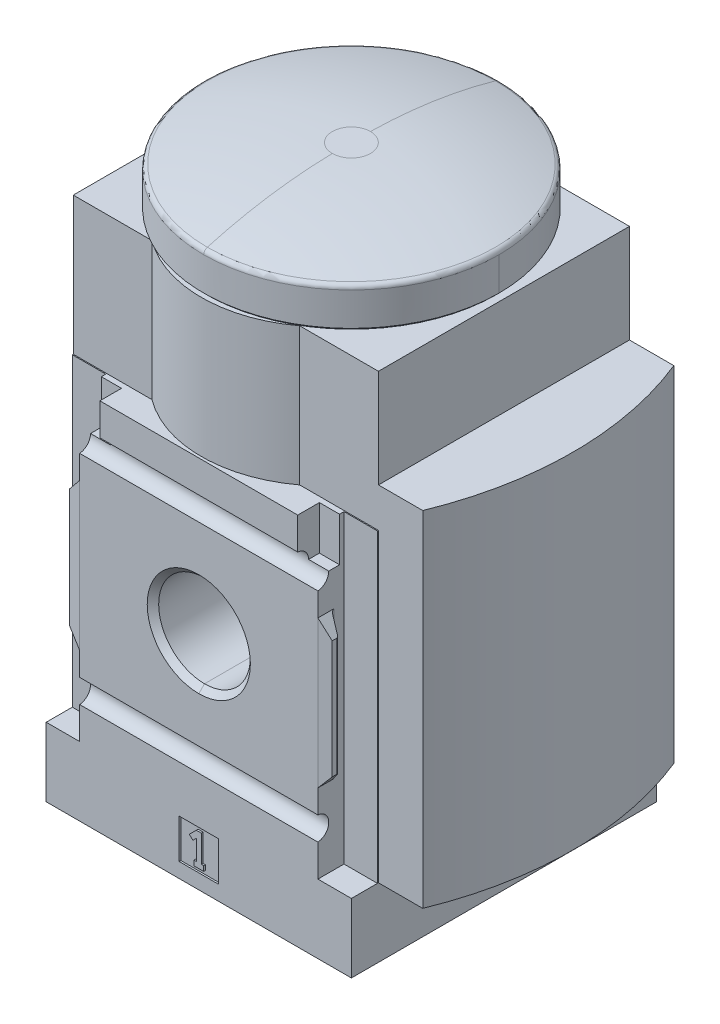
ISO-10303-21;
HEADER;
FILE_DESCRIPTION(('STEP AP214'),'2;1');
FILE_NAME('part.step','',(''),(''),'','','');
FILE_SCHEMA(('AUTOMOTIVE_DESIGN { 1 0 10303 214 1 1 1 1 }'));
ENDSEC;
DATA;
#1=APPLICATION_CONTEXT('core data for automotive mechanical design processes');
#2=APPLICATION_PROTOCOL_DEFINITION('international standard','automotive_design',2000,#1);
#3=PRODUCT_CONTEXT('',#1,'mechanical');
#4=PRODUCT('Part','Part','',(#3));
#5=PRODUCT_RELATED_PRODUCT_CATEGORY('part','',(#4));
#6=PRODUCT_DEFINITION_FORMATION('','',#4);
#7=PRODUCT_DEFINITION_CONTEXT('part definition',#1,'design');
#8=PRODUCT_DEFINITION('design','',#6,#7);
#9=PRODUCT_DEFINITION_SHAPE('','',#8);
#10=(LENGTH_UNIT() NAMED_UNIT(*) SI_UNIT(.MILLI.,.METRE.));
#11=(NAMED_UNIT(*) PLANE_ANGLE_UNIT() SI_UNIT($,.RADIAN.));
#12=(NAMED_UNIT(*) SI_UNIT($,.STERADIAN.) SOLID_ANGLE_UNIT());
#13=UNCERTAINTY_MEASURE_WITH_UNIT(LENGTH_MEASURE(1.E-05),#10,'distance_accuracy_value','');
#14=(GEOMETRIC_REPRESENTATION_CONTEXT(3) GLOBAL_UNCERTAINTY_ASSIGNED_CONTEXT((#13)) GLOBAL_UNIT_ASSIGNED_CONTEXT((#10,
#11,#12)) REPRESENTATION_CONTEXT('',''));
#15=CARTESIAN_POINT('',(0.,0.,0.));
#16=DIRECTION('',(0.,0.,1.));
#17=DIRECTION('',(1.,0.,0.));
#18=AXIS2_PLACEMENT_3D('',#15,#16,#17);
#19=CARTESIAN_POINT('',(0.,5.23875,10.045));
#20=DIRECTION('',(0.,0.,-1.));
#21=DIRECTION('',(-1.,0.,0.));
#22=AXIS2_PLACEMENT_3D('',#19,#20,#21);
#23=PLANE('',#22);
#24=CARTESIAN_POINT('',(0.,0.,10.045));
#25=DIRECTION('',(0.,0.,-1.));
#26=DIRECTION('',(-1.,0.,0.));
#27=AXIS2_PLACEMENT_3D('',#24,#25,#26);
#28=CIRCLE('',#27,10.4775);
#29=CARTESIAN_POINT('',(0.,-10.4775,10.045));
#30=VERTEX_POINT('',#29);
#31=CARTESIAN_POINT('',(0.,10.4775,10.045));
#32=VERTEX_POINT('',#31);
#33=EDGE_CURVE('E19',#30,#32,#28,.F.);
#34=ORIENTED_EDGE('',*,*,#33,.T.);
#35=CARTESIAN_POINT('',(0.,0.,10.045));
#36=DIRECTION('',(0.,0.,-1.));
#37=DIRECTION('',(-1.,0.,0.));
#38=AXIS2_PLACEMENT_3D('',#35,#36,#37);
#39=CIRCLE('',#38,10.4775);
#40=EDGE_CURVE('E692',#32,#30,#39,.F.);
#41=ORIENTED_EDGE('',*,*,#40,.T.);
#42=EDGE_LOOP('',(#34,#41));
#43=FACE_BOUND('',#42,.T.);
#44=ADVANCED_FACE('F16',(#43),#23,.F.);
#45=CARTESIAN_POINT('',(0.,5.23875,-10.045));
#46=DIRECTION('',(0.,0.,1.));
#47=DIRECTION('',(1.,0.,0.));
#48=AXIS2_PLACEMENT_3D('',#45,#46,#47);
#49=PLANE('',#48);
#50=CARTESIAN_POINT('',(0.,0.,-10.045));
#51=DIRECTION('',(0.,0.,1.));
#52=DIRECTION('',(1.,0.,0.));
#53=AXIS2_PLACEMENT_3D('',#50,#51,#52);
#54=CIRCLE('',#53,10.4775);
#55=CARTESIAN_POINT('',(0.,10.4775,-10.045));
#56=VERTEX_POINT('',#55);
#57=CARTESIAN_POINT('',(0.,-10.4775,-10.045));
#58=VERTEX_POINT('',#57);
#59=EDGE_CURVE('E707',#56,#58,#54,.F.);
#60=ORIENTED_EDGE('',*,*,#59,.T.);
#61=CARTESIAN_POINT('',(0.,0.,-10.045));
#62=DIRECTION('',(0.,0.,1.));
#63=DIRECTION('',(1.,0.,0.));
#64=AXIS2_PLACEMENT_3D('',#61,#62,#63);
#65=CIRCLE('',#64,10.4775);
#66=EDGE_CURVE('E721',#58,#56,#65,.F.);
#67=ORIENTED_EDGE('',*,*,#66,.T.);
#68=EDGE_LOOP('',(#60,#67));
#69=FACE_BOUND('',#68,.T.);
#70=ADVANCED_FACE('F2647',(#69),#49,.F.);
#71=CARTESIAN_POINT('',(0.,0.,10.045));
#72=DIRECTION('',(0.,0.,-1.));
#73=DIRECTION('',(-1.,0.,0.));
#74=AXIS2_PLACEMENT_3D('',#71,#72,#73);
#75=CONICAL_SURFACE('',#74,10.4775,0.785398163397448);
#76=ORIENTED_EDGE('',*,*,#33,.F.);
#77=DIRECTION('',(0.,0.707106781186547,0.707106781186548));
#78=VECTOR('',#77,1.);
#79=CARTESIAN_POINT('',(0.,-9.8965,10.626));
#80=LINE('',#79,#78);
#81=CARTESIAN_POINT('',(0.,-9.3155,11.207));
#82=VERTEX_POINT('',#81);
#83=EDGE_CURVE('E708',#30,#82,#80,.T.);
#84=ORIENTED_EDGE('',*,*,#83,.T.);
#85=CARTESIAN_POINT('',(0.,0.,11.207));
#86=DIRECTION('',(0.,0.,-1.));
#87=DIRECTION('',(-1.,0.,0.));
#88=AXIS2_PLACEMENT_3D('',#85,#86,#87);
#89=CIRCLE('',#88,9.3155);
#90=CARTESIAN_POINT('',(0.,9.3155,11.207));
#91=VERTEX_POINT('',#90);
#92=EDGE_CURVE('E702',#82,#91,#89,.F.);
#93=ORIENTED_EDGE('',*,*,#92,.T.);
#94=DIRECTION('',(0.,-0.707106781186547,0.707106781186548));
#95=VECTOR('',#94,1.);
#96=CARTESIAN_POINT('',(0.,9.8965,10.626));
#97=LINE('',#96,#95);
#98=EDGE_CURVE('E699',#91,#32,#97,.F.);
#99=ORIENTED_EDGE('',*,*,#98,.T.);
#100=EDGE_LOOP('',(#76,#84,#93,#99));
#101=FACE_BOUND('',#100,.T.);
#102=ADVANCED_FACE('F700',(#101),#75,.F.);
#103=CARTESIAN_POINT('',(0.,0.,10.045));
#104=DIRECTION('',(0.,0.,-1.));
#105=DIRECTION('',(-1.,0.,0.));
#106=AXIS2_PLACEMENT_3D('',#103,#104,#105);
#107=CONICAL_SURFACE('',#106,10.4775,0.785398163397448);
#108=CARTESIAN_POINT('',(0.,0.,11.207));
#109=DIRECTION('',(0.,0.,-1.));
#110=DIRECTION('',(-1.,0.,0.));
#111=AXIS2_PLACEMENT_3D('',#108,#109,#110);
#112=CIRCLE('',#111,9.3155);
#113=EDGE_CURVE('E1047',#91,#82,#112,.F.);
#114=ORIENTED_EDGE('',*,*,#113,.T.);
#115=ORIENTED_EDGE('',*,*,#83,.F.);
#116=ORIENTED_EDGE('',*,*,#40,.F.);
#117=ORIENTED_EDGE('',*,*,#98,.F.);
#118=EDGE_LOOP('',(#114,#115,#116,#117));
#119=FACE_BOUND('',#118,.T.);
#120=ADVANCED_FACE('F710',(#119),#107,.F.);
#121=CARTESIAN_POINT('',(1.93583186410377,71.,0.));
#122=DIRECTION('',(0.,1.,0.));
#123=DIRECTION('',(0.,0.,1.));
#124=AXIS2_PLACEMENT_3D('',#121,#122,#123);
#125=PLANE('',#124);
#126=CARTESIAN_POINT('',(0.,71.0000000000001,0.));
#127=DIRECTION('',(0.,-1.,0.));
#128=DIRECTION('',(0.,0.,1.));
#129=AXIS2_PLACEMENT_3D('',#126,#127,#128);
#130=CIRCLE('',#129,3.87166372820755);
#131=CARTESIAN_POINT('',(0.,71.0000000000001,3.87166372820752));
#132=VERTEX_POINT('',#131);
#133=CARTESIAN_POINT('',(0.,71.0000000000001,-3.87166372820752));
#134=VERTEX_POINT('',#133);
#135=EDGE_CURVE('E1121',#132,#134,#130,.T.);
#136=ORIENTED_EDGE('',*,*,#135,.F.);
#137=CARTESIAN_POINT('',(0.,71.0000000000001,0.));
#138=DIRECTION('',(0.,-1.,0.));
#139=DIRECTION('',(1.,0.,0.));
#140=AXIS2_PLACEMENT_3D('',#137,#138,#139);
#141=CIRCLE('',#140,3.87166372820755);
#142=CARTESIAN_POINT('',(3.87166372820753,71.0000000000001,0.));
#143=VERTEX_POINT('',#142);
#144=EDGE_CURVE('E752',#143,#132,#141,.T.);
#145=ORIENTED_EDGE('',*,*,#144,.F.);
#146=CARTESIAN_POINT('',(0.,71.0000000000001,0.));
#147=DIRECTION('',(0.,-1.,0.));
#148=DIRECTION('',(0.,0.,-1.));
#149=AXIS2_PLACEMENT_3D('',#146,#147,#148);
#150=CIRCLE('',#149,3.87166372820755);
#151=EDGE_CURVE('E1095',#134,#143,#150,.T.);
#152=ORIENTED_EDGE('',*,*,#151,.F.);
#153=EDGE_LOOP('',(#136,#145,#152));
#154=FACE_BOUND('',#153,.T.);
#155=ADVANCED_FACE('F1220',(#154),#125,.T.);
#156=CARTESIAN_POINT('',(0.,0.,-10.045));
#157=DIRECTION('',(0.,0.,1.));
#158=DIRECTION('',(1.,0.,0.));
#159=AXIS2_PLACEMENT_3D('',#156,#157,#158);
#160=CONICAL_SURFACE('',#159,10.4775,0.785398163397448);
#161=CARTESIAN_POINT('',(0.,0.,-11.207));
#162=DIRECTION('',(0.,0.,-1.));
#163=DIRECTION('',(-1.,0.,0.));
#164=AXIS2_PLACEMENT_3D('',#161,#162,#163);
#165=CIRCLE('',#164,9.3155);
#166=CARTESIAN_POINT('',(0.,9.3155,-11.207));
#167=VERTEX_POINT('',#166);
#168=CARTESIAN_POINT('',(0.,-9.3155,-11.207));
#169=VERTEX_POINT('',#168);
#170=EDGE_CURVE('E1178',#167,#169,#165,.T.);
#171=ORIENTED_EDGE('',*,*,#170,.T.);
#172=DIRECTION('',(0.,0.707106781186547,-0.707106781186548));
#173=VECTOR('',#172,1.);
#174=CARTESIAN_POINT('',(0.,-9.8965,-10.626));
#175=LINE('',#174,#173);
#176=EDGE_CURVE('E720',#169,#58,#175,.F.);
#177=ORIENTED_EDGE('',*,*,#176,.T.);
#178=ORIENTED_EDGE('',*,*,#59,.F.);
#179=DIRECTION('',(0.,-0.707106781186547,-0.707106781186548));
#180=VECTOR('',#179,1.);
#181=CARTESIAN_POINT('',(0.,9.8965,-10.626));
#182=LINE('',#181,#180);
#183=EDGE_CURVE('E723',#56,#167,#182,.T.);
#184=ORIENTED_EDGE('',*,*,#183,.T.);
#185=EDGE_LOOP('',(#171,#177,#178,#184));
#186=FACE_BOUND('',#185,.T.);
#187=ADVANCED_FACE('F1230',(#186),#160,.F.);
#188=CARTESIAN_POINT('',(0.,0.,-10.045));
#189=DIRECTION('',(0.,0.,1.));
#190=DIRECTION('',(1.,0.,0.));
#191=AXIS2_PLACEMENT_3D('',#188,#189,#190);
#192=CONICAL_SURFACE('',#191,10.4775,0.785398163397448);
#193=ORIENTED_EDGE('',*,*,#66,.F.);
#194=ORIENTED_EDGE('',*,*,#176,.F.);
#195=CARTESIAN_POINT('',(0.,0.,-11.207));
#196=DIRECTION('',(0.,0.,-1.));
#197=DIRECTION('',(-1.,0.,0.));
#198=AXIS2_PLACEMENT_3D('',#195,#196,#197);
#199=CIRCLE('',#198,9.3155);
#200=EDGE_CURVE('E1185',#169,#167,#199,.T.);
#201=ORIENTED_EDGE('',*,*,#200,.T.);
#202=ORIENTED_EDGE('',*,*,#183,.F.);
#203=EDGE_LOOP('',(#193,#194,#201,#202));
#204=FACE_BOUND('',#203,.T.);
#205=ADVANCED_FACE('F2634',(#204),#192,.F.);
#206=CARTESIAN_POINT('',(26.2,31.,-29.7317661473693));
#207=DIRECTION('',(0.,1.,0.));
#208=DIRECTION('',(0.,0.,1.));
#209=AXIS2_PLACEMENT_3D('',#206,#207,#208);
#210=CYLINDRICAL_SURFACE('',#209,0.499999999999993);
#211=CARTESIAN_POINT('',(26.2,12.5664928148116,-29.7317661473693));
#212=DIRECTION('',(-0.766044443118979,-0.642787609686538,0.));
#213=DIRECTION('',(-0.642787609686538,0.766044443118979,0.));
#214=AXIS2_PLACEMENT_3D('',#211,#212,#213);
#215=ELLIPSE('',#214,0.777861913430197,0.499999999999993);
#216=CARTESIAN_POINT('',(26.7,11.9706160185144,-29.7317661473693));
#217=VERTEX_POINT('',#216);
#218=CARTESIAN_POINT('',(26.4191855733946,12.3052776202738,-29.2823691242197));
#219=VERTEX_POINT('',#218);
#220=EDGE_CURVE('E728',#217,#219,#215,.T.);
#221=ORIENTED_EDGE('',*,*,#220,.T.);
#222=DIRECTION('',(0.,1.,0.));
#223=VECTOR('',#222,1.);
#224=CARTESIAN_POINT('',(26.4191855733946,31.,-29.2823691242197));
#225=LINE('',#224,#223);
#226=CARTESIAN_POINT('',(26.4191855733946,-12.3052776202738,-29.2823691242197));
#227=VERTEX_POINT('',#226);
#228=EDGE_CURVE('E1148',#219,#227,#225,.F.);
#229=ORIENTED_EDGE('',*,*,#228,.T.);
#230=CARTESIAN_POINT('',(26.2,-12.5664928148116,-29.7317661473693));
#231=DIRECTION('',(-0.766044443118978,0.642787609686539,0.));
#232=DIRECTION('',(0.642787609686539,0.766044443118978,0.));
#233=AXIS2_PLACEMENT_3D('',#230,#231,#232);
#234=ELLIPSE('',#233,0.777861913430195,0.499999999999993);
#235=CARTESIAN_POINT('',(26.7,-11.9706160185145,-29.7317661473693));
#236=VERTEX_POINT('',#235);
#237=EDGE_CURVE('E724',#227,#236,#234,.T.);
#238=ORIENTED_EDGE('',*,*,#237,.T.);
#239=DIRECTION('',(0.,1.,0.));
#240=VECTOR('',#239,1.);
#241=CARTESIAN_POINT('',(26.7,11.9706160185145,-29.7317661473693));
#242=LINE('',#241,#240);
#243=EDGE_CURVE('E1206',#236,#217,#242,.T.);
#244=ORIENTED_EDGE('',*,*,#243,.T.);
#245=EDGE_LOOP('',(#221,#229,#238,#244));
#246=FACE_BOUND('',#245,.T.);
#247=ADVANCED_FACE('F2631',(#246),#210,.T.);
#248=CARTESIAN_POINT('',(0.,0.,-31.));
#249=DIRECTION('',(0.,0.,1.));
#250=DIRECTION('',(1.,0.,0.));
#251=AXIS2_PLACEMENT_3D('',#248,#249,#250);
#252=PLANE('',#251);
#253=CARTESIAN_POINT('',(0.587127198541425,-40.15,-31.));
#254=DIRECTION('',(0.,0.,1.));
#255=DIRECTION('',(1.,0.,0.));
#256=AXIS2_PLACEMENT_3D('',#253,#254,#255);
#257=CIRCLE('',#256,0.100000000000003);
#258=CARTESIAN_POINT('',(0.587127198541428,-40.25,-31.));
#259=VERTEX_POINT('',#258);
#260=CARTESIAN_POINT('',(0.669042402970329,-40.0926423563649,-31.));
#261=VERTEX_POINT('',#260);
#262=EDGE_CURVE('E756',#259,#261,#257,.T.);
#263=ORIENTED_EDGE('',*,*,#262,.T.);
#264=DIRECTION('',(-0.573576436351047,0.819152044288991,0.));
#265=VECTOR('',#264,1.);
#266=CARTESIAN_POINT('',(0.669042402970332,-40.0926423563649,-31.));
#267=LINE('',#266,#265);
#268=CARTESIAN_POINT('',(-1.63953694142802,-36.7956493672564,-31.));
#269=VERTEX_POINT('',#268);
#270=EDGE_CURVE('E766',#261,#269,#267,.T.);
#271=ORIENTED_EDGE('',*,*,#270,.T.);
#272=CARTESIAN_POINT('',(-0.574639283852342,-36.05,-31.));
#273=DIRECTION('',(0.,0.,1.));
#274=DIRECTION('',(1.,0.,0.));
#275=AXIS2_PLACEMENT_3D('',#272,#273,#274);
#276=CIRCLE('',#275,1.3);
#277=CARTESIAN_POINT('',(-0.57463928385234,-34.75,-31.));
#278=VERTEX_POINT('',#277);
#279=EDGE_CURVE('E761',#278,#269,#276,.T.);
#280=ORIENTED_EDGE('',*,*,#279,.F.);
#281=DIRECTION('',(1.,0.,0.));
#282=VECTOR('',#281,1.);
#283=CARTESIAN_POINT('',(-0.574639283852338,-34.75,-31.));
#284=LINE('',#283,#282);
#285=CARTESIAN_POINT('',(0.500000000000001,-34.75,-31.));
#286=VERTEX_POINT('',#285);
#287=EDGE_CURVE('E772',#278,#286,#284,.T.);
#288=ORIENTED_EDGE('',*,*,#287,.T.);
#289=CARTESIAN_POINT('',(0.500000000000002,-36.25,-31.));
#290=DIRECTION('',(0.,0.,1.));
#291=DIRECTION('',(1.,0.,0.));
#292=AXIS2_PLACEMENT_3D('',#289,#290,#291);
#293=CIRCLE('',#292,1.5);
#294=CARTESIAN_POINT('',(2.,-36.25,-31.));
#295=VERTEX_POINT('',#294);
#296=EDGE_CURVE('E767',#295,#286,#293,.T.);
#297=ORIENTED_EDGE('',*,*,#296,.F.);
#298=DIRECTION('',(-0.98058067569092,-0.196116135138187,0.));
#299=VECTOR('',#298,1.);
#300=CARTESIAN_POINT('',(2.,-36.25,-31.));
#301=LINE('',#300,#299);
#302=CARTESIAN_POINT('',(1.,-36.45,-31.));
#303=VERTEX_POINT('',#302);
#304=EDGE_CURVE('E1165',#295,#303,#301,.T.);
#305=ORIENTED_EDGE('',*,*,#304,.T.);
#306=CARTESIAN_POINT('',(0.3,-36.45,-31.));
#307=DIRECTION('',(0.,0.,1.));
#308=DIRECTION('',(1.,0.,0.));
#309=AXIS2_PLACEMENT_3D('',#306,#307,#308);
#310=CIRCLE('',#309,0.700000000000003);
#311=CARTESIAN_POINT('',(0.3,-35.75,-31.));
#312=VERTEX_POINT('',#311);
#313=EDGE_CURVE('E773',#303,#312,#310,.T.);
#314=ORIENTED_EDGE('',*,*,#313,.T.);
#315=DIRECTION('',(1.,0.,0.));
#316=VECTOR('',#315,1.);
#317=CARTESIAN_POINT('',(0.3,-35.75,-31.));
#318=LINE('',#317,#316);
#319=CARTESIAN_POINT('',(-0.190442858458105,-35.75,-31.));
#320=VERTEX_POINT('',#319);
#321=EDGE_CURVE('E1162',#312,#320,#318,.F.);
#322=ORIENTED_EDGE('',*,*,#321,.T.);
#323=CARTESIAN_POINT('',(-0.190442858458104,-36.25,-31.));
#324=DIRECTION('',(0.,0.,1.));
#325=DIRECTION('',(1.,0.,0.));
#326=AXIS2_PLACEMENT_3D('',#323,#324,#325);
#327=CIRCLE('',#326,0.500000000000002);
#328=CARTESIAN_POINT('',(-0.600018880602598,-36.5367882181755,-31.));
#329=VERTEX_POINT('',#328);
#330=EDGE_CURVE('E778',#320,#329,#327,.T.);
#331=ORIENTED_EDGE('',*,*,#330,.T.);
#332=DIRECTION('',(0.573576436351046,-0.819152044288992,0.));
#333=VECTOR('',#332,1.);
#334=CARTESIAN_POINT('',(-0.600018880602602,-36.5367882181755,-31.));
#335=LINE('',#334,#333);
#336=CARTESIAN_POINT('',(2.,-40.25,-31.));
#337=VERTEX_POINT('',#336);
#338=EDGE_CURVE('E1151',#329,#337,#335,.T.);
#339=ORIENTED_EDGE('',*,*,#338,.T.);
#340=DIRECTION('',(0.,1.,0.));
#341=VECTOR('',#340,1.);
#342=CARTESIAN_POINT('',(2.,-40.25,-31.));
#343=LINE('',#342,#341);
#344=CARTESIAN_POINT('',(2.,-41.25,-31.));
#345=VERTEX_POINT('',#344);
#346=EDGE_CURVE('E1157',#337,#345,#343,.F.);
#347=ORIENTED_EDGE('',*,*,#346,.T.);
#348=DIRECTION('',(1.,0.,0.));
#349=VECTOR('',#348,1.);
#350=CARTESIAN_POINT('',(2.,-41.25,-31.));
#351=LINE('',#350,#349);
#352=CARTESIAN_POINT('',(-2.,-41.25,-31.));
#353=VERTEX_POINT('',#352);
#354=EDGE_CURVE('E1026',#345,#353,#351,.F.);
#355=ORIENTED_EDGE('',*,*,#354,.T.);
#356=DIRECTION('',(0.,1.,0.));
#357=VECTOR('',#356,1.);
#358=CARTESIAN_POINT('',(-2.,0.,-31.));
#359=LINE('',#358,#357);
#360=CARTESIAN_POINT('',(-2.,-40.25,-31.));
#361=VERTEX_POINT('',#360);
#362=EDGE_CURVE('E731',#361,#353,#359,.F.);
#363=ORIENTED_EDGE('',*,*,#362,.F.);
#364=DIRECTION('',(1.,0.,0.));
#365=VECTOR('',#364,1.);
#366=CARTESIAN_POINT('',(-2.,-40.25,-31.));
#367=LINE('',#366,#365);
#368=EDGE_CURVE('E1145',#361,#259,#367,.T.);
#369=ORIENTED_EDGE('',*,*,#368,.T.);
#370=EDGE_LOOP('',(#263,#271,#280,#288,#297,#305,#314,#322,#331,#339,#347,#355,#363,#369));
#371=FACE_BOUND('',#370,.T.);
#372=ADVANCED_FACE('F2624',(#371),#252,.F.);
#373=CARTESIAN_POINT('',(26.2,31.,29.7317661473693));
#374=DIRECTION('',(0.,1.,0.));
#375=DIRECTION('',(0.,0.,1.));
#376=AXIS2_PLACEMENT_3D('',#373,#374,#375);
#377=CYLINDRICAL_SURFACE('',#376,0.500000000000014);
#378=CARTESIAN_POINT('',(26.2,12.5664928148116,29.7317661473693));
#379=DIRECTION('',(-0.766044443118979,-0.642787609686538,0.));
#380=DIRECTION('',(-0.642787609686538,0.766044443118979,0.));
#381=AXIS2_PLACEMENT_3D('',#378,#379,#380);
#382=ELLIPSE('',#381,0.777861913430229,0.500000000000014);
#383=CARTESIAN_POINT('',(26.4191855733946,12.3052776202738,29.2823691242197));
#384=VERTEX_POINT('',#383);
#385=CARTESIAN_POINT('',(26.7,11.9706160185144,29.7317661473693));
#386=VERTEX_POINT('',#385);
#387=EDGE_CURVE('E735',#384,#386,#382,.T.);
#388=ORIENTED_EDGE('',*,*,#387,.T.);
#389=DIRECTION('',(0.,1.,0.));
#390=VECTOR('',#389,1.);
#391=CARTESIAN_POINT('',(26.7,11.9706160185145,29.7317661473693));
#392=LINE('',#391,#390);
#393=CARTESIAN_POINT('',(26.7,-11.9706160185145,29.7317661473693));
#394=VERTEX_POINT('',#393);
#395=EDGE_CURVE('E1036',#386,#394,#392,.F.);
#396=ORIENTED_EDGE('',*,*,#395,.T.);
#397=CARTESIAN_POINT('',(26.2,-12.5664928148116,29.7317661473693));
#398=DIRECTION('',(-0.766044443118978,0.642787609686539,0.));
#399=DIRECTION('',(0.642787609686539,0.766044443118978,0.));
#400=AXIS2_PLACEMENT_3D('',#397,#398,#399);
#401=ELLIPSE('',#400,0.777861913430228,0.500000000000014);
#402=CARTESIAN_POINT('',(26.4191855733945,-12.3052776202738,29.2823691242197));
#403=VERTEX_POINT('',#402);
#404=EDGE_CURVE('E732',#394,#403,#401,.T.);
#405=ORIENTED_EDGE('',*,*,#404,.T.);
#406=DIRECTION('',(0.,1.,0.));
#407=VECTOR('',#406,1.);
#408=CARTESIAN_POINT('',(26.4191855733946,31.,29.2823691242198));
#409=LINE('',#408,#407);
#410=EDGE_CURVE('E1022',#403,#384,#409,.T.);
#411=ORIENTED_EDGE('',*,*,#410,.T.);
#412=EDGE_LOOP('',(#388,#396,#405,#411));
#413=FACE_BOUND('',#412,.T.);
#414=ADVANCED_FACE('F2616',(#413),#377,.T.);
#415=CARTESIAN_POINT('',(0.,0.,31.));
#416=DIRECTION('',(0.,0.,1.));
#417=DIRECTION('',(1.,0.,0.));
#418=AXIS2_PLACEMENT_3D('',#415,#416,#417);
#419=PLANE('',#418);
#420=DIRECTION('',(1.,0.,0.));
#421=VECTOR('',#420,1.);
#422=CARTESIAN_POINT('',(0.5,-40.25,31.));
#423=LINE('',#422,#421);
#424=CARTESIAN_POINT('',(1.,-40.25,31.));
#425=VERTEX_POINT('',#424);
#426=CARTESIAN_POINT('',(0.5,-40.25,31.));
#427=VERTEX_POINT('',#426);
#428=EDGE_CURVE('E1536',#425,#427,#423,.F.);
#429=ORIENTED_EDGE('',*,*,#428,.T.);
#430=DIRECTION('',(0.,1.,0.));
#431=VECTOR('',#430,1.);
#432=CARTESIAN_POINT('',(0.5,-34.75,31.));
#433=LINE('',#432,#431);
#434=CARTESIAN_POINT('',(0.5,-34.75,31.));
#435=VERTEX_POINT('',#434);
#436=EDGE_CURVE('E1546',#427,#435,#433,.T.);
#437=ORIENTED_EDGE('',*,*,#436,.T.);
#438=DIRECTION('',(1.,0.,0.));
#439=VECTOR('',#438,1.);
#440=CARTESIAN_POINT('',(-0.5,-34.75,31.));
#441=LINE('',#440,#439);
#442=CARTESIAN_POINT('',(-0.5,-34.75,31.));
#443=VERTEX_POINT('',#442);
#444=EDGE_CURVE('E1554',#435,#443,#441,.F.);
#445=ORIENTED_EDGE('',*,*,#444,.T.);
#446=DIRECTION('',(0.707106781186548,0.707106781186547,0.));
#447=VECTOR('',#446,1.);
#448=CARTESIAN_POINT('',(-1.9142135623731,-36.1642135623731,31.));
#449=LINE('',#448,#447);
#450=CARTESIAN_POINT('',(-1.91421356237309,-36.1642135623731,31.));
#451=VERTEX_POINT('',#450);
#452=EDGE_CURVE('E1715',#443,#451,#449,.F.);
#453=ORIENTED_EDGE('',*,*,#452,.T.);
#454=DIRECTION('',(-0.707106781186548,0.707106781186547,0.));
#455=VECTOR('',#454,1.);
#456=CARTESIAN_POINT('',(-1.20710678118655,-36.8713203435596,31.));
#457=LINE('',#456,#455);
#458=CARTESIAN_POINT('',(-1.20710678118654,-36.8713203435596,31.));
#459=VERTEX_POINT('',#458);
#460=EDGE_CURVE('E1402',#451,#459,#457,.F.);
#461=ORIENTED_EDGE('',*,*,#460,.T.);
#462=DIRECTION('',(-0.707106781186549,-0.707106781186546,0.));
#463=VECTOR('',#462,1.);
#464=CARTESIAN_POINT('',(-0.5,-36.1642135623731,31.));
#465=LINE('',#464,#463);
#466=CARTESIAN_POINT('',(-0.5,-36.1642135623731,31.));
#467=VERTEX_POINT('',#466);
#468=EDGE_CURVE('E1340',#459,#467,#465,.F.);
#469=ORIENTED_EDGE('',*,*,#468,.T.);
#470=DIRECTION('',(0.,1.,0.));
#471=VECTOR('',#470,1.);
#472=CARTESIAN_POINT('',(-0.5,-40.25,31.));
#473=LINE('',#472,#471);
#474=CARTESIAN_POINT('',(-0.5,-40.25,31.));
#475=VERTEX_POINT('',#474);
#476=EDGE_CURVE('E1341',#467,#475,#473,.F.);
#477=ORIENTED_EDGE('',*,*,#476,.T.);
#478=DIRECTION('',(1.,0.,0.));
#479=VECTOR('',#478,1.);
#480=CARTESIAN_POINT('',(-1.,-40.25,31.));
#481=LINE('',#480,#479);
#482=CARTESIAN_POINT('',(-1.,-40.25,31.));
#483=VERTEX_POINT('',#482);
#484=EDGE_CURVE('E1733',#475,#483,#481,.F.);
#485=ORIENTED_EDGE('',*,*,#484,.T.);
#486=DIRECTION('',(0.,1.,0.));
#487=VECTOR('',#486,1.);
#488=CARTESIAN_POINT('',(-1.,-41.25,31.));
#489=LINE('',#488,#487);
#490=CARTESIAN_POINT('',(-1.,-41.25,31.));
#491=VERTEX_POINT('',#490);
#492=EDGE_CURVE('E1739',#483,#491,#489,.F.);
#493=ORIENTED_EDGE('',*,*,#492,.T.);
#494=DIRECTION('',(1.,0.,0.));
#495=VECTOR('',#494,1.);
#496=CARTESIAN_POINT('',(1.,-41.25,31.));
#497=LINE('',#496,#495);
#498=CARTESIAN_POINT('',(1.,-41.25,31.));
#499=VERTEX_POINT('',#498);
#500=EDGE_CURVE('E1746',#491,#499,#497,.T.);
#501=ORIENTED_EDGE('',*,*,#500,.T.);
#502=DIRECTION('',(0.,1.,0.));
#503=VECTOR('',#502,1.);
#504=CARTESIAN_POINT('',(1.,-40.25,31.));
#505=LINE('',#504,#503);
#506=EDGE_CURVE('E1470',#499,#425,#505,.T.);
#507=ORIENTED_EDGE('',*,*,#506,.T.);
#508=EDGE_LOOP('',(#429,#437,#445,#453,#461,#469,#477,#485,#493,#501,#507));
#509=FACE_BOUND('',#508,.T.);
#510=ADVANCED_FACE('F2613',(#509),#419,.T.);
#511=CARTESIAN_POINT('',(-26.2,31.,29.7317661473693));
#512=DIRECTION('',(0.,1.,0.));
#513=DIRECTION('',(0.,0.,1.));
#514=AXIS2_PLACEMENT_3D('',#511,#512,#513);
#515=CYLINDRICAL_SURFACE('',#514,0.500000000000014);
#516=CARTESIAN_POINT('',(-26.2,-12.5664928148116,29.7317661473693));
#517=DIRECTION('',(0.766044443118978,0.642787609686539,0.));
#518=DIRECTION('',(-0.642787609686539,0.766044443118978,0.));
#519=AXIS2_PLACEMENT_3D('',#516,#517,#518);
#520=ELLIPSE('',#519,0.777861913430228,0.500000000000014);
#521=CARTESIAN_POINT('',(-26.4191855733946,-12.3052776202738,29.2823691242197));
#522=VERTEX_POINT('',#521);
#523=CARTESIAN_POINT('',(-26.7,-11.9706160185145,29.7317661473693));
#524=VERTEX_POINT('',#523);
#525=EDGE_CURVE('E742',#522,#524,#520,.T.);
#526=ORIENTED_EDGE('',*,*,#525,.T.);
#527=DIRECTION('',(0.,1.,0.));
#528=VECTOR('',#527,1.);
#529=CARTESIAN_POINT('',(-26.7,-11.9706160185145,29.7317661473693));
#530=LINE('',#529,#528);
#531=CARTESIAN_POINT('',(-26.7,11.9706160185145,29.7317661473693));
#532=VERTEX_POINT('',#531);
#533=EDGE_CURVE('E1031',#524,#532,#530,.T.);
#534=ORIENTED_EDGE('',*,*,#533,.T.);
#535=CARTESIAN_POINT('',(-26.2,12.5664928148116,29.7317661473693));
#536=DIRECTION('',(0.76604444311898,-0.642787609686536,0.));
#537=DIRECTION('',(0.642787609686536,0.76604444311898,0.));
#538=AXIS2_PLACEMENT_3D('',#535,#536,#537);
#539=ELLIPSE('',#538,0.777861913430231,0.500000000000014);
#540=CARTESIAN_POINT('',(-26.4191855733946,12.3052776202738,29.2823691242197));
#541=VERTEX_POINT('',#540);
#542=EDGE_CURVE('E739',#532,#541,#539,.T.);
#543=ORIENTED_EDGE('',*,*,#542,.T.);
#544=DIRECTION('',(0.,1.,0.));
#545=VECTOR('',#544,1.);
#546=CARTESIAN_POINT('',(-26.4191855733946,31.,29.2823691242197));
#547=LINE('',#546,#545);
#548=EDGE_CURVE('E1534',#541,#522,#547,.F.);
#549=ORIENTED_EDGE('',*,*,#548,.T.);
#550=EDGE_LOOP('',(#526,#534,#543,#549));
#551=FACE_BOUND('',#550,.T.);
#552=ADVANCED_FACE('F2615',(#551),#515,.T.);
#553=CARTESIAN_POINT('',(-26.7,-11.9706160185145,36.3));
#554=DIRECTION('',(1.,0.,0.));
#555=DIRECTION('',(0.,0.,-1.));
#556=AXIS2_PLACEMENT_3D('',#553,#554,#555);
#557=PLANE('',#556);
#558=DIRECTION('',(0.,0.,-1.));
#559=VECTOR('',#558,1.);
#560=CARTESIAN_POINT('',(-26.7,11.9706160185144,36.3));
#561=LINE('',#560,#559);
#562=CARTESIAN_POINT('',(-26.7,11.9706160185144,30.6));
#563=VERTEX_POINT('',#562);
#564=EDGE_CURVE('E1035',#532,#563,#561,.F.);
#565=ORIENTED_EDGE('',*,*,#564,.F.);
#566=ORIENTED_EDGE('',*,*,#533,.F.);
#567=DIRECTION('',(0.,0.,-1.));
#568=VECTOR('',#567,1.);
#569=CARTESIAN_POINT('',(-26.7,-11.9706160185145,36.3));
#570=LINE('',#569,#568);
#571=CARTESIAN_POINT('',(-26.7,-11.9706160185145,30.6));
#572=VERTEX_POINT('',#571);
#573=EDGE_CURVE('E746',#572,#524,#570,.T.);
#574=ORIENTED_EDGE('',*,*,#573,.F.);
#575=DIRECTION('',(0.,1.,0.));
#576=VECTOR('',#575,1.);
#577=CARTESIAN_POINT('',(-26.7,31.,30.6));
#578=LINE('',#577,#576);
#579=EDGE_CURVE('E1531',#572,#563,#578,.T.);
#580=ORIENTED_EDGE('',*,*,#579,.T.);
#581=EDGE_LOOP('',(#565,#566,#574,#580));
#582=FACE_BOUND('',#581,.T.);
#583=ADVANCED_FACE('F2621',(#582),#557,.F.);
#584=CARTESIAN_POINT('',(26.7,11.9706160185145,36.3));
#585=DIRECTION('',(-1.,0.,0.));
#586=DIRECTION('',(0.,0.,1.));
#587=AXIS2_PLACEMENT_3D('',#584,#585,#586);
#588=PLANE('',#587);
#589=DIRECTION('',(0.,0.,1.));
#590=VECTOR('',#589,1.);
#591=CARTESIAN_POINT('',(26.7,11.9706160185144,36.3));
#592=LINE('',#591,#590);
#593=CARTESIAN_POINT('',(26.7,11.9706160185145,30.6));
#594=VERTEX_POINT('',#593);
#595=EDGE_CURVE('E1040',#594,#386,#592,.F.);
#596=ORIENTED_EDGE('',*,*,#595,.F.);
#597=DIRECTION('',(0.,1.,0.));
#598=VECTOR('',#597,1.);
#599=CARTESIAN_POINT('',(26.7,31.,30.6));
#600=LINE('',#599,#598);
#601=CARTESIAN_POINT('',(26.7,-11.9706160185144,30.6));
#602=VERTEX_POINT('',#601);
#603=EDGE_CURVE('E1109',#594,#602,#600,.F.);
#604=ORIENTED_EDGE('',*,*,#603,.T.);
#605=DIRECTION('',(0.,0.,1.));
#606=VECTOR('',#605,1.);
#607=CARTESIAN_POINT('',(26.7,-11.9706160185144,36.3));
#608=LINE('',#607,#606);
#609=EDGE_CURVE('E1130',#394,#602,#608,.T.);
#610=ORIENTED_EDGE('',*,*,#609,.F.);
#611=ORIENTED_EDGE('',*,*,#395,.F.);
#612=EDGE_LOOP('',(#596,#604,#610,#611));
#613=FACE_BOUND('',#612,.T.);
#614=ADVANCED_FACE('F3481',(#613),#588,.F.);
#615=CARTESIAN_POINT('',(0.,0.,20.5225));
#616=DIRECTION('',(0.,0.,-1.));
#617=DIRECTION('',(-1.,0.,0.));
#618=AXIS2_PLACEMENT_3D('',#615,#616,#617);
#619=CYLINDRICAL_SURFACE('',#618,9.3155);
#620=ORIENTED_EDGE('',*,*,#92,.F.);
#621=DIRECTION('',(0.,0.,-1.));
#622=VECTOR('',#621,1.);
#623=CARTESIAN_POINT('',(0.,-9.3155,20.5225));
#624=LINE('',#623,#622);
#625=CARTESIAN_POINT('',(0.,-9.3155,29.838));
#626=VERTEX_POINT('',#625);
#627=EDGE_CURVE('E1050',#82,#626,#624,.F.);
#628=ORIENTED_EDGE('',*,*,#627,.T.);
#629=CARTESIAN_POINT('',(0.,0.,29.838));
#630=DIRECTION('',(0.,0.,1.));
#631=DIRECTION('',(0.,1.,0.));
#632=AXIS2_PLACEMENT_3D('',#629,#630,#631);
#633=CIRCLE('',#632,9.3155);
#634=CARTESIAN_POINT('',(0.,9.3155,29.838));
#635=VERTEX_POINT('',#634);
#636=EDGE_CURVE('E1105',#626,#635,#633,.T.);
#637=ORIENTED_EDGE('',*,*,#636,.T.);
#638=DIRECTION('',(0.,0.,-1.));
#639=VECTOR('',#638,1.);
#640=CARTESIAN_POINT('',(0.,9.3155,20.5225));
#641=LINE('',#640,#639);
#642=EDGE_CURVE('E1118',#635,#91,#641,.T.);
#643=ORIENTED_EDGE('',*,*,#642,.T.);
#644=EDGE_LOOP('',(#620,#628,#637,#643));
#645=FACE_BOUND('',#644,.T.);
#646=ADVANCED_FACE('F3473',(#645),#619,.F.);
#647=CARTESIAN_POINT('',(0.,0.,20.5225));
#648=DIRECTION('',(0.,0.,-1.));
#649=DIRECTION('',(-1.,0.,0.));
#650=AXIS2_PLACEMENT_3D('',#647,#648,#649);
#651=CYLINDRICAL_SURFACE('',#650,9.3155);
#652=CARTESIAN_POINT('',(0.,0.,29.838));
#653=DIRECTION('',(0.,0.,1.));
#654=DIRECTION('',(0.,1.,0.));
#655=AXIS2_PLACEMENT_3D('',#652,#653,#654);
#656=CIRCLE('',#655,9.3155);
#657=EDGE_CURVE('E1108',#635,#626,#656,.T.);
#658=ORIENTED_EDGE('',*,*,#657,.T.);
#659=ORIENTED_EDGE('',*,*,#627,.F.);
#660=ORIENTED_EDGE('',*,*,#113,.F.);
#661=ORIENTED_EDGE('',*,*,#642,.F.);
#662=EDGE_LOOP('',(#658,#659,#660,#661));
#663=FACE_BOUND('',#662,.T.);
#664=ADVANCED_FACE('F1072',(#663),#651,.F.);
#665=CARTESIAN_POINT('',(0.,-28.9812610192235,1.93583186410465));
#666=DIRECTION('',(1.,0.,0.));
#667=DIRECTION('',(0.,0.,1.));
#668=AXIS2_PLACEMENT_3D('',#665,#666,#667);
#669=CIRCLE('',#668,100.000000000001);
#670=TRIMMED_CURVE('',#669,(PARAMETER_VALUE(-1.59015585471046)),
(PARAMETER_VALUE(1.59015585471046)),.T.,.PARAMETER.);
#671=CARTESIAN_POINT('',(0.,-28.9812610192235,0.));
#672=DIRECTION('',(0.,1.,0.));
#673=AXIS1_PLACEMENT('',#671,#672);
#674=SURFACE_OF_REVOLUTION('',#670,#673);
#675=CARTESIAN_POINT('',(0.,-28.9812610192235,-1.93583186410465));
#676=DIRECTION('',(-1.,0.,0.));
#677=DIRECTION('',(0.,0.,-1.));
#678=AXIS2_PLACEMENT_3D('',#675,#676,#677);
#679=CIRCLE('',#678,100.000000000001);
#680=CARTESIAN_POINT('',(0.,67.2094802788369,-29.2733754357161));
#681=VERTEX_POINT('',#680);
#682=EDGE_CURVE('E1091',#681,#134,#679,.F.);
#683=ORIENTED_EDGE('',*,*,#682,.F.);
#684=CARTESIAN_POINT('',(0.,67.2094802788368,0.));
#685=DIRECTION('',(0.,1.,0.));
#686=DIRECTION('',(0.,0.,1.));
#687=AXIS2_PLACEMENT_3D('',#684,#685,#686);
#688=CIRCLE('',#687,29.2733754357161);
#689=CARTESIAN_POINT('',(0.,67.2094802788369,29.2733754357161));
#690=VERTEX_POINT('',#689);
#691=EDGE_CURVE('E786',#690,#681,#688,.F.);
#692=ORIENTED_EDGE('',*,*,#691,.F.);
#693=CARTESIAN_POINT('',(0.,-28.9812610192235,1.93583186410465));
#694=DIRECTION('',(1.,0.,0.));
#695=DIRECTION('',(0.,0.,1.));
#696=AXIS2_PLACEMENT_3D('',#693,#694,#695);
#697=CIRCLE('',#696,100.000000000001);
#698=EDGE_CURVE('E1096',#132,#690,#697,.T.);
#699=ORIENTED_EDGE('',*,*,#698,.F.);
#700=ORIENTED_EDGE('',*,*,#135,.T.);
#701=EDGE_LOOP('',(#683,#692,#699,#700));
#702=FACE_BOUND('',#701,.T.);
#703=ADVANCED_FACE('F1060',(#702),#674,.F.);
#704=CARTESIAN_POINT('',(0.,-28.9812610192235,1.93583186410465));
#705=DIRECTION('',(1.,0.,0.));
#706=DIRECTION('',(0.,0.,1.));
#707=AXIS2_PLACEMENT_3D('',#704,#705,#706);
#708=CIRCLE('',#707,100.000000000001);
#709=TRIMMED_CURVE('',#708,(PARAMETER_VALUE(-1.59015585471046)),
(PARAMETER_VALUE(1.59015585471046)),.T.,.PARAMETER.);
#710=CARTESIAN_POINT('',(0.,-28.9812610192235,0.));
#711=DIRECTION('',(0.,1.,0.));
#712=AXIS1_PLACEMENT('',#710,#711);
#713=SURFACE_OF_REVOLUTION('',#709,#712);
#714=ORIENTED_EDGE('',*,*,#151,.T.);
#715=ORIENTED_EDGE('',*,*,#144,.T.);
#716=ORIENTED_EDGE('',*,*,#698,.T.);
#717=CARTESIAN_POINT('',(0.,67.2094802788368,0.));
#718=DIRECTION('',(0.,1.,0.));
#719=DIRECTION('',(0.,0.,1.));
#720=AXIS2_PLACEMENT_3D('',#717,#718,#719);
#721=CIRCLE('',#720,29.2733754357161);
#722=CARTESIAN_POINT('',(29.2733754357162,67.209480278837,0.));
#723=VERTEX_POINT('',#722);
#724=EDGE_CURVE('E1087',#723,#690,#721,.F.);
#725=ORIENTED_EDGE('',*,*,#724,.F.);
#726=CARTESIAN_POINT('',(0.,67.2094802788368,0.));
#727=DIRECTION('',(0.,1.,0.));
#728=DIRECTION('',(0.,0.,1.));
#729=AXIS2_PLACEMENT_3D('',#726,#727,#728);
#730=CIRCLE('',#729,29.2733754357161);
#731=EDGE_CURVE('E1083',#681,#723,#730,.F.);
#732=ORIENTED_EDGE('',*,*,#731,.F.);
#733=ORIENTED_EDGE('',*,*,#682,.T.);
#734=EDGE_LOOP('',(#714,#715,#716,#725,#732,#733));
#735=FACE_BOUND('',#734,.T.);
#736=ADVANCED_FACE('F1071',(#735),#713,.F.);
#737=CARTESIAN_POINT('',(-26.2,31.,-29.7317661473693));
#738=DIRECTION('',(0.,1.,0.));
#739=DIRECTION('',(0.,0.,1.));
#740=AXIS2_PLACEMENT_3D('',#737,#738,#739);
#741=CYLINDRICAL_SURFACE('',#740,0.500000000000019);
#742=CARTESIAN_POINT('',(-26.2,-12.5664928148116,-29.7317661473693));
#743=DIRECTION('',(0.766044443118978,0.642787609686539,0.));
#744=DIRECTION('',(-0.642787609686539,0.766044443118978,0.));
#745=AXIS2_PLACEMENT_3D('',#742,#743,#744);
#746=ELLIPSE('',#745,0.777861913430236,0.500000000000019);
#747=CARTESIAN_POINT('',(-26.7,-11.9706160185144,-29.7317661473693));
#748=VERTEX_POINT('',#747);
#749=CARTESIAN_POINT('',(-26.4191855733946,-12.3052776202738,-29.2823691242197));
#750=VERTEX_POINT('',#749);
#751=EDGE_CURVE('E751',#748,#750,#746,.T.);
#752=ORIENTED_EDGE('',*,*,#751,.T.);
#753=DIRECTION('',(0.,1.,0.));
#754=VECTOR('',#753,1.);
#755=CARTESIAN_POINT('',(-26.4191855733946,31.,-29.2823691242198));
#756=LINE('',#755,#754);
#757=CARTESIAN_POINT('',(-26.4191855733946,12.3052776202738,-29.2823691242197));
#758=VERTEX_POINT('',#757);
#759=EDGE_CURVE('E1419',#750,#758,#756,.T.);
#760=ORIENTED_EDGE('',*,*,#759,.T.);
#761=CARTESIAN_POINT('',(-26.2,12.5664928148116,-29.7317661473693));
#762=DIRECTION('',(0.76604444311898,-0.642787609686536,0.));
#763=DIRECTION('',(0.642787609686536,0.76604444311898,0.));
#764=AXIS2_PLACEMENT_3D('',#761,#762,#763);
#765=ELLIPSE('',#764,0.777861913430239,0.500000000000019);
#766=CARTESIAN_POINT('',(-26.7,11.9706160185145,-29.7317661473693));
#767=VERTEX_POINT('',#766);
#768=EDGE_CURVE('E747',#758,#767,#765,.T.);
#769=ORIENTED_EDGE('',*,*,#768,.T.);
#770=DIRECTION('',(0.,1.,0.));
#771=VECTOR('',#770,1.);
#772=CARTESIAN_POINT('',(-26.7,-11.9706160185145,-29.7317661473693));
#773=LINE('',#772,#771);
#774=EDGE_CURVE('E1201',#767,#748,#773,.F.);
#775=ORIENTED_EDGE('',*,*,#774,.T.);
#776=EDGE_LOOP('',(#752,#760,#769,#775));
#777=FACE_BOUND('',#776,.T.);
#778=ADVANCED_FACE('F2090',(#777),#741,.T.);
#779=CARTESIAN_POINT('',(26.7,11.9706160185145,-25.7));
#780=DIRECTION('',(-1.,0.,0.));
#781=DIRECTION('',(0.,0.,1.));
#782=AXIS2_PLACEMENT_3D('',#779,#780,#781);
#783=PLANE('',#782);
#784=DIRECTION('',(0.,0.,1.));
#785=VECTOR('',#784,1.);
#786=CARTESIAN_POINT('',(26.7,-11.9706160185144,-25.7));
#787=LINE('',#786,#785);
#788=CARTESIAN_POINT('',(26.7,-11.9706160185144,-30.6));
#789=VERTEX_POINT('',#788);
#790=EDGE_CURVE('E1210',#789,#236,#787,.T.);
#791=ORIENTED_EDGE('',*,*,#790,.F.);
#792=DIRECTION('',(0.,1.,0.));
#793=VECTOR('',#792,1.);
#794=CARTESIAN_POINT('',(26.7,31.,-30.6));
#795=LINE('',#794,#793);
#796=CARTESIAN_POINT('',(26.7,11.9706160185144,-30.6));
#797=VERTEX_POINT('',#796);
#798=EDGE_CURVE('E1421',#789,#797,#795,.T.);
#799=ORIENTED_EDGE('',*,*,#798,.T.);
#800=DIRECTION('',(0.,0.,1.));
#801=VECTOR('',#800,1.);
#802=CARTESIAN_POINT('',(26.7,11.9706160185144,-25.7));
#803=LINE('',#802,#801);
#804=EDGE_CURVE('E755',#217,#797,#803,.F.);
#805=ORIENTED_EDGE('',*,*,#804,.F.);
#806=ORIENTED_EDGE('',*,*,#243,.F.);
#807=EDGE_LOOP('',(#791,#799,#805,#806));
#808=FACE_BOUND('',#807,.T.);
#809=ADVANCED_FACE('F2087',(#808),#783,.F.);
#810=CARTESIAN_POINT('',(-26.7,-11.9706160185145,-25.7));
#811=DIRECTION('',(1.,0.,0.));
#812=DIRECTION('',(0.,0.,-1.));
#813=AXIS2_PLACEMENT_3D('',#810,#811,#812);
#814=PLANE('',#813);
#815=DIRECTION('',(0.,0.,-1.));
#816=VECTOR('',#815,1.);
#817=CARTESIAN_POINT('',(-26.7,-11.9706160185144,-25.7));
#818=LINE('',#817,#816);
#819=CARTESIAN_POINT('',(-26.7,-11.9706160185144,-30.6));
#820=VERTEX_POINT('',#819);
#821=EDGE_CURVE('E1182',#748,#820,#818,.T.);
#822=ORIENTED_EDGE('',*,*,#821,.F.);
#823=ORIENTED_EDGE('',*,*,#774,.F.);
#824=DIRECTION('',(0.,0.,-1.));
#825=VECTOR('',#824,1.);
#826=CARTESIAN_POINT('',(-26.7,11.9706160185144,-25.7));
#827=LINE('',#826,#825);
#828=CARTESIAN_POINT('',(-26.7,11.9706160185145,-30.6));
#829=VERTEX_POINT('',#828);
#830=EDGE_CURVE('E1205',#829,#767,#827,.F.);
#831=ORIENTED_EDGE('',*,*,#830,.F.);
#832=DIRECTION('',(0.,1.,0.));
#833=VECTOR('',#832,1.);
#834=CARTESIAN_POINT('',(-26.7,31.,-30.6));
#835=LINE('',#834,#833);
#836=EDGE_CURVE('E1614',#829,#820,#835,.F.);
#837=ORIENTED_EDGE('',*,*,#836,.T.);
#838=EDGE_LOOP('',(#822,#823,#831,#837));
#839=FACE_BOUND('',#838,.T.);
#840=ADVANCED_FACE('F2083',(#839),#814,.F.);
#841=CARTESIAN_POINT('',(0.,0.,-20.5225));
#842=DIRECTION('',(0.,0.,-1.));
#843=DIRECTION('',(-1.,0.,0.));
#844=AXIS2_PLACEMENT_3D('',#841,#842,#843);
#845=CYLINDRICAL_SURFACE('',#844,9.3155);
#846=CARTESIAN_POINT('',(0.,0.,-29.838));
#847=DIRECTION('',(0.,0.,-1.));
#848=DIRECTION('',(0.,1.,0.));
#849=AXIS2_PLACEMENT_3D('',#846,#847,#848);
#850=CIRCLE('',#849,9.3155);
#851=CARTESIAN_POINT('',(0.,9.3155,-29.838));
#852=VERTEX_POINT('',#851);
#853=CARTESIAN_POINT('',(0.,-9.3155,-29.838));
#854=VERTEX_POINT('',#853);
#855=EDGE_CURVE('E1620',#852,#854,#850,.T.);
#856=ORIENTED_EDGE('',*,*,#855,.T.);
#857=DIRECTION('',(0.,0.,-1.));
#858=VECTOR('',#857,1.);
#859=CARTESIAN_POINT('',(0.,-9.3155,-20.5225));
#860=LINE('',#859,#858);
#861=EDGE_CURVE('E1181',#854,#169,#860,.F.);
#862=ORIENTED_EDGE('',*,*,#861,.T.);
#863=ORIENTED_EDGE('',*,*,#170,.F.);
#864=DIRECTION('',(0.,0.,-1.));
#865=VECTOR('',#864,1.);
#866=CARTESIAN_POINT('',(0.,9.3155,-20.5225));
#867=LINE('',#866,#865);
#868=EDGE_CURVE('E1189',#167,#852,#867,.T.);
#869=ORIENTED_EDGE('',*,*,#868,.T.);
#870=EDGE_LOOP('',(#856,#862,#863,#869));
#871=FACE_BOUND('',#870,.T.);
#872=ADVANCED_FACE('F2079',(#871),#845,.F.);
#873=CARTESIAN_POINT('',(0.,0.,-20.5225));
#874=DIRECTION('',(0.,0.,-1.));
#875=DIRECTION('',(-1.,0.,0.));
#876=AXIS2_PLACEMENT_3D('',#873,#874,#875);
#877=CYLINDRICAL_SURFACE('',#876,9.3155);
#878=ORIENTED_EDGE('',*,*,#200,.F.);
#879=ORIENTED_EDGE('',*,*,#861,.F.);
#880=CARTESIAN_POINT('',(0.,0.,-29.838));
#881=DIRECTION('',(0.,0.,-1.));
#882=DIRECTION('',(0.,1.,0.));
#883=AXIS2_PLACEMENT_3D('',#880,#881,#882);
#884=CIRCLE('',#883,9.3155);
#885=EDGE_CURVE('E1411',#854,#852,#884,.T.);
#886=ORIENTED_EDGE('',*,*,#885,.T.);
#887=ORIENTED_EDGE('',*,*,#868,.F.);
#888=EDGE_LOOP('',(#878,#879,#886,#887));
#889=FACE_BOUND('',#888,.T.);
#890=ADVANCED_FACE('F2075',(#889),#877,.F.);
#891=CARTESIAN_POINT('',(26.4191855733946,31.,-29.2823691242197));
#892=DIRECTION('',(-0.438371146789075,0.,-0.898794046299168));
#893=DIRECTION('',(-0.898794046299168,0.,0.438371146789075));
#894=AXIS2_PLACEMENT_3D('',#891,#892,#893);
#895=PLANE('',#894);
#896=ORIENTED_EDGE('',*,*,#228,.F.);
#897=DIRECTION('',(-0.613351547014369,0.730963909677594,0.299151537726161));
#898=VECTOR('',#897,1.);
#899=CARTESIAN_POINT('',(26.4191855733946,12.3052776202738,-29.2823691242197));
#900=LINE('',#899,#898);
#901=CARTESIAN_POINT('',(24.6493030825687,14.4145414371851,-28.4191397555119));
#902=VERTEX_POINT('',#901);
#903=EDGE_CURVE('E801',#219,#902,#900,.T.);
#904=ORIENTED_EDGE('',*,*,#903,.T.);
#905=DIRECTION('',(0.,1.,0.));
#906=VECTOR('',#905,1.);
#907=CARTESIAN_POINT('',(24.6493030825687,31.,-28.4191397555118));
#908=LINE('',#907,#906);
#909=CARTESIAN_POINT('',(24.6493030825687,-14.4145414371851,-28.4191397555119));
#910=VERTEX_POINT('',#909);
#911=EDGE_CURVE('E800',#902,#910,#908,.F.);
#912=ORIENTED_EDGE('',*,*,#911,.T.);
#913=DIRECTION('',(0.613351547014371,0.730963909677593,-0.299151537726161));
#914=VECTOR('',#913,1.);
#915=CARTESIAN_POINT('',(24.6493030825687,-14.4145414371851,-28.4191397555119));
#916=LINE('',#915,#914);
#917=EDGE_CURVE('E1407',#910,#227,#916,.T.);
#918=ORIENTED_EDGE('',*,*,#917,.T.);
#919=EDGE_LOOP('',(#896,#904,#912,#918));
#920=FACE_BOUND('',#919,.T.);
#921=ADVANCED_FACE('F2071',(#920),#895,.F.);
#922=CARTESIAN_POINT('',(-2.,-40.25,-30.65));
#923=DIRECTION('',(0.,-1.,0.));
#924=DIRECTION('',(0.,0.,-1.));
#925=AXIS2_PLACEMENT_3D('',#922,#923,#924);
#926=PLANE('',#925);
#927=DIRECTION('',(0.,0.,-1.));
#928=VECTOR('',#927,1.);
#929=CARTESIAN_POINT('',(-2.,-40.25,-30.65));
#930=LINE('',#929,#928);
#931=CARTESIAN_POINT('',(-2.,-40.25,-30.65));
#932=VERTEX_POINT('',#931);
#933=EDGE_CURVE('E1023',#361,#932,#930,.F.);
#934=ORIENTED_EDGE('',*,*,#933,.T.);
#935=DIRECTION('',(1.,0.,0.));
#936=VECTOR('',#935,1.);
#937=CARTESIAN_POINT('',(0.,-40.25,-30.65));
#938=LINE('',#937,#936);
#939=CARTESIAN_POINT('',(0.587127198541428,-40.25,-30.65));
#940=VERTEX_POINT('',#939);
#941=EDGE_CURVE('E806',#932,#940,#938,.T.);
#942=ORIENTED_EDGE('',*,*,#941,.T.);
#943=DIRECTION('',(0.,0.,1.));
#944=VECTOR('',#943,1.);
#945=CARTESIAN_POINT('',(0.587127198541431,-40.25,-30.65));
#946=LINE('',#945,#944);
#947=EDGE_CURVE('E760',#940,#259,#946,.F.);
#948=ORIENTED_EDGE('',*,*,#947,.T.);
#949=ORIENTED_EDGE('',*,*,#368,.F.);
#950=EDGE_LOOP('',(#934,#942,#948,#949));
#951=FACE_BOUND('',#950,.T.);
#952=ADVANCED_FACE('F2067',(#951),#926,.F.);
#953=CARTESIAN_POINT('',(0.587127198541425,-40.15,-30.65));
#954=DIRECTION('',(0.,0.,1.));
#955=DIRECTION('',(1.,0.,0.));
#956=AXIS2_PLACEMENT_3D('',#953,#954,#955);
#957=CYLINDRICAL_SURFACE('',#956,0.100000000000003);
#958=ORIENTED_EDGE('',*,*,#947,.F.);
#959=CARTESIAN_POINT('',(0.587127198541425,-40.15,-30.65));
#960=DIRECTION('',(0.,0.,1.));
#961=DIRECTION('',(1.,0.,0.));
#962=AXIS2_PLACEMENT_3D('',#959,#960,#961);
#963=CIRCLE('',#962,0.100000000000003);
#964=CARTESIAN_POINT('',(0.669042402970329,-40.0926423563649,-30.65));
#965=VERTEX_POINT('',#964);
#966=EDGE_CURVE('E808',#940,#965,#963,.T.);
#967=ORIENTED_EDGE('',*,*,#966,.T.);
#968=DIRECTION('',(0.,0.,1.));
#969=VECTOR('',#968,1.);
#970=CARTESIAN_POINT('',(0.669042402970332,-40.0926423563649,-30.65));
#971=LINE('',#970,#969);
#972=EDGE_CURVE('E759',#965,#261,#971,.F.);
#973=ORIENTED_EDGE('',*,*,#972,.T.);
#974=ORIENTED_EDGE('',*,*,#262,.F.);
#975=EDGE_LOOP('',(#958,#967,#973,#974));
#976=FACE_BOUND('',#975,.T.);
#977=ADVANCED_FACE('F2063',(#976),#957,.F.);
#978=CARTESIAN_POINT('',(0.669042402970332,-40.0926423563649,-30.65));
#979=DIRECTION('',(0.819152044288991,0.573576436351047,0.));
#980=DIRECTION('',(-0.573576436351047,0.819152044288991,0.));
#981=AXIS2_PLACEMENT_3D('',#978,#979,#980);
#982=PLANE('',#981);
#983=ORIENTED_EDGE('',*,*,#972,.F.);
#984=DIRECTION('',(-0.573576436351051,0.819152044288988,0.));
#985=VECTOR('',#984,1.);
#986=CARTESIAN_POINT('',(0.669042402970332,-40.0926423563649,-30.65));
#987=LINE('',#986,#985);
#988=CARTESIAN_POINT('',(-1.63953694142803,-36.7956493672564,-30.65));
#989=VERTEX_POINT('',#988);
#990=EDGE_CURVE('E811',#965,#989,#987,.T.);
#991=ORIENTED_EDGE('',*,*,#990,.T.);
#992=DIRECTION('',(0.,0.,1.));
#993=VECTOR('',#992,1.);
#994=CARTESIAN_POINT('',(-1.63953694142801,-36.7956493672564,-30.65));
#995=LINE('',#994,#993);
#996=EDGE_CURVE('E765',#269,#989,#995,.T.);
#997=ORIENTED_EDGE('',*,*,#996,.F.);
#998=ORIENTED_EDGE('',*,*,#270,.F.);
#999=EDGE_LOOP('',(#983,#991,#997,#998));
#1000=FACE_BOUND('',#999,.T.);
#1001=ADVANCED_FACE('F2059',(#1000),#982,.F.);
#1002=CARTESIAN_POINT('',(-0.574639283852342,-36.05,-30.65));
#1003=DIRECTION('',(0.,0.,1.));
#1004=DIRECTION('',(1.,0.,0.));
#1005=AXIS2_PLACEMENT_3D('',#1002,#1003,#1004);
#1006=CYLINDRICAL_SURFACE('',#1005,1.3);
#1007=CARTESIAN_POINT('',(-0.574639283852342,-36.05,-30.65));
#1008=DIRECTION('',(0.,0.,1.));
#1009=DIRECTION('',(1.,0.,0.));
#1010=AXIS2_PLACEMENT_3D('',#1007,#1008,#1009);
#1011=CIRCLE('',#1010,1.3);
#1012=CARTESIAN_POINT('',(-0.57463928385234,-34.75,-30.65));
#1013=VERTEX_POINT('',#1012);
#1014=EDGE_CURVE('E812',#989,#1013,#1011,.F.);
#1015=ORIENTED_EDGE('',*,*,#1014,.T.);
#1016=DIRECTION('',(0.,0.,-1.));
#1017=VECTOR('',#1016,1.);
#1018=CARTESIAN_POINT('',(-0.574639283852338,-34.75,-30.65));
#1019=LINE('',#1018,#1017);
#1020=EDGE_CURVE('E1171',#1013,#278,#1019,.T.);
#1021=ORIENTED_EDGE('',*,*,#1020,.T.);
#1022=ORIENTED_EDGE('',*,*,#279,.T.);
#1023=ORIENTED_EDGE('',*,*,#996,.T.);
#1024=EDGE_LOOP('',(#1015,#1021,#1022,#1023));
#1025=FACE_BOUND('',#1024,.T.);
#1026=ADVANCED_FACE('F2055',(#1025),#1006,.T.);
#1027=CARTESIAN_POINT('',(-0.574639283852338,-34.75,-30.65));
#1028=DIRECTION('',(0.,-1.,0.));
#1029=DIRECTION('',(0.,0.,-1.));
#1030=AXIS2_PLACEMENT_3D('',#1027,#1028,#1029);
#1031=PLANE('',#1030);
#1032=ORIENTED_EDGE('',*,*,#1020,.F.);
#1033=DIRECTION('',(1.,0.,0.));
#1034=VECTOR('',#1033,1.);
#1035=CARTESIAN_POINT('',(0.,-34.75,-30.65));
#1036=LINE('',#1035,#1034);
#1037=CARTESIAN_POINT('',(0.500000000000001,-34.75,-30.65));
#1038=VERTEX_POINT('',#1037);
#1039=EDGE_CURVE('E815',#1013,#1038,#1036,.T.);
#1040=ORIENTED_EDGE('',*,*,#1039,.T.);
#1041=DIRECTION('',(0.,0.,1.));
#1042=VECTOR('',#1041,1.);
#1043=CARTESIAN_POINT('',(0.5,-34.75,-30.65));
#1044=LINE('',#1043,#1042);
#1045=EDGE_CURVE('E771',#286,#1038,#1044,.T.);
#1046=ORIENTED_EDGE('',*,*,#1045,.F.);
#1047=ORIENTED_EDGE('',*,*,#287,.F.);
#1048=EDGE_LOOP('',(#1032,#1040,#1046,#1047));
#1049=FACE_BOUND('',#1048,.T.);
#1050=ADVANCED_FACE('F2051',(#1049),#1031,.F.);
#1051=CARTESIAN_POINT('',(0.500000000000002,-36.25,-30.65));
#1052=DIRECTION('',(0.,0.,1.));
#1053=DIRECTION('',(1.,0.,0.));
#1054=AXIS2_PLACEMENT_3D('',#1051,#1052,#1053);
#1055=CYLINDRICAL_SURFACE('',#1054,1.5);
#1056=CARTESIAN_POINT('',(0.500000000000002,-36.25,-30.65));
#1057=DIRECTION('',(0.,0.,1.));
#1058=DIRECTION('',(1.,0.,0.));
#1059=AXIS2_PLACEMENT_3D('',#1056,#1057,#1058);
#1060=CIRCLE('',#1059,1.5);
#1061=CARTESIAN_POINT('',(2.,-36.25,-30.65));
#1062=VERTEX_POINT('',#1061);
#1063=EDGE_CURVE('E816',#1038,#1062,#1060,.F.);
#1064=ORIENTED_EDGE('',*,*,#1063,.T.);
#1065=DIRECTION('',(0.,0.,1.));
#1066=VECTOR('',#1065,1.);
#1067=CARTESIAN_POINT('',(2.,-36.25,-30.65));
#1068=LINE('',#1067,#1066);
#1069=EDGE_CURVE('E1168',#1062,#295,#1068,.F.);
#1070=ORIENTED_EDGE('',*,*,#1069,.T.);
#1071=ORIENTED_EDGE('',*,*,#296,.T.);
#1072=ORIENTED_EDGE('',*,*,#1045,.T.);
#1073=EDGE_LOOP('',(#1064,#1070,#1071,#1072));
#1074=FACE_BOUND('',#1073,.T.);
#1075=ADVANCED_FACE('F2047',(#1074),#1055,.T.);
#1076=CARTESIAN_POINT('',(2.,-36.25,-30.65));
#1077=DIRECTION('',(-0.196116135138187,0.98058067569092,0.));
#1078=DIRECTION('',(-0.98058067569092,-0.196116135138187,0.));
#1079=AXIS2_PLACEMENT_3D('',#1076,#1077,#1078);
#1080=PLANE('',#1079);
#1081=ORIENTED_EDGE('',*,*,#1069,.F.);
#1082=DIRECTION('',(-0.980580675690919,-0.196116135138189,0.));
#1083=VECTOR('',#1082,1.);
#1084=CARTESIAN_POINT('',(2.,-36.25,-30.65));
#1085=LINE('',#1084,#1083);
#1086=CARTESIAN_POINT('',(1.,-36.45,-30.65));
#1087=VERTEX_POINT('',#1086);
#1088=EDGE_CURVE('E819',#1062,#1087,#1085,.T.);
#1089=ORIENTED_EDGE('',*,*,#1088,.T.);
#1090=DIRECTION('',(0.,0.,1.));
#1091=VECTOR('',#1090,1.);
#1092=CARTESIAN_POINT('',(1.,-36.45,-30.65));
#1093=LINE('',#1092,#1091);
#1094=EDGE_CURVE('E777',#1087,#303,#1093,.F.);
#1095=ORIENTED_EDGE('',*,*,#1094,.T.);
#1096=ORIENTED_EDGE('',*,*,#304,.F.);
#1097=EDGE_LOOP('',(#1081,#1089,#1095,#1096));
#1098=FACE_BOUND('',#1097,.T.);
#1099=ADVANCED_FACE('F2043',(#1098),#1080,.F.);
#1100=CARTESIAN_POINT('',(0.3,-36.45,-30.65));
#1101=DIRECTION('',(0.,0.,1.));
#1102=DIRECTION('',(1.,0.,0.));
#1103=AXIS2_PLACEMENT_3D('',#1100,#1101,#1102);
#1104=CYLINDRICAL_SURFACE('',#1103,0.700000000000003);
#1105=ORIENTED_EDGE('',*,*,#1094,.F.);
#1106=CARTESIAN_POINT('',(0.3,-36.45,-30.65));
#1107=DIRECTION('',(0.,0.,1.));
#1108=DIRECTION('',(1.,0.,0.));
#1109=AXIS2_PLACEMENT_3D('',#1106,#1107,#1108);
#1110=CIRCLE('',#1109,0.700000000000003);
#1111=CARTESIAN_POINT('',(0.3,-35.75,-30.65));
#1112=VERTEX_POINT('',#1111);
#1113=EDGE_CURVE('E820',#1087,#1112,#1110,.T.);
#1114=ORIENTED_EDGE('',*,*,#1113,.T.);
#1115=DIRECTION('',(0.,0.,1.));
#1116=VECTOR('',#1115,1.);
#1117=CARTESIAN_POINT('',(0.3,-35.75,-30.65));
#1118=LINE('',#1117,#1116);
#1119=EDGE_CURVE('E776',#1112,#312,#1118,.F.);
#1120=ORIENTED_EDGE('',*,*,#1119,.T.);
#1121=ORIENTED_EDGE('',*,*,#313,.F.);
#1122=EDGE_LOOP('',(#1105,#1114,#1120,#1121));
#1123=FACE_BOUND('',#1122,.T.);
#1124=ADVANCED_FACE('F2039',(#1123),#1104,.F.);
#1125=CARTESIAN_POINT('',(0.3,-35.75,-30.65));
#1126=DIRECTION('',(0.,1.,0.));
#1127=DIRECTION('',(0.,0.,1.));
#1128=AXIS2_PLACEMENT_3D('',#1125,#1126,#1127);
#1129=PLANE('',#1128);
#1130=ORIENTED_EDGE('',*,*,#1119,.F.);
#1131=DIRECTION('',(1.,0.,0.));
#1132=VECTOR('',#1131,1.);
#1133=CARTESIAN_POINT('',(0.,-35.75,-30.65));
#1134=LINE('',#1133,#1132);
#1135=CARTESIAN_POINT('',(-0.190442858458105,-35.75,-30.65));
#1136=VERTEX_POINT('',#1135);
#1137=EDGE_CURVE('E823',#1112,#1136,#1134,.F.);
#1138=ORIENTED_EDGE('',*,*,#1137,.T.);
#1139=DIRECTION('',(0.,0.,1.));
#1140=VECTOR('',#1139,1.);
#1141=CARTESIAN_POINT('',(-0.190442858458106,-35.75,-30.65));
#1142=LINE('',#1141,#1140);
#1143=EDGE_CURVE('E782',#1136,#320,#1142,.F.);
#1144=ORIENTED_EDGE('',*,*,#1143,.T.);
#1145=ORIENTED_EDGE('',*,*,#321,.F.);
#1146=EDGE_LOOP('',(#1130,#1138,#1144,#1145));
#1147=FACE_BOUND('',#1146,.T.);
#1148=ADVANCED_FACE('F2035',(#1147),#1129,.F.);
#1149=CARTESIAN_POINT('',(-0.190442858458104,-36.25,-30.65));
#1150=DIRECTION('',(0.,0.,1.));
#1151=DIRECTION('',(1.,0.,0.));
#1152=AXIS2_PLACEMENT_3D('',#1149,#1150,#1151);
#1153=CYLINDRICAL_SURFACE('',#1152,0.500000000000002);
#1154=ORIENTED_EDGE('',*,*,#1143,.F.);
#1155=CARTESIAN_POINT('',(-0.190442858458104,-36.25,-30.65));
#1156=DIRECTION('',(0.,0.,1.));
#1157=DIRECTION('',(1.,0.,0.));
#1158=AXIS2_PLACEMENT_3D('',#1155,#1156,#1157);
#1159=CIRCLE('',#1158,0.500000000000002);
#1160=CARTESIAN_POINT('',(-0.600018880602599,-36.5367882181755,-30.65));
#1161=VERTEX_POINT('',#1160);
#1162=EDGE_CURVE('E824',#1136,#1161,#1159,.T.);
#1163=ORIENTED_EDGE('',*,*,#1162,.T.);
#1164=DIRECTION('',(0.,0.,1.));
#1165=VECTOR('',#1164,1.);
#1166=CARTESIAN_POINT('',(-0.600018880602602,-36.5367882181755,-30.65));
#1167=LINE('',#1166,#1165);
#1168=EDGE_CURVE('E781',#1161,#329,#1167,.F.);
#1169=ORIENTED_EDGE('',*,*,#1168,.T.);
#1170=ORIENTED_EDGE('',*,*,#330,.F.);
#1171=EDGE_LOOP('',(#1154,#1163,#1169,#1170));
#1172=FACE_BOUND('',#1171,.T.);
#1173=ADVANCED_FACE('F2031',(#1172),#1153,.F.);
#1174=CARTESIAN_POINT('',(-0.600018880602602,-36.5367882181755,-30.65));
#1175=DIRECTION('',(-0.819152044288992,-0.573576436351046,0.));
#1176=DIRECTION('',(0.573576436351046,-0.819152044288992,0.));
#1177=AXIS2_PLACEMENT_3D('',#1174,#1175,#1176);
#1178=PLANE('',#1177);
#1179=ORIENTED_EDGE('',*,*,#1168,.F.);
#1180=DIRECTION('',(0.573576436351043,-0.819152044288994,0.));
#1181=VECTOR('',#1180,1.);
#1182=CARTESIAN_POINT('',(-0.600018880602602,-36.5367882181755,-30.65));
#1183=LINE('',#1182,#1181);
#1184=CARTESIAN_POINT('',(2.,-40.25,-30.65));
#1185=VERTEX_POINT('',#1184);
#1186=EDGE_CURVE('E827',#1161,#1185,#1183,.T.);
#1187=ORIENTED_EDGE('',*,*,#1186,.T.);
#1188=DIRECTION('',(0.,0.,1.));
#1189=VECTOR('',#1188,1.);
#1190=CARTESIAN_POINT('',(2.,-40.25,-30.65));
#1191=LINE('',#1190,#1189);
#1192=EDGE_CURVE('E1154',#1185,#337,#1191,.F.);
#1193=ORIENTED_EDGE('',*,*,#1192,.T.);
#1194=ORIENTED_EDGE('',*,*,#338,.F.);
#1195=EDGE_LOOP('',(#1179,#1187,#1193,#1194));
#1196=FACE_BOUND('',#1195,.T.);
#1197=ADVANCED_FACE('F2027',(#1196),#1178,.F.);
#1198=CARTESIAN_POINT('',(2.,-40.25,-30.65));
#1199=DIRECTION('',(-1.,0.,0.));
#1200=DIRECTION('',(0.,0.,1.));
#1201=AXIS2_PLACEMENT_3D('',#1198,#1199,#1200);
#1202=PLANE('',#1201);
#1203=ORIENTED_EDGE('',*,*,#1192,.F.);
#1204=DIRECTION('',(0.,1.,0.));
#1205=VECTOR('',#1204,1.);
#1206=CARTESIAN_POINT('',(2.,0.,-30.65));
#1207=LINE('',#1206,#1205);
#1208=CARTESIAN_POINT('',(2.,-41.25,-30.65));
#1209=VERTEX_POINT('',#1208);
#1210=EDGE_CURVE('E1343',#1185,#1209,#1207,.F.);
#1211=ORIENTED_EDGE('',*,*,#1210,.T.);
#1212=DIRECTION('',(0.,0.,1.));
#1213=VECTOR('',#1212,1.);
#1214=CARTESIAN_POINT('',(2.,-41.25,-30.65));
#1215=LINE('',#1214,#1213);
#1216=EDGE_CURVE('E1030',#1209,#345,#1215,.F.);
#1217=ORIENTED_EDGE('',*,*,#1216,.T.);
#1218=ORIENTED_EDGE('',*,*,#346,.F.);
#1219=EDGE_LOOP('',(#1203,#1211,#1217,#1218));
#1220=FACE_BOUND('',#1219,.T.);
#1221=ADVANCED_FACE('F2023',(#1220),#1202,.F.);
#1222=CARTESIAN_POINT('',(2.,-41.25,-30.65));
#1223=DIRECTION('',(0.,1.,0.));
#1224=DIRECTION('',(0.,0.,1.));
#1225=AXIS2_PLACEMENT_3D('',#1222,#1223,#1224);
#1226=PLANE('',#1225);
#1227=ORIENTED_EDGE('',*,*,#1216,.F.);
#1228=DIRECTION('',(1.,0.,0.));
#1229=VECTOR('',#1228,1.);
#1230=CARTESIAN_POINT('',(0.,-41.25,-30.65));
#1231=LINE('',#1230,#1229);
#1232=CARTESIAN_POINT('',(-2.,-41.25,-30.65));
#1233=VERTEX_POINT('',#1232);
#1234=EDGE_CURVE('E1575',#1209,#1233,#1231,.F.);
#1235=ORIENTED_EDGE('',*,*,#1234,.T.);
#1236=DIRECTION('',(0.,0.,-1.));
#1237=VECTOR('',#1236,1.);
#1238=CARTESIAN_POINT('',(-2.,-41.25,-30.65));
#1239=LINE('',#1238,#1237);
#1240=EDGE_CURVE('E1018',#1233,#353,#1239,.T.);
#1241=ORIENTED_EDGE('',*,*,#1240,.T.);
#1242=ORIENTED_EDGE('',*,*,#354,.F.);
#1243=EDGE_LOOP('',(#1227,#1235,#1241,#1242));
#1244=FACE_BOUND('',#1243,.T.);
#1245=ADVANCED_FACE('F2019',(#1244),#1226,.F.);
#1246=CARTESIAN_POINT('',(-2.,-41.25,-30.65));
#1247=DIRECTION('',(1.,0.,0.));
#1248=DIRECTION('',(0.,0.,-1.));
#1249=AXIS2_PLACEMENT_3D('',#1246,#1247,#1248);
#1250=PLANE('',#1249);
#1251=ORIENTED_EDGE('',*,*,#1240,.F.);
#1252=DIRECTION('',(0.,1.,0.));
#1253=VECTOR('',#1252,1.);
#1254=CARTESIAN_POINT('',(-2.,0.,-30.65));
#1255=LINE('',#1254,#1253);
#1256=EDGE_CURVE('E832',#1233,#932,#1255,.T.);
#1257=ORIENTED_EDGE('',*,*,#1256,.T.);
#1258=ORIENTED_EDGE('',*,*,#933,.F.);
#1259=ORIENTED_EDGE('',*,*,#362,.T.);
#1260=EDGE_LOOP('',(#1251,#1257,#1258,#1259));
#1261=FACE_BOUND('',#1260,.T.);
#1262=ADVANCED_FACE('F2015',(#1261),#1250,.F.);
#1263=CARTESIAN_POINT('',(24.6493030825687,31.,28.4191397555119));
#1264=DIRECTION('',(-0.438371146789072,0.,0.89879404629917));
#1265=DIRECTION('',(0.89879404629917,0.,0.438371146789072));
#1266=AXIS2_PLACEMENT_3D('',#1263,#1264,#1265);
#1267=PLANE('',#1266);
#1268=DIRECTION('',(0.,1.,0.));
#1269=VECTOR('',#1268,1.);
#1270=CARTESIAN_POINT('',(24.6493030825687,31.,28.4191397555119));
#1271=LINE('',#1270,#1269);
#1272=CARTESIAN_POINT('',(24.6493030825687,-14.4145414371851,28.4191397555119));
#1273=VERTEX_POINT('',#1272);
#1274=CARTESIAN_POINT('',(24.6493030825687,14.4145414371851,28.4191397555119));
#1275=VERTEX_POINT('',#1274);
#1276=EDGE_CURVE('E841',#1273,#1275,#1271,.T.);
#1277=ORIENTED_EDGE('',*,*,#1276,.T.);
#1278=DIRECTION('',(0.613351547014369,-0.730963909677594,0.299151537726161));
#1279=VECTOR('',#1278,1.);
#1280=CARTESIAN_POINT('',(24.6493030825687,14.4145414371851,28.4191397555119));
#1281=LINE('',#1280,#1279);
#1282=EDGE_CURVE('E840',#1275,#384,#1281,.T.);
#1283=ORIENTED_EDGE('',*,*,#1282,.T.);
#1284=ORIENTED_EDGE('',*,*,#410,.F.);
#1285=DIRECTION('',(-0.613351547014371,-0.730963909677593,-0.299151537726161));
#1286=VECTOR('',#1285,1.);
#1287=CARTESIAN_POINT('',(26.4191855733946,-12.3052776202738,29.2823691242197));
#1288=LINE('',#1287,#1286);
#1289=EDGE_CURVE('E1811',#403,#1273,#1288,.T.);
#1290=ORIENTED_EDGE('',*,*,#1289,.T.);
#1291=EDGE_LOOP('',(#1277,#1283,#1284,#1290));
#1292=FACE_BOUND('',#1291,.T.);
#1293=ADVANCED_FACE('F2011',(#1292),#1267,.F.);
#1294=CARTESIAN_POINT('',(-0.5,-34.75,31.35));
#1295=DIRECTION('',(0.,-1.,0.));
#1296=DIRECTION('',(0.,0.,-1.));
#1297=AXIS2_PLACEMENT_3D('',#1294,#1295,#1296);
#1298=PLANE('',#1297);
#1299=DIRECTION('',(0.,0.,1.));
#1300=VECTOR('',#1299,1.);
#1301=CARTESIAN_POINT('',(0.5,-34.75,31.35));
#1302=LINE('',#1301,#1300);
#1303=CARTESIAN_POINT('',(0.5,-34.75,30.65));
#1304=VERTEX_POINT('',#1303);
#1305=EDGE_CURVE('E1551',#435,#1304,#1302,.F.);
#1306=ORIENTED_EDGE('',*,*,#1305,.T.);
#1307=DIRECTION('',(1.,0.,0.));
#1308=VECTOR('',#1307,1.);
#1309=CARTESIAN_POINT('',(0.,-34.75,30.65));
#1310=LINE('',#1309,#1308);
#1311=CARTESIAN_POINT('',(-0.5,-34.75,30.65));
#1312=VERTEX_POINT('',#1311);
#1313=EDGE_CURVE('E846',#1312,#1304,#1310,.T.);
#1314=ORIENTED_EDGE('',*,*,#1313,.F.);
#1315=DIRECTION('',(0.,0.,1.));
#1316=VECTOR('',#1315,1.);
#1317=CARTESIAN_POINT('',(-0.500000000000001,-34.75,31.35));
#1318=LINE('',#1317,#1316);
#1319=EDGE_CURVE('E1465',#1312,#443,#1318,.T.);
#1320=ORIENTED_EDGE('',*,*,#1319,.T.);
#1321=ORIENTED_EDGE('',*,*,#444,.F.);
#1322=EDGE_LOOP('',(#1306,#1314,#1320,#1321));
#1323=FACE_BOUND('',#1322,.T.);
#1324=ADVANCED_FACE('F2007',(#1323),#1298,.F.);
#1325=CARTESIAN_POINT('',(0.5,-34.75,31.35));
#1326=DIRECTION('',(-1.,0.,0.));
#1327=DIRECTION('',(0.,0.,1.));
#1328=AXIS2_PLACEMENT_3D('',#1325,#1326,#1327);
#1329=PLANE('',#1328);
#1330=DIRECTION('',(0.,0.,-1.));
#1331=VECTOR('',#1330,1.);
#1332=CARTESIAN_POINT('',(0.5,-40.25,31.35));
#1333=LINE('',#1332,#1331);
#1334=CARTESIAN_POINT('',(0.5,-40.25,30.65));
#1335=VERTEX_POINT('',#1334);
#1336=EDGE_CURVE('E1538',#427,#1335,#1333,.T.);
#1337=ORIENTED_EDGE('',*,*,#1336,.T.);
#1338=DIRECTION('',(0.,1.,0.));
#1339=VECTOR('',#1338,1.);
#1340=CARTESIAN_POINT('',(0.5,0.,30.65));
#1341=LINE('',#1340,#1339);
#1342=EDGE_CURVE('E1779',#1304,#1335,#1341,.F.);
#1343=ORIENTED_EDGE('',*,*,#1342,.F.);
#1344=ORIENTED_EDGE('',*,*,#1305,.F.);
#1345=ORIENTED_EDGE('',*,*,#436,.F.);
#1346=EDGE_LOOP('',(#1337,#1343,#1344,#1345));
#1347=FACE_BOUND('',#1346,.T.);
#1348=ADVANCED_FACE('F2003',(#1347),#1329,.F.);
#1349=CARTESIAN_POINT('',(0.5,-40.25,31.35));
#1350=DIRECTION('',(0.,-1.,0.));
#1351=DIRECTION('',(0.,0.,-1.));
#1352=AXIS2_PLACEMENT_3D('',#1349,#1350,#1351);
#1353=PLANE('',#1352);
#1354=DIRECTION('',(0.,0.,1.));
#1355=VECTOR('',#1354,1.);
#1356=CARTESIAN_POINT('',(1.,-40.25,31.35));
#1357=LINE('',#1356,#1355);
#1358=CARTESIAN_POINT('',(1.,-40.25,30.65));
#1359=VERTEX_POINT('',#1358);
#1360=EDGE_CURVE('E1473',#425,#1359,#1357,.F.);
#1361=ORIENTED_EDGE('',*,*,#1360,.T.);
#1362=DIRECTION('',(1.,0.,0.));
#1363=VECTOR('',#1362,1.);
#1364=CARTESIAN_POINT('',(0.,-40.25,30.65));
#1365=LINE('',#1364,#1363);
#1366=EDGE_CURVE('E1775',#1335,#1359,#1365,.T.);
#1367=ORIENTED_EDGE('',*,*,#1366,.F.);
#1368=ORIENTED_EDGE('',*,*,#1336,.F.);
#1369=ORIENTED_EDGE('',*,*,#428,.F.);
#1370=EDGE_LOOP('',(#1361,#1367,#1368,#1369));
#1371=FACE_BOUND('',#1370,.T.);
#1372=ADVANCED_FACE('F2000',(#1371),#1353,.F.);
#1373=CARTESIAN_POINT('',(1.,-40.25,31.35));
#1374=DIRECTION('',(-1.,0.,0.));
#1375=DIRECTION('',(0.,0.,1.));
#1376=AXIS2_PLACEMENT_3D('',#1373,#1374,#1375);
#1377=PLANE('',#1376);
#1378=DIRECTION('',(0.,0.,1.));
#1379=VECTOR('',#1378,1.);
#1380=CARTESIAN_POINT('',(1.,-41.25,31.35));
#1381=LINE('',#1380,#1379);
#1382=CARTESIAN_POINT('',(1.,-41.25,30.65));
#1383=VERTEX_POINT('',#1382);
#1384=EDGE_CURVE('E1472',#499,#1383,#1381,.F.);
#1385=ORIENTED_EDGE('',*,*,#1384,.T.);
#1386=DIRECTION('',(0.,1.,0.));
#1387=VECTOR('',#1386,1.);
#1388=CARTESIAN_POINT('',(1.,0.,30.65));
#1389=LINE('',#1388,#1387);
#1390=EDGE_CURVE('E1758',#1359,#1383,#1389,.F.);
#1391=ORIENTED_EDGE('',*,*,#1390,.F.);
#1392=ORIENTED_EDGE('',*,*,#1360,.F.);
#1393=ORIENTED_EDGE('',*,*,#506,.F.);
#1394=EDGE_LOOP('',(#1385,#1391,#1392,#1393));
#1395=FACE_BOUND('',#1394,.T.);
#1396=ADVANCED_FACE('F1755',(#1395),#1377,.F.);
#1397=CARTESIAN_POINT('',(1.,-41.25,31.35));
#1398=DIRECTION('',(0.,1.,0.));
#1399=DIRECTION('',(0.,0.,1.));
#1400=AXIS2_PLACEMENT_3D('',#1397,#1398,#1399);
#1401=PLANE('',#1400);
#1402=DIRECTION('',(0.,0.,-1.));
#1403=VECTOR('',#1402,1.);
#1404=CARTESIAN_POINT('',(-1.,-41.25,31.35));
#1405=LINE('',#1404,#1403);
#1406=CARTESIAN_POINT('',(-1.,-41.25,30.65));
#1407=VERTEX_POINT('',#1406);
#1408=EDGE_CURVE('E1743',#491,#1407,#1405,.T.);
#1409=ORIENTED_EDGE('',*,*,#1408,.T.);
#1410=DIRECTION('',(1.,0.,0.));
#1411=VECTOR('',#1410,1.);
#1412=CARTESIAN_POINT('',(0.,-41.25,30.65));
#1413=LINE('',#1412,#1411);
#1414=EDGE_CURVE('E1762',#1383,#1407,#1413,.F.);
#1415=ORIENTED_EDGE('',*,*,#1414,.F.);
#1416=ORIENTED_EDGE('',*,*,#1384,.F.);
#1417=ORIENTED_EDGE('',*,*,#500,.F.);
#1418=EDGE_LOOP('',(#1409,#1415,#1416,#1417));
#1419=FACE_BOUND('',#1418,.T.);
#1420=ADVANCED_FACE('F1763',(#1419),#1401,.F.);
#1421=CARTESIAN_POINT('',(-1.,-41.25,31.35));
#1422=DIRECTION('',(1.,0.,0.));
#1423=DIRECTION('',(0.,0.,-1.));
#1424=AXIS2_PLACEMENT_3D('',#1421,#1422,#1423);
#1425=PLANE('',#1424);
#1426=DIRECTION('',(0.,0.,-1.));
#1427=VECTOR('',#1426,1.);
#1428=CARTESIAN_POINT('',(-1.,-40.25,31.35));
#1429=LINE('',#1428,#1427);
#1430=CARTESIAN_POINT('',(-1.,-40.25,30.65));
#1431=VERTEX_POINT('',#1430);
#1432=EDGE_CURVE('E1736',#483,#1431,#1429,.T.);
#1433=ORIENTED_EDGE('',*,*,#1432,.T.);
#1434=DIRECTION('',(0.,1.,0.));
#1435=VECTOR('',#1434,1.);
#1436=CARTESIAN_POINT('',(-1.,0.,30.65));
#1437=LINE('',#1436,#1435);
#1438=EDGE_CURVE('E1769',#1407,#1431,#1437,.T.);
#1439=ORIENTED_EDGE('',*,*,#1438,.F.);
#1440=ORIENTED_EDGE('',*,*,#1408,.F.);
#1441=ORIENTED_EDGE('',*,*,#492,.F.);
#1442=EDGE_LOOP('',(#1433,#1439,#1440,#1441));
#1443=FACE_BOUND('',#1442,.T.);
#1444=ADVANCED_FACE('F1991',(#1443),#1425,.F.);
#1445=CARTESIAN_POINT('',(-1.,-40.25,31.35));
#1446=DIRECTION('',(0.,-1.,0.));
#1447=DIRECTION('',(0.,0.,-1.));
#1448=AXIS2_PLACEMENT_3D('',#1445,#1446,#1447);
#1449=PLANE('',#1448);
#1450=DIRECTION('',(0.,0.,-1.));
#1451=VECTOR('',#1450,1.);
#1452=CARTESIAN_POINT('',(-0.5,-40.25,31.35));
#1453=LINE('',#1452,#1451);
#1454=CARTESIAN_POINT('',(-0.5,-40.25,30.65));
#1455=VERTEX_POINT('',#1454);
#1456=EDGE_CURVE('E1730',#475,#1455,#1453,.T.);
#1457=ORIENTED_EDGE('',*,*,#1456,.T.);
#1458=DIRECTION('',(1.,0.,0.));
#1459=VECTOR('',#1458,1.);
#1460=CARTESIAN_POINT('',(0.,-40.25,30.65));
#1461=LINE('',#1460,#1459);
#1462=EDGE_CURVE('E2595',#1431,#1455,#1461,.T.);
#1463=ORIENTED_EDGE('',*,*,#1462,.F.);
#1464=ORIENTED_EDGE('',*,*,#1432,.F.);
#1465=ORIENTED_EDGE('',*,*,#484,.F.);
#1466=EDGE_LOOP('',(#1457,#1463,#1464,#1465));
#1467=FACE_BOUND('',#1466,.T.);
#1468=ADVANCED_FACE('F1987',(#1467),#1449,.F.);
#1469=CARTESIAN_POINT('',(-0.5,-40.25,31.35));
#1470=DIRECTION('',(1.,0.,0.));
#1471=DIRECTION('',(0.,0.,-1.));
#1472=AXIS2_PLACEMENT_3D('',#1469,#1470,#1471);
#1473=PLANE('',#1472);
#1474=DIRECTION('',(0.,0.,1.));
#1475=VECTOR('',#1474,1.);
#1476=CARTESIAN_POINT('',(-0.5,-36.1642135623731,31.35));
#1477=LINE('',#1476,#1475);
#1478=CARTESIAN_POINT('',(-0.5,-36.1642135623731,30.65));
#1479=VERTEX_POINT('',#1478);
#1480=EDGE_CURVE('E1338',#467,#1479,#1477,.F.);
#1481=ORIENTED_EDGE('',*,*,#1480,.T.);
#1482=DIRECTION('',(0.,1.,0.));
#1483=VECTOR('',#1482,1.);
#1484=CARTESIAN_POINT('',(-0.5,0.,30.65));
#1485=LINE('',#1484,#1483);
#1486=EDGE_CURVE('E1336',#1455,#1479,#1485,.T.);
#1487=ORIENTED_EDGE('',*,*,#1486,.F.);
#1488=ORIENTED_EDGE('',*,*,#1456,.F.);
#1489=ORIENTED_EDGE('',*,*,#476,.F.);
#1490=EDGE_LOOP('',(#1481,#1487,#1488,#1489));
#1491=FACE_BOUND('',#1490,.T.);
#1492=ADVANCED_FACE('F1983',(#1491),#1473,.F.);
#1493=CARTESIAN_POINT('',(-0.5,-36.1642135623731,31.35));
#1494=DIRECTION('',(-0.707106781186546,0.707106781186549,0.));
#1495=DIRECTION('',(-0.707106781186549,-0.707106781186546,0.));
#1496=AXIS2_PLACEMENT_3D('',#1493,#1494,#1495);
#1497=PLANE('',#1496);
#1498=DIRECTION('',(0.,0.,1.));
#1499=VECTOR('',#1498,1.);
#1500=CARTESIAN_POINT('',(-1.20710678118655,-36.8713203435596,31.35));
#1501=LINE('',#1500,#1499);
#1502=CARTESIAN_POINT('',(-1.20710678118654,-36.8713203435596,30.65));
#1503=VERTEX_POINT('',#1502);
#1504=EDGE_CURVE('E1401',#459,#1503,#1501,.F.);
#1505=ORIENTED_EDGE('',*,*,#1504,.T.);
#1506=DIRECTION('',(-0.707106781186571,-0.707106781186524,0.));
#1507=VECTOR('',#1506,1.);
#1508=CARTESIAN_POINT('',(-0.5,-36.1642135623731,30.65));
#1509=LINE('',#1508,#1507);
#1510=EDGE_CURVE('E1332',#1479,#1503,#1509,.T.);
#1511=ORIENTED_EDGE('',*,*,#1510,.F.);
#1512=ORIENTED_EDGE('',*,*,#1480,.F.);
#1513=ORIENTED_EDGE('',*,*,#468,.F.);
#1514=EDGE_LOOP('',(#1505,#1511,#1512,#1513));
#1515=FACE_BOUND('',#1514,.T.);
#1516=ADVANCED_FACE('F1979',(#1515),#1497,.F.);
#1517=CARTESIAN_POINT('',(-1.20710678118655,-36.8713203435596,31.35));
#1518=DIRECTION('',(0.707106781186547,0.707106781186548,0.));
#1519=DIRECTION('',(-0.707106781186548,0.707106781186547,0.));
#1520=AXIS2_PLACEMENT_3D('',#1517,#1518,#1519);
#1521=PLANE('',#1520);
#1522=DIRECTION('',(0.,0.,1.));
#1523=VECTOR('',#1522,1.);
#1524=CARTESIAN_POINT('',(-1.9142135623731,-36.1642135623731,31.35));
#1525=LINE('',#1524,#1523);
#1526=CARTESIAN_POINT('',(-1.91421356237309,-36.1642135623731,30.65));
#1527=VERTEX_POINT('',#1526);
#1528=EDGE_CURVE('E1463',#451,#1527,#1525,.F.);
#1529=ORIENTED_EDGE('',*,*,#1528,.T.);
#1530=DIRECTION('',(-0.707106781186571,0.707106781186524,0.));
#1531=VECTOR('',#1530,1.);
#1532=CARTESIAN_POINT('',(-1.20710678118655,-36.8713203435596,30.65));
#1533=LINE('',#1532,#1531);
#1534=EDGE_CURVE('E1328',#1503,#1527,#1533,.T.);
#1535=ORIENTED_EDGE('',*,*,#1534,.F.);
#1536=ORIENTED_EDGE('',*,*,#1504,.F.);
#1537=ORIENTED_EDGE('',*,*,#460,.F.);
#1538=EDGE_LOOP('',(#1529,#1535,#1536,#1537));
#1539=FACE_BOUND('',#1538,.T.);
#1540=ADVANCED_FACE('F1975',(#1539),#1521,.F.);
#1541=CARTESIAN_POINT('',(-1.9142135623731,-36.1642135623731,31.35));
#1542=DIRECTION('',(0.707106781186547,-0.707106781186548,0.));
#1543=DIRECTION('',(0.707106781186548,0.707106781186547,0.));
#1544=AXIS2_PLACEMENT_3D('',#1541,#1542,#1543);
#1545=PLANE('',#1544);
#1546=ORIENTED_EDGE('',*,*,#1319,.F.);
#1547=DIRECTION('',(0.707106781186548,0.707106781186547,0.));
#1548=VECTOR('',#1547,1.);
#1549=CARTESIAN_POINT('',(-1.9142135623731,-36.1642135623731,30.65));
#1550=LINE('',#1549,#1548);
#1551=EDGE_CURVE('E1331',#1527,#1312,#1550,.T.);
#1552=ORIENTED_EDGE('',*,*,#1551,.F.);
#1553=ORIENTED_EDGE('',*,*,#1528,.F.);
#1554=ORIENTED_EDGE('',*,*,#452,.F.);
#1555=EDGE_LOOP('',(#1546,#1552,#1553,#1554));
#1556=FACE_BOUND('',#1555,.T.);
#1557=ADVANCED_FACE('F1971',(#1556),#1545,.F.);
#1558=CARTESIAN_POINT('',(-26.4191855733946,31.,29.2823691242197));
#1559=DIRECTION('',(0.438371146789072,0.,0.89879404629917));
#1560=DIRECTION('',(0.89879404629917,0.,-0.438371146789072));
#1561=AXIS2_PLACEMENT_3D('',#1558,#1559,#1560);
#1562=PLANE('',#1561);
#1563=DIRECTION('',(0.,1.,0.));
#1564=VECTOR('',#1563,1.);
#1565=CARTESIAN_POINT('',(-24.6493030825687,31.,28.4191397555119));
#1566=LINE('',#1565,#1564);
#1567=CARTESIAN_POINT('',(-24.6493030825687,14.4145414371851,28.4191397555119));
#1568=VERTEX_POINT('',#1567);
#1569=CARTESIAN_POINT('',(-24.6493030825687,-14.4145414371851,28.4191397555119));
#1570=VERTEX_POINT('',#1569);
#1571=EDGE_CURVE('E853',#1568,#1570,#1566,.F.);
#1572=ORIENTED_EDGE('',*,*,#1571,.T.);
#1573=DIRECTION('',(-0.613351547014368,0.730963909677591,0.299151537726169));
#1574=VECTOR('',#1573,1.);
#1575=CARTESIAN_POINT('',(-24.6493030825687,-14.414541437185,28.4191397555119));
#1576=LINE('',#1575,#1574);
#1577=EDGE_CURVE('E857',#1570,#522,#1576,.T.);
#1578=ORIENTED_EDGE('',*,*,#1577,.T.);
#1579=ORIENTED_EDGE('',*,*,#548,.F.);
#1580=DIRECTION('',(0.613351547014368,0.730963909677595,-0.299151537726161));
#1581=VECTOR('',#1580,1.);
#1582=CARTESIAN_POINT('',(-26.4191855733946,12.3052776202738,29.2823691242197));
#1583=LINE('',#1582,#1581);
#1584=EDGE_CURVE('E1699',#541,#1568,#1583,.T.);
#1585=ORIENTED_EDGE('',*,*,#1584,.T.);
#1586=EDGE_LOOP('',(#1572,#1578,#1579,#1585));
#1587=FACE_BOUND('',#1586,.T.);
#1588=ADVANCED_FACE('F1967',(#1587),#1562,.F.);
#1589=CARTESIAN_POINT('',(-20.,31.,31.672));
#1590=DIRECTION('',(0.157990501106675,0.,-0.987440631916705));
#1591=DIRECTION('',(-0.987440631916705,0.,-0.157990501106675));
#1592=AXIS2_PLACEMENT_3D('',#1589,#1590,#1591);
#1593=PLANE('',#1592);
#1594=ORIENTED_EDGE('',*,*,#579,.F.);
#1595=DIRECTION('',(0.639414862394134,-0.762024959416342,0.102306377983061));
#1596=VECTOR('',#1595,1.);
#1597=CARTESIAN_POINT('',(-26.7,-11.9706160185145,30.6));
#1598=LINE('',#1597,#1596);
#1599=CARTESIAN_POINT('',(-24.2,-14.95,31.));
#1600=VERTEX_POINT('',#1599);
#1601=EDGE_CURVE('E2558',#572,#1600,#1598,.T.);
#1602=ORIENTED_EDGE('',*,*,#1601,.T.);
#1603=DIRECTION('',(0.,1.,0.));
#1604=VECTOR('',#1603,1.);
#1605=CARTESIAN_POINT('',(-24.2,0.,31.));
#1606=LINE('',#1605,#1604);
#1607=CARTESIAN_POINT('',(-24.2,14.95,31.));
#1608=VERTEX_POINT('',#1607);
#1609=EDGE_CURVE('E1521',#1608,#1600,#1606,.F.);
#1610=ORIENTED_EDGE('',*,*,#1609,.F.);
#1611=DIRECTION('',(-0.639414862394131,-0.762024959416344,-0.102306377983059));
#1612=VECTOR('',#1611,1.);
#1613=CARTESIAN_POINT('',(-24.2,14.95,31.));
#1614=LINE('',#1613,#1612);
#1615=EDGE_CURVE('E1399',#1608,#563,#1614,.T.);
#1616=ORIENTED_EDGE('',*,*,#1615,.T.);
#1617=EDGE_LOOP('',(#1594,#1602,#1610,#1616));
#1618=FACE_BOUND('',#1617,.T.);
#1619=ADVANCED_FACE('F1963',(#1618),#1593,.F.);
#1620=CARTESIAN_POINT('',(26.7,31.,30.6));
#1621=DIRECTION('',(-0.157990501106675,0.,-0.987440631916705));
#1622=DIRECTION('',(-0.987440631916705,0.,0.157990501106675));
#1623=AXIS2_PLACEMENT_3D('',#1620,#1621,#1622);
#1624=PLANE('',#1623);
#1625=ORIENTED_EDGE('',*,*,#603,.F.);
#1626=DIRECTION('',(-0.639414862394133,0.762024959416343,0.102306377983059));
#1627=VECTOR('',#1626,1.);
#1628=CARTESIAN_POINT('',(26.7,11.9706160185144,30.6));
#1629=LINE('',#1628,#1627);
#1630=CARTESIAN_POINT('',(24.2,14.95,31.));
#1631=VERTEX_POINT('',#1630);
#1632=EDGE_CURVE('E847',#594,#1631,#1629,.T.);
#1633=ORIENTED_EDGE('',*,*,#1632,.T.);
#1634=DIRECTION('',(0.,1.,0.));
#1635=VECTOR('',#1634,1.);
#1636=CARTESIAN_POINT('',(24.2,0.,31.));
#1637=LINE('',#1636,#1635);
#1638=CARTESIAN_POINT('',(24.2,-14.95,31.));
#1639=VERTEX_POINT('',#1638);
#1640=EDGE_CURVE('E1520',#1639,#1631,#1637,.T.);
#1641=ORIENTED_EDGE('',*,*,#1640,.F.);
#1642=DIRECTION('',(0.639414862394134,0.762024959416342,-0.102306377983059));
#1643=VECTOR('',#1642,1.);
#1644=CARTESIAN_POINT('',(24.2,-14.95,31.));
#1645=LINE('',#1644,#1643);
#1646=EDGE_CURVE('E835',#1639,#602,#1645,.T.);
#1647=ORIENTED_EDGE('',*,*,#1646,.T.);
#1648=EDGE_LOOP('',(#1625,#1633,#1641,#1647));
#1649=FACE_BOUND('',#1648,.T.);
#1650=ADVANCED_FACE('F1959',(#1649),#1624,.F.);
#1651=CARTESIAN_POINT('',(0.,0.,31.));
#1652=DIRECTION('',(0.,0.,1.));
#1653=DIRECTION('',(1.,0.,0.));
#1654=AXIS2_PLACEMENT_3D('',#1651,#1652,#1653);
#1655=CONICAL_SURFACE('',#1654,10.4775,0.785398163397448);
#1656=ORIENTED_EDGE('',*,*,#636,.F.);
#1657=DIRECTION('',(0.,0.707106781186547,-0.707106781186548));
#1658=VECTOR('',#1657,1.);
#1659=CARTESIAN_POINT('',(0.,-9.8965,30.419));
#1660=LINE('',#1659,#1658);
#1661=CARTESIAN_POINT('',(0.,-10.4775,31.));
#1662=VERTEX_POINT('',#1661);
#1663=EDGE_CURVE('E1115',#626,#1662,#1660,.F.);
#1664=ORIENTED_EDGE('',*,*,#1663,.T.);
#1665=CARTESIAN_POINT('',(0.,0.,31.));
#1666=DIRECTION('',(0.,0.,1.));
#1667=DIRECTION('',(1.,0.,0.));
#1668=AXIS2_PLACEMENT_3D('',#1665,#1666,#1667);
#1669=CIRCLE('',#1668,10.4775);
#1670=CARTESIAN_POINT('',(0.,10.4775,31.));
#1671=VERTEX_POINT('',#1670);
#1672=EDGE_CURVE('E858',#1671,#1662,#1669,.F.);
#1673=ORIENTED_EDGE('',*,*,#1672,.F.);
#1674=DIRECTION('',(0.,-0.707106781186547,-0.707106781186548));
#1675=VECTOR('',#1674,1.);
#1676=CARTESIAN_POINT('',(0.,9.8965,30.419));
#1677=LINE('',#1676,#1675);
#1678=EDGE_CURVE('E787',#1671,#635,#1677,.T.);
#1679=ORIENTED_EDGE('',*,*,#1678,.T.);
#1680=EDGE_LOOP('',(#1656,#1664,#1673,#1679));
#1681=FACE_BOUND('',#1680,.T.);
#1682=ADVANCED_FACE('F1955',(#1681),#1655,.F.);
#1683=CARTESIAN_POINT('',(0.,0.,31.));
#1684=DIRECTION('',(0.,0.,1.));
#1685=DIRECTION('',(1.,0.,0.));
#1686=AXIS2_PLACEMENT_3D('',#1683,#1684,#1685);
#1687=CONICAL_SURFACE('',#1686,10.4775,0.785398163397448);
#1688=CARTESIAN_POINT('',(0.,0.,31.));
#1689=DIRECTION('',(0.,0.,1.));
#1690=DIRECTION('',(1.,0.,0.));
#1691=AXIS2_PLACEMENT_3D('',#1688,#1689,#1690);
#1692=CIRCLE('',#1691,10.4775);
#1693=EDGE_CURVE('E862',#1662,#1671,#1692,.F.);
#1694=ORIENTED_EDGE('',*,*,#1693,.F.);
#1695=ORIENTED_EDGE('',*,*,#1663,.F.);
#1696=ORIENTED_EDGE('',*,*,#657,.F.);
#1697=ORIENTED_EDGE('',*,*,#1678,.F.);
#1698=EDGE_LOOP('',(#1694,#1695,#1696,#1697));
#1699=FACE_BOUND('',#1698,.T.);
#1700=ADVANCED_FACE('F1951',(#1699),#1687,.F.);
#1701=CARTESIAN_POINT('',(35.,22.1,31.2));
#1702=DIRECTION('',(1.,0.,0.));
#1703=DIRECTION('',(0.,0.,-1.));
#1704=AXIS2_PLACEMENT_3D('',#1701,#1702,#1703);
#1705=CYLINDRICAL_SURFACE('',#1704,2.4);
#1706=CARTESIAN_POINT('',(20.1,22.1,31.2));
#1707=DIRECTION('',(1.,0.,0.));
#1708=DIRECTION('',(0.,0.,-1.));
#1709=AXIS2_PLACEMENT_3D('',#1706,#1707,#1708);
#1710=CIRCLE('',#1709,2.4);
#1711=CARTESIAN_POINT('',(20.1,24.4916521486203,31.));
#1712=VERTEX_POINT('',#1711);
#1713=CARTESIAN_POINT('',(20.1,24.3627416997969,30.4));
#1714=VERTEX_POINT('',#1713);
#1715=EDGE_CURVE('E783',#1712,#1714,#1710,.F.);
#1716=ORIENTED_EDGE('',*,*,#1715,.F.);
#1717=DIRECTION('',(1.,0.,0.));
#1718=VECTOR('',#1717,1.);
#1719=CARTESIAN_POINT('',(0.,24.4916521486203,31.));
#1720=LINE('',#1719,#1718);
#1721=CARTESIAN_POINT('',(-20.1,24.4916521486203,31.));
#1722=VERTEX_POINT('',#1721);
#1723=EDGE_CURVE('E1690',#1722,#1712,#1720,.T.);
#1724=ORIENTED_EDGE('',*,*,#1723,.F.);
#1725=CARTESIAN_POINT('',(-20.1,22.1,31.2));
#1726=DIRECTION('',(1.,0.,0.));
#1727=DIRECTION('',(0.,0.,-1.));
#1728=AXIS2_PLACEMENT_3D('',#1725,#1726,#1727);
#1729=CIRCLE('',#1728,2.4);
#1730=CARTESIAN_POINT('',(-20.1,24.3627416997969,30.4));
#1731=VERTEX_POINT('',#1730);
#1732=EDGE_CURVE('E868',#1722,#1731,#1729,.F.);
#1733=ORIENTED_EDGE('',*,*,#1732,.T.);
#1734=DIRECTION('',(1.,0.,0.));
#1735=VECTOR('',#1734,1.);
#1736=CARTESIAN_POINT('',(35.,24.3627416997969,30.4));
#1737=LINE('',#1736,#1735);
#1738=EDGE_CURVE('E1695',#1731,#1714,#1737,.T.);
#1739=ORIENTED_EDGE('',*,*,#1738,.T.);
#1740=EDGE_LOOP('',(#1716,#1724,#1733,#1739));
#1741=FACE_BOUND('',#1740,.T.);
#1742=ADVANCED_FACE('F1948',(#1741),#1705,.F.);
#1743=CARTESIAN_POINT('',(0.,66.2475728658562,0.));
#1744=DIRECTION('',(0.,1.,0.));
#1745=DIRECTION('',(0.,0.,1.));
#1746=AXIS2_PLACEMENT_3D('',#1743,#1744,#1745);
#1747=TOROIDAL_SURFACE('',#1746,29.,1.);
#1748=CARTESIAN_POINT('',(0.,66.2475728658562,0.));
#1749=DIRECTION('',(0.,-1.,0.));
#1750=DIRECTION('',(0.,0.,-1.));
#1751=AXIS2_PLACEMENT_3D('',#1748,#1749,#1750);
#1752=CIRCLE('',#1751,30.);
#1753=CARTESIAN_POINT('',(-30.,66.2475728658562,0.));
#1754=VERTEX_POINT('',#1753);
#1755=CARTESIAN_POINT('',(0.,66.2475728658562,-30.));
#1756=VERTEX_POINT('',#1755);
#1757=EDGE_CURVE('E1391',#1754,#1756,#1752,.T.);
#1758=ORIENTED_EDGE('',*,*,#1757,.F.);
#1759=CARTESIAN_POINT('',(0.,66.2475728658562,0.));
#1760=DIRECTION('',(0.,-1.,0.));
#1761=DIRECTION('',(0.,0.,-1.));
#1762=AXIS2_PLACEMENT_3D('',#1759,#1760,#1761);
#1763=CIRCLE('',#1762,30.);
#1764=CARTESIAN_POINT('',(0.,66.2475728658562,30.));
#1765=VERTEX_POINT('',#1764);
#1766=EDGE_CURVE('E1394',#1765,#1754,#1763,.T.);
#1767=ORIENTED_EDGE('',*,*,#1766,.F.);
#1768=CARTESIAN_POINT('',(0.,66.2475728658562,29.));
#1769=DIRECTION('',(1.,0.,0.));
#1770=DIRECTION('',(0.,0.,1.));
#1771=AXIS2_PLACEMENT_3D('',#1768,#1769,#1770);
#1772=CIRCLE('',#1771,1.);
#1773=EDGE_CURVE('E1102',#690,#1765,#1772,.T.);
#1774=ORIENTED_EDGE('',*,*,#1773,.F.);
#1775=ORIENTED_EDGE('',*,*,#691,.T.);
#1776=CARTESIAN_POINT('',(0.,66.2475728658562,-29.));
#1777=DIRECTION('',(-1.,0.,0.));
#1778=DIRECTION('',(0.,0.,-1.));
#1779=AXIS2_PLACEMENT_3D('',#1776,#1777,#1778);
#1780=CIRCLE('',#1779,1.);
#1781=EDGE_CURVE('E1088',#1756,#681,#1780,.F.);
#1782=ORIENTED_EDGE('',*,*,#1781,.F.);
#1783=EDGE_LOOP('',(#1758,#1767,#1774,#1775,#1782));
#1784=FACE_BOUND('',#1783,.T.);
#1785=ADVANCED_FACE('F1667',(#1784),#1747,.T.);
#1786=CARTESIAN_POINT('',(0.,66.2475728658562,0.));
#1787=DIRECTION('',(0.,1.,0.));
#1788=DIRECTION('',(0.,0.,1.));
#1789=AXIS2_PLACEMENT_3D('',#1786,#1787,#1788);
#1790=TOROIDAL_SURFACE('',#1789,29.,1.);
#1791=ORIENTED_EDGE('',*,*,#731,.T.);
#1792=ORIENTED_EDGE('',*,*,#724,.T.);
#1793=ORIENTED_EDGE('',*,*,#1773,.T.);
#1794=CARTESIAN_POINT('',(0.,66.2475728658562,0.));
#1795=DIRECTION('',(0.,-1.,0.));
#1796=DIRECTION('',(0.,0.,-1.));
#1797=AXIS2_PLACEMENT_3D('',#1794,#1795,#1796);
#1798=CIRCLE('',#1797,30.);
#1799=CARTESIAN_POINT('',(30.,66.2475728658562,0.));
#1800=VERTEX_POINT('',#1799);
#1801=EDGE_CURVE('E890',#1800,#1765,#1798,.T.);
#1802=ORIENTED_EDGE('',*,*,#1801,.F.);
#1803=CARTESIAN_POINT('',(0.,66.2475728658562,0.));
#1804=DIRECTION('',(0.,-1.,0.));
#1805=DIRECTION('',(0.,0.,-1.));
#1806=AXIS2_PLACEMENT_3D('',#1803,#1804,#1805);
#1807=CIRCLE('',#1806,30.);
#1808=EDGE_CURVE('E1326',#1756,#1800,#1807,.T.);
#1809=ORIENTED_EDGE('',*,*,#1808,.F.);
#1810=ORIENTED_EDGE('',*,*,#1781,.T.);
#1811=EDGE_LOOP('',(#1791,#1792,#1793,#1802,#1809,#1810));
#1812=FACE_BOUND('',#1811,.T.);
#1813=ADVANCED_FACE('F1661',(#1812),#1790,.T.);
#1814=CARTESIAN_POINT('',(-24.6493030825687,31.,-28.4191397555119));
#1815=DIRECTION('',(0.438371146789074,0.,-0.898794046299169));
#1816=DIRECTION('',(-0.898794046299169,0.,-0.438371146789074));
#1817=AXIS2_PLACEMENT_3D('',#1814,#1815,#1816);
#1818=PLANE('',#1817);
#1819=ORIENTED_EDGE('',*,*,#759,.F.);
#1820=DIRECTION('',(0.613351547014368,-0.730963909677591,0.299151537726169));
#1821=VECTOR('',#1820,1.);
#1822=CARTESIAN_POINT('',(-26.4191855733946,-12.3052776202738,-29.2823691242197));
#1823=LINE('',#1822,#1821);
#1824=CARTESIAN_POINT('',(-24.6493030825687,-14.4145414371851,-28.4191397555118));
#1825=VERTEX_POINT('',#1824);
#1826=EDGE_CURVE('E1324',#750,#1825,#1823,.T.);
#1827=ORIENTED_EDGE('',*,*,#1826,.T.);
#1828=DIRECTION('',(0.,1.,0.));
#1829=VECTOR('',#1828,1.);
#1830=CARTESIAN_POINT('',(-24.6493030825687,31.,-28.4191397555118));
#1831=LINE('',#1830,#1829);
#1832=CARTESIAN_POINT('',(-24.6493030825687,14.4145414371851,-28.4191397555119));
#1833=VERTEX_POINT('',#1832);
#1834=EDGE_CURVE('E895',#1825,#1833,#1831,.T.);
#1835=ORIENTED_EDGE('',*,*,#1834,.T.);
#1836=DIRECTION('',(-0.613351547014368,-0.730963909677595,-0.299151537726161));
#1837=VECTOR('',#1836,1.);
#1838=CARTESIAN_POINT('',(-24.6493030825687,14.4145414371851,-28.4191397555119));
#1839=LINE('',#1838,#1837);
#1840=EDGE_CURVE('E901',#1833,#758,#1839,.T.);
#1841=ORIENTED_EDGE('',*,*,#1840,.T.);
#1842=EDGE_LOOP('',(#1819,#1827,#1835,#1841));
#1843=FACE_BOUND('',#1842,.T.);
#1844=ADVANCED_FACE('F1944',(#1843),#1818,.F.);
#1845=CARTESIAN_POINT('',(20.,31.,-31.672));
#1846=DIRECTION('',(-0.157990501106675,0.,0.987440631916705));
#1847=DIRECTION('',(0.987440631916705,0.,0.157990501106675));
#1848=AXIS2_PLACEMENT_3D('',#1845,#1846,#1847);
#1849=PLANE('',#1848);
#1850=DIRECTION('',(0.,1.,0.));
#1851=VECTOR('',#1850,1.);
#1852=CARTESIAN_POINT('',(24.2,0.,-31.));
#1853=LINE('',#1852,#1851);
#1854=CARTESIAN_POINT('',(24.2,-14.95,-31.));
#1855=VERTEX_POINT('',#1854);
#1856=CARTESIAN_POINT('',(24.2,14.95,-31.));
#1857=VERTEX_POINT('',#1856);
#1858=EDGE_CURVE('E1852',#1855,#1857,#1853,.T.);
#1859=ORIENTED_EDGE('',*,*,#1858,.T.);
#1860=DIRECTION('',(0.639414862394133,-0.762024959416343,0.102306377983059));
#1861=VECTOR('',#1860,1.);
#1862=CARTESIAN_POINT('',(24.2,14.95,-31.));
#1863=LINE('',#1862,#1861);
#1864=EDGE_CURVE('E795',#1857,#797,#1863,.T.);
#1865=ORIENTED_EDGE('',*,*,#1864,.T.);
#1866=ORIENTED_EDGE('',*,*,#798,.F.);
#1867=DIRECTION('',(-0.639414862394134,-0.762024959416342,-0.102306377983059));
#1868=VECTOR('',#1867,1.);
#1869=CARTESIAN_POINT('',(26.7,-11.9706160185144,-30.6));
#1870=LINE('',#1869,#1868);
#1871=EDGE_CURVE('E807',#789,#1855,#1870,.T.);
#1872=ORIENTED_EDGE('',*,*,#1871,.T.);
#1873=EDGE_LOOP('',(#1859,#1865,#1866,#1872));
#1874=FACE_BOUND('',#1873,.T.);
#1875=ADVANCED_FACE('F3134',(#1874),#1849,.F.);
#1876=CARTESIAN_POINT('',(-26.7,31.,-30.6));
#1877=DIRECTION('',(0.157990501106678,0.,0.987440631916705));
#1878=DIRECTION('',(0.987440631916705,0.,-0.157990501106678));
#1879=AXIS2_PLACEMENT_3D('',#1876,#1877,#1878);
#1880=PLANE('',#1879);
#1881=DIRECTION('',(0.,1.,0.));
#1882=VECTOR('',#1881,1.);
#1883=CARTESIAN_POINT('',(-24.2,0.,-31.));
#1884=LINE('',#1883,#1882);
#1885=CARTESIAN_POINT('',(-24.2,14.95,-31.));
#1886=VERTEX_POINT('',#1885);
#1887=CARTESIAN_POINT('',(-24.2,-14.95,-31.));
#1888=VERTEX_POINT('',#1887);
#1889=EDGE_CURVE('E906',#1886,#1888,#1884,.F.);
#1890=ORIENTED_EDGE('',*,*,#1889,.T.);
#1891=DIRECTION('',(-0.639414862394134,0.762024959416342,0.102306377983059));
#1892=VECTOR('',#1891,1.);
#1893=CARTESIAN_POINT('',(-24.2,-14.95,-31.));
#1894=LINE('',#1893,#1892);
#1895=EDGE_CURVE('E896',#1888,#820,#1894,.T.);
#1896=ORIENTED_EDGE('',*,*,#1895,.T.);
#1897=ORIENTED_EDGE('',*,*,#836,.F.);
#1898=DIRECTION('',(0.639414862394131,0.762024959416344,-0.102306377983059));
#1899=VECTOR('',#1898,1.);
#1900=CARTESIAN_POINT('',(-26.7,11.9706160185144,-30.6));
#1901=LINE('',#1900,#1899);
#1902=EDGE_CURVE('E2377',#829,#1886,#1901,.T.);
#1903=ORIENTED_EDGE('',*,*,#1902,.T.);
#1904=EDGE_LOOP('',(#1890,#1896,#1897,#1903));
#1905=FACE_BOUND('',#1904,.T.);
#1906=ADVANCED_FACE('F3164',(#1905),#1880,.F.);
#1907=CARTESIAN_POINT('',(0.,0.,-31.));
#1908=DIRECTION('',(0.,0.,-1.));
#1909=DIRECTION('',(-1.,0.,0.));
#1910=AXIS2_PLACEMENT_3D('',#1907,#1908,#1909);
#1911=CONICAL_SURFACE('',#1910,10.4775,0.785398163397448);
#1912=CARTESIAN_POINT('',(0.,0.,-31.));
#1913=DIRECTION('',(0.,0.,-1.));
#1914=DIRECTION('',(-1.,0.,0.));
#1915=AXIS2_PLACEMENT_3D('',#1912,#1913,#1914);
#1916=CIRCLE('',#1915,10.4775);
#1917=CARTESIAN_POINT('',(0.,10.4775,-31.));
#1918=VERTEX_POINT('',#1917);
#1919=CARTESIAN_POINT('',(0.,-10.4775,-31.));
#1920=VERTEX_POINT('',#1919);
#1921=EDGE_CURVE('E902',#1918,#1920,#1916,.T.);
#1922=ORIENTED_EDGE('',*,*,#1921,.T.);
#1923=DIRECTION('',(0.,0.707106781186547,0.707106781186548));
#1924=VECTOR('',#1923,1.);
#1925=CARTESIAN_POINT('',(0.,-9.8965,-30.419));
#1926=LINE('',#1925,#1924);
#1927=EDGE_CURVE('E1414',#1920,#854,#1926,.T.);
#1928=ORIENTED_EDGE('',*,*,#1927,.T.);
#1929=ORIENTED_EDGE('',*,*,#855,.F.);
#1930=DIRECTION('',(0.,-0.707106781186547,0.707106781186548));
#1931=VECTOR('',#1930,1.);
#1932=CARTESIAN_POINT('',(0.,9.8965,-30.419));
#1933=LINE('',#1932,#1931);
#1934=EDGE_CURVE('E792',#852,#1918,#1933,.F.);
#1935=ORIENTED_EDGE('',*,*,#1934,.T.);
#1936=EDGE_LOOP('',(#1922,#1928,#1929,#1935));
#1937=FACE_BOUND('',#1936,.T.);
#1938=ADVANCED_FACE('F2660',(#1937),#1911,.F.);
#1939=CARTESIAN_POINT('',(0.,0.,-31.));
#1940=DIRECTION('',(0.,0.,-1.));
#1941=DIRECTION('',(-1.,0.,0.));
#1942=AXIS2_PLACEMENT_3D('',#1939,#1940,#1941);
#1943=CONICAL_SURFACE('',#1942,10.4775,0.785398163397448);
#1944=ORIENTED_EDGE('',*,*,#885,.F.);
#1945=ORIENTED_EDGE('',*,*,#1927,.F.);
#1946=CARTESIAN_POINT('',(0.,0.,-31.));
#1947=DIRECTION('',(0.,0.,-1.));
#1948=DIRECTION('',(-1.,0.,0.));
#1949=AXIS2_PLACEMENT_3D('',#1946,#1947,#1948);
#1950=CIRCLE('',#1949,10.4775);
#1951=EDGE_CURVE('E905',#1920,#1918,#1950,.T.);
#1952=ORIENTED_EDGE('',*,*,#1951,.T.);
#1953=ORIENTED_EDGE('',*,*,#1934,.F.);
#1954=EDGE_LOOP('',(#1944,#1945,#1952,#1953));
#1955=FACE_BOUND('',#1954,.T.);
#1956=ADVANCED_FACE('F2656',(#1955),#1943,.F.);
#1957=CARTESIAN_POINT('',(35.,22.1,-31.2));
#1958=DIRECTION('',(1.,0.,0.));
#1959=DIRECTION('',(0.,0.,-1.));
#1960=AXIS2_PLACEMENT_3D('',#1957,#1958,#1959);
#1961=CYLINDRICAL_SURFACE('',#1960,2.4);
#1962=CARTESIAN_POINT('',(24.2,22.1,-31.2));
#1963=DIRECTION('',(1.,0.,0.));
#1964=DIRECTION('',(0.,0.,-1.));
#1965=AXIS2_PLACEMENT_3D('',#1962,#1963,#1964);
#1966=CIRCLE('',#1965,2.4);
#1967=CARTESIAN_POINT('',(24.2,19.7083478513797,-31.));
#1968=VERTEX_POINT('',#1967);
#1969=CARTESIAN_POINT('',(24.2,19.837258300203,-30.4));
#1970=VERTEX_POINT('',#1969);
#1971=EDGE_CURVE('E791',#1968,#1970,#1966,.F.);
#1972=ORIENTED_EDGE('',*,*,#1971,.F.);
#1973=DIRECTION('',(1.,0.,0.));
#1974=VECTOR('',#1973,1.);
#1975=CARTESIAN_POINT('',(0.,19.7083478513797,-31.));
#1976=LINE('',#1975,#1974);
#1977=CARTESIAN_POINT('',(-24.2,19.7083478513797,-31.));
#1978=VERTEX_POINT('',#1977);
#1979=EDGE_CURVE('E1855',#1968,#1978,#1976,.F.);
#1980=ORIENTED_EDGE('',*,*,#1979,.T.);
#1981=CARTESIAN_POINT('',(-24.2,22.1,-31.2));
#1982=DIRECTION('',(1.,0.,0.));
#1983=DIRECTION('',(0.,0.,-1.));
#1984=AXIS2_PLACEMENT_3D('',#1981,#1982,#1983);
#1985=CIRCLE('',#1984,2.4);
#1986=CARTESIAN_POINT('',(-24.2,19.837258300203,-30.4));
#1987=VERTEX_POINT('',#1986);
#1988=EDGE_CURVE('E788',#1987,#1978,#1985,.T.);
#1989=ORIENTED_EDGE('',*,*,#1988,.F.);
#1990=DIRECTION('',(1.,0.,0.));
#1991=VECTOR('',#1990,1.);
#1992=CARTESIAN_POINT('',(35.,19.837258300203,-30.4));
#1993=LINE('',#1992,#1991);
#1994=EDGE_CURVE('E1524',#1987,#1970,#1993,.T.);
#1995=ORIENTED_EDGE('',*,*,#1994,.T.);
#1996=EDGE_LOOP('',(#1972,#1980,#1989,#1995));
#1997=FACE_BOUND('',#1996,.T.);
#1998=ADVANCED_FACE('F3121',(#1997),#1961,.F.);
#1999=CARTESIAN_POINT('',(20.1,22.1,-26.6));
#2000=DIRECTION('',(0.,-1.,0.));
#2001=DIRECTION('',(0.,0.,-1.));
#2002=AXIS2_PLACEMENT_3D('',#1999,#2000,#2001);
#2003=PLANE('',#2002);
#2004=DIRECTION('',(1.,0.,0.));
#2005=VECTOR('',#2004,1.);
#2006=CARTESIAN_POINT('',(35.,22.1,-28.8));
#2007=LINE('',#2006,#2005);
#2008=CARTESIAN_POINT('',(24.2,22.1,-28.8));
#2009=VERTEX_POINT('',#2008);
#2010=CARTESIAN_POINT('',(20.1,22.1,-28.8));
#2011=VERTEX_POINT('',#2010);
#2012=EDGE_CURVE('E910',#2009,#2011,#2007,.F.);
#2013=ORIENTED_EDGE('',*,*,#2012,.T.);
#2014=DIRECTION('',(0.,0.,1.));
#2015=VECTOR('',#2014,1.);
#2016=CARTESIAN_POINT('',(20.1,22.1,-26.6));
#2017=LINE('',#2016,#2015);
#2018=CARTESIAN_POINT('',(20.1,22.1,-26.6));
#2019=VERTEX_POINT('',#2018);
#2020=EDGE_CURVE('E920',#2011,#2019,#2017,.T.);
#2021=ORIENTED_EDGE('',*,*,#2020,.T.);
#2022=DIRECTION('',(1.,0.,0.));
#2023=VECTOR('',#2022,1.);
#2024=CARTESIAN_POINT('',(0.,22.1,-26.6));
#2025=LINE('',#2024,#2023);
#2026=CARTESIAN_POINT('',(24.2,22.1,-26.6));
#2027=VERTEX_POINT('',#2026);
#2028=EDGE_CURVE('E921',#2019,#2027,#2025,.T.);
#2029=ORIENTED_EDGE('',*,*,#2028,.T.);
#2030=DIRECTION('',(0.,0.,1.));
#2031=VECTOR('',#2030,1.);
#2032=CARTESIAN_POINT('',(24.2,22.1,-25.7));
#2033=LINE('',#2032,#2031);
#2034=EDGE_CURVE('E927',#2027,#2009,#2033,.F.);
#2035=ORIENTED_EDGE('',*,*,#2034,.T.);
#2036=EDGE_LOOP('',(#2013,#2021,#2029,#2035));
#2037=FACE_BOUND('',#2036,.T.);
#2038=ADVANCED_FACE('F3270',(#2037),#2003,.F.);
#2039=CARTESIAN_POINT('',(24.2,14.95,-25.7));
#2040=DIRECTION('',(-0.766044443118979,-0.642787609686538,0.));
#2041=DIRECTION('',(0.642787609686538,-0.766044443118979,0.));
#2042=AXIS2_PLACEMENT_3D('',#2039,#2040,#2041);
#2043=PLANE('',#2042);
#2044=ORIENTED_EDGE('',*,*,#903,.F.);
#2045=ORIENTED_EDGE('',*,*,#220,.F.);
#2046=ORIENTED_EDGE('',*,*,#804,.T.);
#2047=ORIENTED_EDGE('',*,*,#1864,.F.);
#2048=DIRECTION('',(0.,0.,1.));
#2049=VECTOR('',#2048,1.);
#2050=CARTESIAN_POINT('',(24.2,14.95,-25.7));
#2051=LINE('',#2050,#2049);
#2052=CARTESIAN_POINT('',(24.2,14.95,-27.7001045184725));
#2053=VERTEX_POINT('',#2052);
#2054=EDGE_CURVE('E1512',#1857,#2053,#2051,.T.);
#2055=ORIENTED_EDGE('',*,*,#2054,.T.);
#2056=CARTESIAN_POINT('',(25.,13.9965971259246,-27.7001045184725));
#2057=DIRECTION('',(-0.766044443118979,-0.642787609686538,0.));
#2058=DIRECTION('',(-0.642787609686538,0.766044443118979,0.));
#2059=AXIS2_PLACEMENT_3D('',#2056,#2057,#2058);
#2060=ELLIPSE('',#2059,1.24457906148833,0.800000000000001);
#2061=EDGE_CURVE('E796',#2053,#902,#2060,.T.);
#2062=ORIENTED_EDGE('',*,*,#2061,.T.);
#2063=EDGE_LOOP('',(#2044,#2045,#2046,#2047,#2055,#2062));
#2064=FACE_BOUND('',#2063,.T.);
#2065=ADVANCED_FACE('F3129',(#2064),#2043,.F.);
#2066=CARTESIAN_POINT('',(25.,31.,-27.7001045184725));
#2067=DIRECTION('',(0.,1.,0.));
#2068=DIRECTION('',(0.,0.,1.));
#2069=AXIS2_PLACEMENT_3D('',#2066,#2067,#2068);
#2070=CYLINDRICAL_SURFACE('',#2069,0.800000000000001);
#2071=ORIENTED_EDGE('',*,*,#911,.F.);
#2072=ORIENTED_EDGE('',*,*,#2061,.F.);
#2073=DIRECTION('',(0.,1.,0.));
#2074=VECTOR('',#2073,1.);
#2075=CARTESIAN_POINT('',(24.2,-14.95,-27.7001045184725));
#2076=LINE('',#2075,#2074);
#2077=CARTESIAN_POINT('',(24.2,-14.95,-27.7001045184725));
#2078=VERTEX_POINT('',#2077);
#2079=EDGE_CURVE('E1863',#2053,#2078,#2076,.F.);
#2080=ORIENTED_EDGE('',*,*,#2079,.T.);
#2081=CARTESIAN_POINT('',(25.,-13.9965971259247,-27.7001045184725));
#2082=DIRECTION('',(-0.766044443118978,0.642787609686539,0.));
#2083=DIRECTION('',(0.642787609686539,0.766044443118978,0.));
#2084=AXIS2_PLACEMENT_3D('',#2081,#2082,#2083);
#2085=ELLIPSE('',#2084,1.24457906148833,0.800000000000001);
#2086=EDGE_CURVE('E802',#2078,#910,#2085,.F.);
#2087=ORIENTED_EDGE('',*,*,#2086,.T.);
#2088=EDGE_LOOP('',(#2071,#2072,#2080,#2087));
#2089=FACE_BOUND('',#2088,.T.);
#2090=ADVANCED_FACE('F3264',(#2089),#2070,.F.);
#2091=CARTESIAN_POINT('',(26.7,-11.9706160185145,-25.7));
#2092=DIRECTION('',(-0.766044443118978,0.642787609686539,0.));
#2093=DIRECTION('',(-0.642787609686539,-0.766044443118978,0.));
#2094=AXIS2_PLACEMENT_3D('',#2091,#2092,#2093);
#2095=PLANE('',#2094);
#2096=DIRECTION('',(0.,0.,1.));
#2097=VECTOR('',#2096,1.);
#2098=CARTESIAN_POINT('',(24.2,-14.95,-25.7));
#2099=LINE('',#2098,#2097);
#2100=EDGE_CURVE('E1859',#2078,#1855,#2099,.F.);
#2101=ORIENTED_EDGE('',*,*,#2100,.T.);
#2102=ORIENTED_EDGE('',*,*,#1871,.F.);
#2103=ORIENTED_EDGE('',*,*,#790,.T.);
#2104=ORIENTED_EDGE('',*,*,#237,.F.);
#2105=ORIENTED_EDGE('',*,*,#917,.F.);
#2106=ORIENTED_EDGE('',*,*,#2086,.F.);
#2107=EDGE_LOOP('',(#2101,#2102,#2103,#2104,#2105,#2106));
#2108=FACE_BOUND('',#2107,.T.);
#2109=ADVANCED_FACE('F3139',(#2108),#2095,.F.);
#2110=CARTESIAN_POINT('',(0.,0.,-30.65));
#2111=DIRECTION('',(0.,0.,1.));
#2112=DIRECTION('',(1.,0.,0.));
#2113=AXIS2_PLACEMENT_3D('',#2110,#2111,#2112);
#2114=PLANE('',#2113);
#2115=ORIENTED_EDGE('',*,*,#1234,.F.);
#2116=ORIENTED_EDGE('',*,*,#1210,.F.);
#2117=ORIENTED_EDGE('',*,*,#1186,.F.);
#2118=ORIENTED_EDGE('',*,*,#1162,.F.);
#2119=ORIENTED_EDGE('',*,*,#1137,.F.);
#2120=ORIENTED_EDGE('',*,*,#1113,.F.);
#2121=ORIENTED_EDGE('',*,*,#1088,.F.);
#2122=ORIENTED_EDGE('',*,*,#1063,.F.);
#2123=ORIENTED_EDGE('',*,*,#1039,.F.);
#2124=ORIENTED_EDGE('',*,*,#1014,.F.);
#2125=ORIENTED_EDGE('',*,*,#990,.F.);
#2126=ORIENTED_EDGE('',*,*,#966,.F.);
#2127=ORIENTED_EDGE('',*,*,#941,.F.);
#2128=ORIENTED_EDGE('',*,*,#1256,.F.);
#2129=EDGE_LOOP('',(#2115,#2116,#2117,#2118,#2119,#2120,#2121,#2122,#2123,#2124,#2125,#2126,
#2127,#2128));
#2130=FACE_BOUND('',#2129,.T.);
#2131=DIRECTION('',(0.,1.,0.));
#2132=VECTOR('',#2131,1.);
#2133=CARTESIAN_POINT('',(-4.,-34.,-30.65));
#2134=LINE('',#2133,#2132);
#2135=CARTESIAN_POINT('',(-4.,-42.,-30.65));
#2136=VERTEX_POINT('',#2135);
#2137=CARTESIAN_POINT('',(-4.,-34.,-30.65));
#2138=VERTEX_POINT('',#2137);
#2139=EDGE_CURVE('E2263',#2136,#2138,#2134,.T.);
#2140=ORIENTED_EDGE('',*,*,#2139,.T.);
#2141=DIRECTION('',(1.,0.,0.));
#2142=VECTOR('',#2141,1.);
#2143=CARTESIAN_POINT('',(4.,-34.,-30.65));
#2144=LINE('',#2143,#2142);
#2145=CARTESIAN_POINT('',(4.,-34.,-30.65));
#2146=VERTEX_POINT('',#2145);
#2147=EDGE_CURVE('E2255',#2138,#2146,#2144,.T.);
#2148=ORIENTED_EDGE('',*,*,#2147,.T.);
#2149=DIRECTION('',(0.,1.,0.));
#2150=VECTOR('',#2149,1.);
#2151=CARTESIAN_POINT('',(4.,-42.,-30.65));
#2152=LINE('',#2151,#2150);
#2153=CARTESIAN_POINT('',(4.,-42.,-30.65));
#2154=VERTEX_POINT('',#2153);
#2155=EDGE_CURVE('E2247',#2146,#2154,#2152,.F.);
#2156=ORIENTED_EDGE('',*,*,#2155,.T.);
#2157=DIRECTION('',(1.,0.,0.));
#2158=VECTOR('',#2157,1.);
#2159=CARTESIAN_POINT('',(-4.,-42.,-30.65));
#2160=LINE('',#2159,#2158);
#2161=EDGE_CURVE('E2271',#2154,#2136,#2160,.F.);
#2162=ORIENTED_EDGE('',*,*,#2161,.T.);
#2163=EDGE_LOOP('',(#2140,#2148,#2156,#2162));
#2164=FACE_BOUND('',#2163,.T.);
#2165=ADVANCED_FACE('F3257',(#2130,#2164),#2114,.F.);
#2166=CARTESIAN_POINT('',(35.,-22.1,31.2));
#2167=DIRECTION('',(1.,0.,0.));
#2168=DIRECTION('',(0.,0.,-1.));
#2169=AXIS2_PLACEMENT_3D('',#2166,#2167,#2168);
#2170=CYLINDRICAL_SURFACE('',#2169,2.4);
#2171=CARTESIAN_POINT('',(24.2,-22.1,31.2));
#2172=DIRECTION('',(1.,0.,0.));
#2173=DIRECTION('',(0.,0.,-1.));
#2174=AXIS2_PLACEMENT_3D('',#2171,#2172,#2173);
#2175=CIRCLE('',#2174,2.4);
#2176=CARTESIAN_POINT('',(24.2,-19.7083478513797,31.));
#2177=VERTEX_POINT('',#2176);
#2178=CARTESIAN_POINT('',(24.2,-19.8372583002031,30.4));
#2179=VERTEX_POINT('',#2178);
#2180=EDGE_CURVE('E831',#2177,#2179,#2175,.F.);
#2181=ORIENTED_EDGE('',*,*,#2180,.F.);
#2182=DIRECTION('',(1.,0.,0.));
#2183=VECTOR('',#2182,1.);
#2184=CARTESIAN_POINT('',(0.,-19.7083478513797,31.));
#2185=LINE('',#2184,#2183);
#2186=CARTESIAN_POINT('',(-24.2,-19.7083478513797,31.));
#2187=VERTEX_POINT('',#2186);
#2188=EDGE_CURVE('E1517',#2187,#2177,#2185,.T.);
#2189=ORIENTED_EDGE('',*,*,#2188,.F.);
#2190=CARTESIAN_POINT('',(-24.2,-22.1,31.2));
#2191=DIRECTION('',(1.,0.,0.));
#2192=DIRECTION('',(0.,0.,-1.));
#2193=AXIS2_PLACEMENT_3D('',#2190,#2191,#2192);
#2194=CIRCLE('',#2193,2.4);
#2195=CARTESIAN_POINT('',(-24.2,-19.8372583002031,30.4));
#2196=VERTEX_POINT('',#2195);
#2197=EDGE_CURVE('E828',#2196,#2187,#2194,.T.);
#2198=ORIENTED_EDGE('',*,*,#2197,.F.);
#2199=DIRECTION('',(1.,0.,0.));
#2200=VECTOR('',#2199,1.);
#2201=CARTESIAN_POINT('',(35.,-19.8372583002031,30.4));
#2202=LINE('',#2201,#2200);
#2203=EDGE_CURVE('E1318',#2196,#2179,#2202,.T.);
#2204=ORIENTED_EDGE('',*,*,#2203,.T.);
#2205=EDGE_LOOP('',(#2181,#2189,#2198,#2204));
#2206=FACE_BOUND('',#2205,.T.);
#2207=ADVANCED_FACE('F3253',(#2206),#2170,.F.);
#2208=CARTESIAN_POINT('',(26.7,-11.9706160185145,36.3));
#2209=DIRECTION('',(-0.766044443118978,0.642787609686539,0.));
#2210=DIRECTION('',(-0.642787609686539,-0.766044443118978,0.));
#2211=AXIS2_PLACEMENT_3D('',#2208,#2209,#2210);
#2212=PLANE('',#2211);
#2213=ORIENTED_EDGE('',*,*,#1289,.F.);
#2214=ORIENTED_EDGE('',*,*,#404,.F.);
#2215=ORIENTED_EDGE('',*,*,#609,.T.);
#2216=ORIENTED_EDGE('',*,*,#1646,.F.);
#2217=DIRECTION('',(0.,0.,1.));
#2218=VECTOR('',#2217,1.);
#2219=CARTESIAN_POINT('',(24.2,-14.95,36.3));
#2220=LINE('',#2219,#2218);
#2221=CARTESIAN_POINT('',(24.2,-14.95,27.7001045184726));
#2222=VERTEX_POINT('',#2221);
#2223=EDGE_CURVE('E1804',#1639,#2222,#2220,.F.);
#2224=ORIENTED_EDGE('',*,*,#2223,.T.);
#2225=CARTESIAN_POINT('',(25.,-13.9965971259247,27.7001045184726));
#2226=DIRECTION('',(-0.766044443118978,0.642787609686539,0.));
#2227=DIRECTION('',(0.642787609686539,0.766044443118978,0.));
#2228=AXIS2_PLACEMENT_3D('',#2225,#2226,#2227);
#2229=ELLIPSE('',#2228,1.24457906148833,0.799999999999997);
#2230=EDGE_CURVE('E836',#2222,#1273,#2229,.T.);
#2231=ORIENTED_EDGE('',*,*,#2230,.T.);
#2232=EDGE_LOOP('',(#2213,#2214,#2215,#2216,#2224,#2231));
#2233=FACE_BOUND('',#2232,.T.);
#2234=ADVANCED_FACE('F3249',(#2233),#2212,.F.);
#2235=CARTESIAN_POINT('',(25.,31.,27.7001045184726));
#2236=DIRECTION('',(0.,1.,0.));
#2237=DIRECTION('',(0.,0.,1.));
#2238=AXIS2_PLACEMENT_3D('',#2235,#2236,#2237);
#2239=CYLINDRICAL_SURFACE('',#2238,0.799999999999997);
#2240=DIRECTION('',(0.,1.,0.));
#2241=VECTOR('',#2240,1.);
#2242=CARTESIAN_POINT('',(24.2,-14.95,27.7001045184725));
#2243=LINE('',#2242,#2241);
#2244=CARTESIAN_POINT('',(24.2,14.95,27.7001045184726));
#2245=VERTEX_POINT('',#2244);
#2246=EDGE_CURVE('E1456',#2222,#2245,#2243,.T.);
#2247=ORIENTED_EDGE('',*,*,#2246,.T.);
#2248=CARTESIAN_POINT('',(25.,13.9965971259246,27.7001045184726));
#2249=DIRECTION('',(-0.766044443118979,-0.642787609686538,0.));
#2250=DIRECTION('',(-0.642787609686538,0.766044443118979,0.));
#2251=AXIS2_PLACEMENT_3D('',#2248,#2249,#2250);
#2252=ELLIPSE('',#2251,1.24457906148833,0.799999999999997);
#2253=EDGE_CURVE('E842',#2245,#1275,#2252,.F.);
#2254=ORIENTED_EDGE('',*,*,#2253,.T.);
#2255=ORIENTED_EDGE('',*,*,#1276,.F.);
#2256=ORIENTED_EDGE('',*,*,#2230,.F.);
#2257=EDGE_LOOP('',(#2247,#2254,#2255,#2256));
#2258=FACE_BOUND('',#2257,.T.);
#2259=ADVANCED_FACE('F3245',(#2258),#2239,.F.);
#2260=CARTESIAN_POINT('',(24.2,14.95,36.3));
#2261=DIRECTION('',(-0.766044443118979,-0.642787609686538,0.));
#2262=DIRECTION('',(0.642787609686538,-0.766044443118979,0.));
#2263=AXIS2_PLACEMENT_3D('',#2260,#2261,#2262);
#2264=PLANE('',#2263);
#2265=DIRECTION('',(0.,0.,1.));
#2266=VECTOR('',#2265,1.);
#2267=CARTESIAN_POINT('',(24.2,14.95,36.3));
#2268=LINE('',#2267,#2266);
#2269=EDGE_CURVE('E1454',#2245,#1631,#2268,.T.);
#2270=ORIENTED_EDGE('',*,*,#2269,.T.);
#2271=ORIENTED_EDGE('',*,*,#1632,.F.);
#2272=ORIENTED_EDGE('',*,*,#595,.T.);
#2273=ORIENTED_EDGE('',*,*,#387,.F.);
#2274=ORIENTED_EDGE('',*,*,#1282,.F.);
#2275=ORIENTED_EDGE('',*,*,#2253,.F.);
#2276=EDGE_LOOP('',(#2270,#2271,#2272,#2273,#2274,#2275));
#2277=FACE_BOUND('',#2276,.T.);
#2278=ADVANCED_FACE('F3241',(#2277),#2264,.F.);
#2279=CARTESIAN_POINT('',(20.1,22.1,35.4));
#2280=DIRECTION('',(0.,-1.,0.));
#2281=DIRECTION('',(0.,0.,-1.));
#2282=AXIS2_PLACEMENT_3D('',#2279,#2280,#2281);
#2283=PLANE('',#2282);
#2284=DIRECTION('',(1.,0.,0.));
#2285=VECTOR('',#2284,1.);
#2286=CARTESIAN_POINT('',(0.,22.1,26.6));
#2287=LINE('',#2286,#2285);
#2288=CARTESIAN_POINT('',(20.1,22.1,26.6));
#2289=VERTEX_POINT('',#2288);
#2290=CARTESIAN_POINT('',(24.2,22.1,26.6));
#2291=VERTEX_POINT('',#2290);
#2292=EDGE_CURVE('E887',#2289,#2291,#2287,.T.);
#2293=ORIENTED_EDGE('',*,*,#2292,.F.);
#2294=DIRECTION('',(0.,0.,1.));
#2295=VECTOR('',#2294,1.);
#2296=CARTESIAN_POINT('',(20.1,22.1,35.4));
#2297=LINE('',#2296,#2295);
#2298=CARTESIAN_POINT('',(20.1,22.1,28.8));
#2299=VERTEX_POINT('',#2298);
#2300=EDGE_CURVE('E881',#2289,#2299,#2297,.T.);
#2301=ORIENTED_EDGE('',*,*,#2300,.T.);
#2302=DIRECTION('',(1.,0.,0.));
#2303=VECTOR('',#2302,1.);
#2304=CARTESIAN_POINT('',(35.,22.1,28.8));
#2305=LINE('',#2304,#2303);
#2306=CARTESIAN_POINT('',(24.2,22.1,28.8));
#2307=VERTEX_POINT('',#2306);
#2308=EDGE_CURVE('E1790',#2299,#2307,#2305,.T.);
#2309=ORIENTED_EDGE('',*,*,#2308,.T.);
#2310=DIRECTION('',(0.,0.,1.));
#2311=VECTOR('',#2310,1.);
#2312=CARTESIAN_POINT('',(24.2,22.1,36.3));
#2313=LINE('',#2312,#2311);
#2314=EDGE_CURVE('E949',#2307,#2291,#2313,.F.);
#2315=ORIENTED_EDGE('',*,*,#2314,.T.);
#2316=EDGE_LOOP('',(#2293,#2301,#2309,#2315));
#2317=FACE_BOUND('',#2316,.T.);
#2318=ADVANCED_FACE('F3238',(#2317),#2283,.F.);
#2319=CARTESIAN_POINT('',(0.,0.,30.65));
#2320=DIRECTION('',(0.,0.,1.));
#2321=DIRECTION('',(1.,0.,0.));
#2322=AXIS2_PLACEMENT_3D('',#2319,#2320,#2321);
#2323=PLANE('',#2322);
#2324=ORIENTED_EDGE('',*,*,#1534,.T.);
#2325=ORIENTED_EDGE('',*,*,#1551,.T.);
#2326=ORIENTED_EDGE('',*,*,#1313,.T.);
#2327=ORIENTED_EDGE('',*,*,#1342,.T.);
#2328=ORIENTED_EDGE('',*,*,#1366,.T.);
#2329=ORIENTED_EDGE('',*,*,#1390,.T.);
#2330=ORIENTED_EDGE('',*,*,#1414,.T.);
#2331=ORIENTED_EDGE('',*,*,#1438,.T.);
#2332=ORIENTED_EDGE('',*,*,#1462,.T.);
#2333=ORIENTED_EDGE('',*,*,#1486,.T.);
#2334=ORIENTED_EDGE('',*,*,#1510,.T.);
#2335=EDGE_LOOP('',(#2324,#2325,#2326,#2327,#2328,#2329,#2330,#2331,#2332,#2333,#2334));
#2336=FACE_BOUND('',#2335,.T.);
#2337=DIRECTION('',(0.,1.,0.));
#2338=VECTOR('',#2337,1.);
#2339=CARTESIAN_POINT('',(-4.,-34.,30.65));
#2340=LINE('',#2339,#2338);
#2341=CARTESIAN_POINT('',(-4.,-34.,30.65));
#2342=VERTEX_POINT('',#2341);
#2343=CARTESIAN_POINT('',(-4.,-42.,30.65));
#2344=VERTEX_POINT('',#2343);
#2345=EDGE_CURVE('E2778',#2342,#2344,#2340,.F.);
#2346=ORIENTED_EDGE('',*,*,#2345,.T.);
#2347=DIRECTION('',(1.,0.,0.));
#2348=VECTOR('',#2347,1.);
#2349=CARTESIAN_POINT('',(-4.,-42.,30.65));
#2350=LINE('',#2349,#2348);
#2351=CARTESIAN_POINT('',(4.,-42.,30.65));
#2352=VERTEX_POINT('',#2351);
#2353=EDGE_CURVE('E2786',#2344,#2352,#2350,.T.);
#2354=ORIENTED_EDGE('',*,*,#2353,.T.);
#2355=DIRECTION('',(0.,1.,0.));
#2356=VECTOR('',#2355,1.);
#2357=CARTESIAN_POINT('',(4.,-42.,30.65));
#2358=LINE('',#2357,#2356);
#2359=CARTESIAN_POINT('',(4.,-34.,30.65));
#2360=VERTEX_POINT('',#2359);
#2361=EDGE_CURVE('E2496',#2352,#2360,#2358,.T.);
#2362=ORIENTED_EDGE('',*,*,#2361,.T.);
#2363=DIRECTION('',(1.,0.,0.));
#2364=VECTOR('',#2363,1.);
#2365=CARTESIAN_POINT('',(4.,-34.,30.65));
#2366=LINE('',#2365,#2364);
#2367=EDGE_CURVE('E2766',#2360,#2342,#2366,.F.);
#2368=ORIENTED_EDGE('',*,*,#2367,.T.);
#2369=EDGE_LOOP('',(#2346,#2354,#2362,#2368));
#2370=FACE_BOUND('',#2369,.T.);
#2371=ADVANCED_FACE('F1771',(#2336,#2370),#2323,.T.);
#2372=CARTESIAN_POINT('',(-32.,22.1,35.4));
#2373=DIRECTION('',(0.,-1.,0.));
#2374=DIRECTION('',(0.,0.,-1.));
#2375=AXIS2_PLACEMENT_3D('',#2372,#2373,#2374);
#2376=PLANE('',#2375);
#2377=DIRECTION('',(1.,0.,0.));
#2378=VECTOR('',#2377,1.);
#2379=CARTESIAN_POINT('',(35.,22.1,28.8));
#2380=LINE('',#2379,#2378);
#2381=CARTESIAN_POINT('',(-24.2,22.1,28.8));
#2382=VERTEX_POINT('',#2381);
#2383=CARTESIAN_POINT('',(-20.1,22.1,28.8));
#2384=VERTEX_POINT('',#2383);
#2385=EDGE_CURVE('E1700',#2382,#2384,#2380,.T.);
#2386=ORIENTED_EDGE('',*,*,#2385,.T.);
#2387=DIRECTION('',(0.,0.,-1.));
#2388=VECTOR('',#2387,1.);
#2389=CARTESIAN_POINT('',(-20.1,22.1,35.4));
#2390=LINE('',#2389,#2388);
#2391=CARTESIAN_POINT('',(-20.1,22.1,26.6));
#2392=VERTEX_POINT('',#2391);
#2393=EDGE_CURVE('E875',#2384,#2392,#2390,.T.);
#2394=ORIENTED_EDGE('',*,*,#2393,.T.);
#2395=DIRECTION('',(1.,0.,0.));
#2396=VECTOR('',#2395,1.);
#2397=CARTESIAN_POINT('',(0.,22.1,26.6));
#2398=LINE('',#2397,#2396);
#2399=CARTESIAN_POINT('',(-24.2,22.1,26.6));
#2400=VERTEX_POINT('',#2399);
#2401=EDGE_CURVE('E867',#2400,#2392,#2398,.T.);
#2402=ORIENTED_EDGE('',*,*,#2401,.F.);
#2403=DIRECTION('',(0.,0.,-1.));
#2404=VECTOR('',#2403,1.);
#2405=CARTESIAN_POINT('',(-24.2,22.1,36.3));
#2406=LINE('',#2405,#2404);
#2407=EDGE_CURVE('E955',#2400,#2382,#2406,.F.);
#2408=ORIENTED_EDGE('',*,*,#2407,.T.);
#2409=EDGE_LOOP('',(#2386,#2394,#2402,#2408));
#2410=FACE_BOUND('',#2409,.T.);
#2411=ADVANCED_FACE('F3231',(#2410),#2376,.F.);
#2412=CARTESIAN_POINT('',(35.,22.1,31.2));
#2413=DIRECTION('',(1.,0.,0.));
#2414=DIRECTION('',(0.,0.,-1.));
#2415=AXIS2_PLACEMENT_3D('',#2412,#2413,#2414);
#2416=CYLINDRICAL_SURFACE('',#2415,2.4);
#2417=CARTESIAN_POINT('',(-20.1,22.1,31.2));
#2418=DIRECTION('',(1.,0.,0.));
#2419=DIRECTION('',(0.,0.,-1.));
#2420=AXIS2_PLACEMENT_3D('',#2417,#2418,#2419);
#2421=CIRCLE('',#2420,2.4);
#2422=EDGE_CURVE('E871',#1731,#2384,#2421,.F.);
#2423=ORIENTED_EDGE('',*,*,#2422,.T.);
#2424=ORIENTED_EDGE('',*,*,#2385,.F.);
#2425=CARTESIAN_POINT('',(-24.2,22.1,31.2));
#2426=DIRECTION('',(1.,0.,0.));
#2427=DIRECTION('',(0.,0.,-1.));
#2428=AXIS2_PLACEMENT_3D('',#2425,#2426,#2427);
#2429=CIRCLE('',#2428,2.4);
#2430=CARTESIAN_POINT('',(-24.2,19.7083478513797,31.));
#2431=VERTEX_POINT('',#2430);
#2432=EDGE_CURVE('E951',#2382,#2431,#2429,.F.);
#2433=ORIENTED_EDGE('',*,*,#2432,.T.);
#2434=DIRECTION('',(1.,0.,0.));
#2435=VECTOR('',#2434,1.);
#2436=CARTESIAN_POINT('',(0.,19.7083478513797,31.));
#2437=LINE('',#2436,#2435);
#2438=CARTESIAN_POINT('',(24.2,19.7083478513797,31.));
#2439=VERTEX_POINT('',#2438);
#2440=EDGE_CURVE('E863',#2439,#2431,#2437,.F.);
#2441=ORIENTED_EDGE('',*,*,#2440,.F.);
#2442=CARTESIAN_POINT('',(24.2,22.1,31.2));
#2443=DIRECTION('',(1.,0.,0.));
#2444=DIRECTION('',(0.,0.,-1.));
#2445=AXIS2_PLACEMENT_3D('',#2442,#2443,#2444);
#2446=CIRCLE('',#2445,2.4);
#2447=EDGE_CURVE('E945',#2439,#2307,#2446,.T.);
#2448=ORIENTED_EDGE('',*,*,#2447,.T.);
#2449=ORIENTED_EDGE('',*,*,#2308,.F.);
#2450=CARTESIAN_POINT('',(20.1,22.1,31.2));
#2451=DIRECTION('',(1.,0.,0.));
#2452=DIRECTION('',(0.,0.,-1.));
#2453=AXIS2_PLACEMENT_3D('',#2450,#2451,#2452);
#2454=CIRCLE('',#2453,2.4);
#2455=EDGE_CURVE('E876',#2299,#1714,#2454,.T.);
#2456=ORIENTED_EDGE('',*,*,#2455,.T.);
#2457=ORIENTED_EDGE('',*,*,#1738,.F.);
#2458=EDGE_LOOP('',(#2423,#2424,#2433,#2441,#2448,#2449,#2456,#2457));
#2459=FACE_BOUND('',#2458,.T.);
#2460=ADVANCED_FACE('F3227',(#2459),#2416,.F.);
#2461=CARTESIAN_POINT('',(-26.7,11.9706160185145,36.3));
#2462=DIRECTION('',(0.76604444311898,-0.642787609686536,0.));
#2463=DIRECTION('',(0.642787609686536,0.76604444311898,0.));
#2464=AXIS2_PLACEMENT_3D('',#2461,#2462,#2463);
#2465=PLANE('',#2464);
#2466=DIRECTION('',(0.,0.,-1.));
#2467=VECTOR('',#2466,1.);
#2468=CARTESIAN_POINT('',(-24.2,14.95,36.3));
#2469=LINE('',#2468,#2467);
#2470=CARTESIAN_POINT('',(-24.2,14.95,27.7001045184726));
#2471=VERTEX_POINT('',#2470);
#2472=EDGE_CURVE('E2568',#1608,#2471,#2469,.T.);
#2473=ORIENTED_EDGE('',*,*,#2472,.T.);
#2474=CARTESIAN_POINT('',(-25.,13.9965971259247,27.7001045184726));
#2475=DIRECTION('',(0.76604444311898,-0.642787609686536,0.));
#2476=DIRECTION('',(0.642787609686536,0.76604444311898,0.));
#2477=AXIS2_PLACEMENT_3D('',#2474,#2475,#2476);
#2478=ELLIPSE('',#2477,1.24457906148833,0.799999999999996);
#2479=EDGE_CURVE('E848',#2471,#1568,#2478,.T.);
#2480=ORIENTED_EDGE('',*,*,#2479,.T.);
#2481=ORIENTED_EDGE('',*,*,#1584,.F.);
#2482=ORIENTED_EDGE('',*,*,#542,.F.);
#2483=ORIENTED_EDGE('',*,*,#564,.T.);
#2484=ORIENTED_EDGE('',*,*,#1615,.F.);
#2485=EDGE_LOOP('',(#2473,#2480,#2481,#2482,#2483,#2484));
#2486=FACE_BOUND('',#2485,.T.);
#2487=ADVANCED_FACE('F3223',(#2486),#2465,.F.);
#2488=CARTESIAN_POINT('',(-25.,31.,27.7001045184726));
#2489=DIRECTION('',(0.,1.,0.));
#2490=DIRECTION('',(0.,0.,1.));
#2491=AXIS2_PLACEMENT_3D('',#2488,#2489,#2490);
#2492=CYLINDRICAL_SURFACE('',#2491,0.799999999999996);
#2493=DIRECTION('',(0.,1.,0.));
#2494=VECTOR('',#2493,1.);
#2495=CARTESIAN_POINT('',(-24.2,14.95,27.7001045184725));
#2496=LINE('',#2495,#2494);
#2497=CARTESIAN_POINT('',(-24.2,-14.95,27.7001045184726));
#2498=VERTEX_POINT('',#2497);
#2499=EDGE_CURVE('E1385',#2471,#2498,#2496,.F.);
#2500=ORIENTED_EDGE('',*,*,#2499,.T.);
#2501=CARTESIAN_POINT('',(-25.,-13.9965971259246,27.7001045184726));
#2502=DIRECTION('',(0.766044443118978,0.642787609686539,0.));
#2503=DIRECTION('',(-0.642787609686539,0.766044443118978,0.));
#2504=AXIS2_PLACEMENT_3D('',#2501,#2502,#2503);
#2505=ELLIPSE('',#2504,1.24457906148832,0.799999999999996);
#2506=EDGE_CURVE('E852',#2498,#1570,#2505,.F.);
#2507=ORIENTED_EDGE('',*,*,#2506,.T.);
#2508=ORIENTED_EDGE('',*,*,#1571,.F.);
#2509=ORIENTED_EDGE('',*,*,#2479,.F.);
#2510=EDGE_LOOP('',(#2500,#2507,#2508,#2509));
#2511=FACE_BOUND('',#2510,.T.);
#2512=ADVANCED_FACE('F3219',(#2511),#2492,.F.);
#2513=CARTESIAN_POINT('',(-24.2,-14.95,36.3));
#2514=DIRECTION('',(0.766044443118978,0.642787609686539,0.));
#2515=DIRECTION('',(-0.642787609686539,0.766044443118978,0.));
#2516=AXIS2_PLACEMENT_3D('',#2513,#2514,#2515);
#2517=PLANE('',#2516);
#2518=ORIENTED_EDGE('',*,*,#573,.T.);
#2519=ORIENTED_EDGE('',*,*,#525,.F.);
#2520=ORIENTED_EDGE('',*,*,#1577,.F.);
#2521=ORIENTED_EDGE('',*,*,#2506,.F.);
#2522=DIRECTION('',(0.,0.,-1.));
#2523=VECTOR('',#2522,1.);
#2524=CARTESIAN_POINT('',(-24.2,-14.95,36.3));
#2525=LINE('',#2524,#2523);
#2526=EDGE_CURVE('E1382',#2498,#1600,#2525,.F.);
#2527=ORIENTED_EDGE('',*,*,#2526,.T.);
#2528=ORIENTED_EDGE('',*,*,#1601,.F.);
#2529=EDGE_LOOP('',(#2518,#2519,#2520,#2521,#2527,#2528));
#2530=FACE_BOUND('',#2529,.T.);
#2531=ADVANCED_FACE('F3215',(#2530),#2517,.F.);
#2532=CARTESIAN_POINT('',(0.,0.,31.));
#2533=DIRECTION('',(0.,0.,1.));
#2534=DIRECTION('',(1.,0.,0.));
#2535=AXIS2_PLACEMENT_3D('',#2532,#2533,#2534);
#2536=PLANE('',#2535);
#2537=ORIENTED_EDGE('',*,*,#1672,.T.);
#2538=ORIENTED_EDGE('',*,*,#1693,.T.);
#2539=EDGE_LOOP('',(#2537,#2538));
#2540=FACE_BOUND('',#2539,.T.);
#2541=ORIENTED_EDGE('',*,*,#2440,.T.);
#2542=DIRECTION('',(0.,1.,0.));
#2543=VECTOR('',#2542,1.);
#2544=CARTESIAN_POINT('',(-24.2,14.95,31.));
#2545=LINE('',#2544,#2543);
#2546=EDGE_CURVE('E954',#2431,#1608,#2545,.F.);
#2547=ORIENTED_EDGE('',*,*,#2546,.T.);
#2548=ORIENTED_EDGE('',*,*,#1609,.T.);
#2549=DIRECTION('',(0.,1.,0.));
#2550=VECTOR('',#2549,1.);
#2551=CARTESIAN_POINT('',(-24.2,14.95,31.));
#2552=LINE('',#2551,#2550);
#2553=EDGE_CURVE('E960',#1600,#2187,#2552,.F.);
#2554=ORIENTED_EDGE('',*,*,#2553,.T.);
#2555=ORIENTED_EDGE('',*,*,#2188,.T.);
#2556=DIRECTION('',(0.,1.,0.));
#2557=VECTOR('',#2556,1.);
#2558=CARTESIAN_POINT('',(24.2,-14.95,31.));
#2559=LINE('',#2558,#2557);
#2560=EDGE_CURVE('E943',#2177,#1639,#2559,.T.);
#2561=ORIENTED_EDGE('',*,*,#2560,.T.);
#2562=ORIENTED_EDGE('',*,*,#1640,.T.);
#2563=DIRECTION('',(0.,1.,0.));
#2564=VECTOR('',#2563,1.);
#2565=CARTESIAN_POINT('',(24.2,-14.95,31.));
#2566=LINE('',#2565,#2564);
#2567=EDGE_CURVE('E950',#1631,#2439,#2566,.T.);
#2568=ORIENTED_EDGE('',*,*,#2567,.T.);
#2569=EDGE_LOOP('',(#2541,#2547,#2548,#2554,#2555,#2561,#2562,#2568));
#2570=FACE_BOUND('',#2569,.T.);
#2571=ADVANCED_FACE('F3211',(#2540,#2570),#2536,.T.);
#2572=CARTESIAN_POINT('',(0.,0.,26.6));
#2573=DIRECTION('',(0.,0.,1.));
#2574=DIRECTION('',(1.,0.,0.));
#2575=AXIS2_PLACEMENT_3D('',#2572,#2573,#2574);
#2576=PLANE('',#2575);
#2577=ORIENTED_EDGE('',*,*,#2401,.T.);
#2578=DIRECTION('',(0.,1.,0.));
#2579=VECTOR('',#2578,1.);
#2580=CARTESIAN_POINT('',(-20.1,22.1,26.6));
#2581=LINE('',#2580,#2579);
#2582=CARTESIAN_POINT('',(-20.1,31.,26.6));
#2583=VERTEX_POINT('',#2582);
#2584=EDGE_CURVE('E2524',#2392,#2583,#2581,.T.);
#2585=ORIENTED_EDGE('',*,*,#2584,.T.);
#2586=DIRECTION('',(1.,0.,0.));
#2587=VECTOR('',#2586,1.);
#2588=CARTESIAN_POINT('',(31.,31.,26.6));
#2589=LINE('',#2588,#2587);
#2590=CARTESIAN_POINT('',(-24.2,31.,26.6));
#2591=VERTEX_POINT('',#2590);
#2592=EDGE_CURVE('E2530',#2591,#2583,#2589,.T.);
#2593=ORIENTED_EDGE('',*,*,#2592,.F.);
#2594=DIRECTION('',(0.,1.,0.));
#2595=VECTOR('',#2594,1.);
#2596=CARTESIAN_POINT('',(-24.2,14.95,26.6));
#2597=LINE('',#2596,#2595);
#2598=EDGE_CURVE('E959',#2591,#2400,#2597,.F.);
#2599=ORIENTED_EDGE('',*,*,#2598,.T.);
#2600=EDGE_LOOP('',(#2577,#2585,#2593,#2599));
#2601=FACE_BOUND('',#2600,.T.);
#2602=ADVANCED_FACE('F3207',(#2601),#2576,.T.);
#2603=CARTESIAN_POINT('',(-20.1,22.1,35.4));
#2604=DIRECTION('',(1.,0.,0.));
#2605=DIRECTION('',(0.,0.,-1.));
#2606=AXIS2_PLACEMENT_3D('',#2603,#2604,#2605);
#2607=PLANE('',#2606);
#2608=ORIENTED_EDGE('',*,*,#2584,.F.);
#2609=ORIENTED_EDGE('',*,*,#2393,.F.);
#2610=ORIENTED_EDGE('',*,*,#2422,.F.);
#2611=ORIENTED_EDGE('',*,*,#1732,.F.);
#2612=DIRECTION('',(0.,1.,0.));
#2613=VECTOR('',#2612,1.);
#2614=CARTESIAN_POINT('',(-20.1,0.,31.));
#2615=LINE('',#2614,#2613);
#2616=CARTESIAN_POINT('',(-20.1,31.,31.));
#2617=VERTEX_POINT('',#2616);
#2618=EDGE_CURVE('E1694',#2617,#1722,#2615,.F.);
#2619=ORIENTED_EDGE('',*,*,#2618,.F.);
#2620=DIRECTION('',(0.,0.,1.));
#2621=VECTOR('',#2620,1.);
#2622=CARTESIAN_POINT('',(-20.1,31.,31.));
#2623=LINE('',#2622,#2621);
#2624=EDGE_CURVE('E2518',#2583,#2617,#2623,.T.);
#2625=ORIENTED_EDGE('',*,*,#2624,.F.);
#2626=EDGE_LOOP('',(#2608,#2609,#2610,#2611,#2619,#2625));
#2627=FACE_BOUND('',#2626,.T.);
#2628=ADVANCED_FACE('F3203',(#2627),#2607,.F.);
#2629=CARTESIAN_POINT('',(0.,0.,31.));
#2630=DIRECTION('',(0.,0.,1.));
#2631=DIRECTION('',(1.,0.,0.));
#2632=AXIS2_PLACEMENT_3D('',#2629,#2630,#2631);
#2633=PLANE('',#2632);
#2634=DIRECTION('',(0.,1.,0.));
#2635=VECTOR('',#2634,1.);
#2636=CARTESIAN_POINT('',(20.1,70.,31.));
#2637=LINE('',#2636,#2635);
#2638=CARTESIAN_POINT('',(20.1,31.,31.));
#2639=VERTEX_POINT('',#2638);
#2640=EDGE_CURVE('E880',#1712,#2639,#2637,.T.);
#2641=ORIENTED_EDGE('',*,*,#2640,.T.);
#2642=DIRECTION('',(1.,0.,0.));
#2643=VECTOR('',#2642,1.);
#2644=CARTESIAN_POINT('',(31.,31.,31.));
#2645=LINE('',#2644,#2643);
#2646=EDGE_CURVE('E2506',#2617,#2639,#2645,.T.);
#2647=ORIENTED_EDGE('',*,*,#2646,.F.);
#2648=ORIENTED_EDGE('',*,*,#2618,.T.);
#2649=ORIENTED_EDGE('',*,*,#1723,.T.);
#2650=EDGE_LOOP('',(#2641,#2647,#2648,#2649));
#2651=FACE_BOUND('',#2650,.T.);
#2652=ADVANCED_FACE('F3199',(#2651),#2633,.T.);
#2653=CARTESIAN_POINT('',(20.1,70.,35.4));
#2654=DIRECTION('',(-1.,0.,0.));
#2655=DIRECTION('',(0.,0.,1.));
#2656=AXIS2_PLACEMENT_3D('',#2653,#2654,#2655);
#2657=PLANE('',#2656);
#2658=ORIENTED_EDGE('',*,*,#2640,.F.);
#2659=ORIENTED_EDGE('',*,*,#1715,.T.);
#2660=ORIENTED_EDGE('',*,*,#2455,.F.);
#2661=ORIENTED_EDGE('',*,*,#2300,.F.);
#2662=DIRECTION('',(0.,1.,0.));
#2663=VECTOR('',#2662,1.);
#2664=CARTESIAN_POINT('',(20.1,0.,26.6));
#2665=LINE('',#2664,#2663);
#2666=CARTESIAN_POINT('',(20.1,31.,26.6));
#2667=VERTEX_POINT('',#2666);
#2668=EDGE_CURVE('E1316',#2667,#2289,#2665,.F.);
#2669=ORIENTED_EDGE('',*,*,#2668,.F.);
#2670=DIRECTION('',(0.,0.,1.));
#2671=VECTOR('',#2670,1.);
#2672=CARTESIAN_POINT('',(20.1,31.,31.));
#2673=LINE('',#2672,#2671);
#2674=EDGE_CURVE('E1447',#2639,#2667,#2673,.F.);
#2675=ORIENTED_EDGE('',*,*,#2674,.F.);
#2676=EDGE_LOOP('',(#2658,#2659,#2660,#2661,#2669,#2675));
#2677=FACE_BOUND('',#2676,.T.);
#2678=ADVANCED_FACE('F3195',(#2677),#2657,.F.);
#2679=CARTESIAN_POINT('',(0.,0.,26.6));
#2680=DIRECTION('',(0.,0.,1.));
#2681=DIRECTION('',(1.,0.,0.));
#2682=AXIS2_PLACEMENT_3D('',#2679,#2680,#2681);
#2683=PLANE('',#2682);
#2684=ORIENTED_EDGE('',*,*,#2292,.T.);
#2685=DIRECTION('',(0.,1.,0.));
#2686=VECTOR('',#2685,1.);
#2687=CARTESIAN_POINT('',(24.2,-14.95,26.6));
#2688=LINE('',#2687,#2686);
#2689=CARTESIAN_POINT('',(24.2,31.,26.6));
#2690=VERTEX_POINT('',#2689);
#2691=EDGE_CURVE('E2493',#2291,#2690,#2688,.T.);
#2692=ORIENTED_EDGE('',*,*,#2691,.T.);
#2693=DIRECTION('',(1.,0.,0.));
#2694=VECTOR('',#2693,1.);
#2695=CARTESIAN_POINT('',(31.,31.,26.6));
#2696=LINE('',#2695,#2694);
#2697=EDGE_CURVE('E1443',#2667,#2690,#2696,.T.);
#2698=ORIENTED_EDGE('',*,*,#2697,.F.);
#2699=ORIENTED_EDGE('',*,*,#2668,.T.);
#2700=EDGE_LOOP('',(#2684,#2692,#2698,#2699));
#2701=FACE_BOUND('',#2700,.T.);
#2702=ADVANCED_FACE('F3192',(#2701),#2683,.T.);
#2703=CARTESIAN_POINT('',(0.,0.,25.7));
#2704=DIRECTION('',(0.,0.,1.));
#2705=DIRECTION('',(1.,0.,0.));
#2706=AXIS2_PLACEMENT_3D('',#2703,#2704,#2705);
#2707=PLANE('',#2706);
#2708=DIRECTION('',(0.,1.,0.));
#2709=VECTOR('',#2708,1.);
#2710=CARTESIAN_POINT('',(31.,-31.,25.7));
#2711=LINE('',#2710,#2709);
#2712=CARTESIAN_POINT('',(31.,31.,25.7));
#2713=VERTEX_POINT('',#2712);
#2714=CARTESIAN_POINT('',(31.,-31.,25.7));
#2715=VERTEX_POINT('',#2714);
#2716=EDGE_CURVE('E1827',#2713,#2715,#2711,.F.);
#2717=ORIENTED_EDGE('',*,*,#2716,.F.);
#2718=DIRECTION('',(1.,0.,0.));
#2719=VECTOR('',#2718,1.);
#2720=CARTESIAN_POINT('',(31.,31.,25.7));
#2721=LINE('',#2720,#2719);
#2722=CARTESIAN_POINT('',(24.2,31.,25.7));
#2723=VERTEX_POINT('',#2722);
#2724=EDGE_CURVE('E1370',#2723,#2713,#2721,.T.);
#2725=ORIENTED_EDGE('',*,*,#2724,.F.);
#2726=DIRECTION('',(0.,1.,0.));
#2727=VECTOR('',#2726,1.);
#2728=CARTESIAN_POINT('',(24.2,-14.95,25.7));
#2729=LINE('',#2728,#2727);
#2730=CARTESIAN_POINT('',(24.2,-31.,25.7));
#2731=VERTEX_POINT('',#2730);
#2732=EDGE_CURVE('E2488',#2723,#2731,#2729,.F.);
#2733=ORIENTED_EDGE('',*,*,#2732,.T.);
#2734=DIRECTION('',(1.,0.,0.));
#2735=VECTOR('',#2734,1.);
#2736=CARTESIAN_POINT('',(24.2,-31.,25.7));
#2737=LINE('',#2736,#2735);
#2738=EDGE_CURVE('E1823',#2731,#2715,#2737,.T.);
#2739=ORIENTED_EDGE('',*,*,#2738,.T.);
#2740=EDGE_LOOP('',(#2717,#2725,#2733,#2739));
#2741=FACE_BOUND('',#2740,.T.);
#2742=ADVANCED_FACE('F3085',(#2741),#2707,.T.);
#2743=CARTESIAN_POINT('',(0.,39.,0.));
#2744=DIRECTION('',(0.,1.,0.));
#2745=DIRECTION('',(0.,0.,1.));
#2746=AXIS2_PLACEMENT_3D('',#2743,#2744,#2745);
#2747=PLANE('',#2746);
#2748=DIRECTION('',(-1.,0.,0.));
#2749=VECTOR('',#2748,1.);
#2750=CARTESIAN_POINT('',(40.,39.,-25.5));
#2751=LINE('',#2750,#2749);
#2752=CARTESIAN_POINT('',(31.,39.,-25.5));
#2753=VERTEX_POINT('',#2752);
#2754=CARTESIAN_POINT('',(40.,39.,-25.5));
#2755=VERTEX_POINT('',#2754);
#2756=EDGE_CURVE('E1380',#2753,#2755,#2751,.F.);
#2757=ORIENTED_EDGE('',*,*,#2756,.F.);
#2758=DIRECTION('',(0.,0.,1.));
#2759=VECTOR('',#2758,1.);
#2760=CARTESIAN_POINT('',(31.,39.,-30.));
#2761=LINE('',#2760,#2759);
#2762=CARTESIAN_POINT('',(31.,39.,25.5));
#2763=VERTEX_POINT('',#2762);
#2764=EDGE_CURVE('E1359',#2753,#2763,#2761,.T.);
#2765=ORIENTED_EDGE('',*,*,#2764,.T.);
#2766=DIRECTION('',(1.,0.,0.));
#2767=VECTOR('',#2766,1.);
#2768=CARTESIAN_POINT('',(15.,39.,25.5));
#2769=LINE('',#2768,#2767);
#2770=CARTESIAN_POINT('',(40.,39.,25.5));
#2771=VERTEX_POINT('',#2770);
#2772=EDGE_CURVE('E964',#2771,#2763,#2769,.F.);
#2773=ORIENTED_EDGE('',*,*,#2772,.F.);
#2774=CARTESIAN_POINT('',(-22.525,39.,0.));
#2775=DIRECTION('',(0.,1.,0.));
#2776=DIRECTION('',(0.,0.,1.));
#2777=AXIS2_PLACEMENT_3D('',#2774,#2775,#2776);
#2778=CIRCLE('',#2777,67.525);
#2779=EDGE_CURVE('E882',#2755,#2771,#2778,.F.);
#2780=ORIENTED_EDGE('',*,*,#2779,.F.);
#2781=EDGE_LOOP('',(#2757,#2765,#2773,#2780));
#2782=FACE_BOUND('',#2781,.T.);
#2783=ADVANCED_FACE('F3073',(#2782),#2747,.T.);
#2784=CARTESIAN_POINT('',(0.,-31.,0.));
#2785=DIRECTION('',(0.,1.,0.));
#2786=DIRECTION('',(0.,0.,1.));
#2787=AXIS2_PLACEMENT_3D('',#2784,#2785,#2786);
#2788=PLANE('',#2787);
#2789=DIRECTION('',(-1.,0.,0.));
#2790=VECTOR('',#2789,1.);
#2791=CARTESIAN_POINT('',(40.,-31.,-25.5));
#2792=LINE('',#2791,#2790);
#2793=CARTESIAN_POINT('',(40.,-31.,-25.5));
#2794=VERTEX_POINT('',#2793);
#2795=CARTESIAN_POINT('',(31.,-31.,-25.5));
#2796=VERTEX_POINT('',#2795);
#2797=EDGE_CURVE('E1379',#2794,#2796,#2792,.T.);
#2798=ORIENTED_EDGE('',*,*,#2797,.F.);
#2799=CARTESIAN_POINT('',(-22.525,-31.,0.));
#2800=DIRECTION('',(0.,1.,0.));
#2801=DIRECTION('',(0.,0.,1.));
#2802=AXIS2_PLACEMENT_3D('',#2799,#2800,#2801);
#2803=CIRCLE('',#2802,67.525);
#2804=CARTESIAN_POINT('',(40.,-31.,25.5));
#2805=VERTEX_POINT('',#2804);
#2806=EDGE_CURVE('E886',#2805,#2794,#2803,.T.);
#2807=ORIENTED_EDGE('',*,*,#2806,.F.);
#2808=DIRECTION('',(1.,0.,0.));
#2809=VECTOR('',#2808,1.);
#2810=CARTESIAN_POINT('',(15.,-31.,25.5));
#2811=LINE('',#2810,#2809);
#2812=CARTESIAN_POINT('',(31.,-31.,25.5));
#2813=VERTEX_POINT('',#2812);
#2814=EDGE_CURVE('E2423',#2813,#2805,#2811,.T.);
#2815=ORIENTED_EDGE('',*,*,#2814,.F.);
#2816=DIRECTION('',(0.,0.,-1.));
#2817=VECTOR('',#2816,1.);
#2818=CARTESIAN_POINT('',(31.,-31.,31.));
#2819=LINE('',#2818,#2817);
#2820=EDGE_CURVE('E1437',#2796,#2813,#2819,.F.);
#2821=ORIENTED_EDGE('',*,*,#2820,.F.);
#2822=EDGE_LOOP('',(#2798,#2807,#2815,#2821));
#2823=FACE_BOUND('',#2822,.T.);
#2824=ADVANCED_FACE('F3079',(#2823),#2788,.F.);
#2825=CARTESIAN_POINT('',(-22.525,59.,0.));
#2826=DIRECTION('',(0.,1.,0.));
#2827=DIRECTION('',(0.,0.,1.));
#2828=AXIS2_PLACEMENT_3D('',#2825,#2826,#2827);
#2829=CYLINDRICAL_SURFACE('',#2828,67.525);
#2830=ORIENTED_EDGE('',*,*,#2806,.T.);
#2831=DIRECTION('',(0.,1.,0.));
#2832=VECTOR('',#2831,1.);
#2833=CARTESIAN_POINT('',(40.,59.,-25.5));
#2834=LINE('',#2833,#2832);
#2835=EDGE_CURVE('E1376',#2755,#2794,#2834,.F.);
#2836=ORIENTED_EDGE('',*,*,#2835,.F.);
#2837=ORIENTED_EDGE('',*,*,#2779,.T.);
#2838=DIRECTION('',(0.,1.,0.));
#2839=VECTOR('',#2838,1.);
#2840=CARTESIAN_POINT('',(40.,59.,25.5));
#2841=LINE('',#2840,#2839);
#2842=EDGE_CURVE('E2403',#2805,#2771,#2841,.T.);
#2843=ORIENTED_EDGE('',*,*,#2842,.F.);
#2844=EDGE_LOOP('',(#2830,#2836,#2837,#2843));
#2845=FACE_BOUND('',#2844,.T.);
#2846=ADVANCED_FACE('F3076',(#2845),#2829,.T.);
#2847=CARTESIAN_POINT('',(0.,62.8737864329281,0.));
#2848=DIRECTION('',(0.,-1.,0.));
#2849=DIRECTION('',(0.,0.,-1.));
#2850=AXIS2_PLACEMENT_3D('',#2847,#2848,#2849);
#2851=CYLINDRICAL_SURFACE('',#2850,30.);
#2852=DIRECTION('',(0.,-1.,0.));
#2853=VECTOR('',#2852,1.);
#2854=CARTESIAN_POINT('',(-30.,62.8737864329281,0.));
#2855=LINE('',#2854,#2853);
#2856=CARTESIAN_POINT('',(-30.,59.5,0.));
#2857=VERTEX_POINT('',#2856);
#2858=EDGE_CURVE('E2411',#2857,#1754,#2855,.F.);
#2859=ORIENTED_EDGE('',*,*,#2858,.F.);
#2860=CARTESIAN_POINT('',(0.,59.5,0.));
#2861=DIRECTION('',(0.,1.,0.));
#2862=DIRECTION('',(1.,0.,0.));
#2863=AXIS2_PLACEMENT_3D('',#2860,#2861,#2862);
#2864=CIRCLE('',#2863,30.);
#2865=CARTESIAN_POINT('',(30.,59.5,0.));
#2866=VERTEX_POINT('',#2865);
#2867=EDGE_CURVE('E2399',#2866,#2857,#2864,.F.);
#2868=ORIENTED_EDGE('',*,*,#2867,.F.);
#2869=DIRECTION('',(0.,-1.,0.));
#2870=VECTOR('',#2869,1.);
#2871=CARTESIAN_POINT('',(30.,62.8737864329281,0.));
#2872=LINE('',#2871,#2870);
#2873=EDGE_CURVE('E1395',#1800,#2866,#2872,.T.);
#2874=ORIENTED_EDGE('',*,*,#2873,.F.);
#2875=ORIENTED_EDGE('',*,*,#1801,.T.);
#2876=ORIENTED_EDGE('',*,*,#1766,.T.);
#2877=EDGE_LOOP('',(#2859,#2868,#2874,#2875,#2876));
#2878=FACE_BOUND('',#2877,.T.);
#2879=ADVANCED_FACE('F1673',(#2878),#2851,.T.);
#2880=CARTESIAN_POINT('',(0.,62.8737864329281,0.));
#2881=DIRECTION('',(0.,-1.,0.));
#2882=DIRECTION('',(0.,0.,-1.));
#2883=AXIS2_PLACEMENT_3D('',#2880,#2881,#2882);
#2884=CYLINDRICAL_SURFACE('',#2883,30.);
#2885=ORIENTED_EDGE('',*,*,#1757,.T.);
#2886=ORIENTED_EDGE('',*,*,#1808,.T.);
#2887=ORIENTED_EDGE('',*,*,#2873,.T.);
#2888=CARTESIAN_POINT('',(0.,59.5,0.));
#2889=DIRECTION('',(0.,1.,0.));
#2890=DIRECTION('',(1.,0.,0.));
#2891=AXIS2_PLACEMENT_3D('',#2888,#2889,#2890);
#2892=CIRCLE('',#2891,30.);
#2893=EDGE_CURVE('E1490',#2857,#2866,#2892,.F.);
#2894=ORIENTED_EDGE('',*,*,#2893,.F.);
#2895=ORIENTED_EDGE('',*,*,#2858,.T.);
#2896=EDGE_LOOP('',(#2885,#2886,#2887,#2894,#2895));
#2897=FACE_BOUND('',#2896,.T.);
#2898=ADVANCED_FACE('F3178',(#2897),#2884,.T.);
#2899=CARTESIAN_POINT('',(35.,-22.1,-31.2));
#2900=DIRECTION('',(1.,0.,0.));
#2901=DIRECTION('',(0.,0.,-1.));
#2902=AXIS2_PLACEMENT_3D('',#2899,#2900,#2901);
#2903=CYLINDRICAL_SURFACE('',#2902,2.4);
#2904=CARTESIAN_POINT('',(-24.2,-22.1,-31.2));
#2905=DIRECTION('',(1.,0.,0.));
#2906=DIRECTION('',(0.,0.,-1.));
#2907=AXIS2_PLACEMENT_3D('',#2904,#2905,#2906);
#2908=CIRCLE('',#2907,2.4);
#2909=CARTESIAN_POINT('',(-24.2,-24.362741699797,-30.4));
#2910=VERTEX_POINT('',#2909);
#2911=CARTESIAN_POINT('',(-24.2,-19.7083478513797,-31.));
#2912=VERTEX_POINT('',#2911);
#2913=EDGE_CURVE('E970',#2910,#2912,#2908,.F.);
#2914=ORIENTED_EDGE('',*,*,#2913,.T.);
#2915=DIRECTION('',(1.,0.,0.));
#2916=VECTOR('',#2915,1.);
#2917=CARTESIAN_POINT('',(0.,-19.7083478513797,-31.));
#2918=LINE('',#2917,#2916);
#2919=CARTESIAN_POINT('',(24.2,-19.7083478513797,-31.));
#2920=VERTEX_POINT('',#2919);
#2921=EDGE_CURVE('E1856',#2912,#2920,#2918,.T.);
#2922=ORIENTED_EDGE('',*,*,#2921,.T.);
#2923=CARTESIAN_POINT('',(24.2,-22.1,-31.2));
#2924=DIRECTION('',(1.,0.,0.));
#2925=DIRECTION('',(0.,0.,-1.));
#2926=AXIS2_PLACEMENT_3D('',#2923,#2924,#2925);
#2927=CIRCLE('',#2926,2.4);
#2928=CARTESIAN_POINT('',(24.2,-24.362741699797,-30.4));
#2929=VERTEX_POINT('',#2928);
#2930=EDGE_CURVE('E928',#2920,#2929,#2927,.T.);
#2931=ORIENTED_EDGE('',*,*,#2930,.T.);
#2932=DIRECTION('',(1.,0.,0.));
#2933=VECTOR('',#2932,1.);
#2934=CARTESIAN_POINT('',(35.,-24.362741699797,-30.4));
#2935=LINE('',#2934,#2933);
#2936=EDGE_CURVE('E937',#2929,#2910,#2935,.F.);
#2937=ORIENTED_EDGE('',*,*,#2936,.T.);
#2938=EDGE_LOOP('',(#2914,#2922,#2931,#2937));
#2939=FACE_BOUND('',#2938,.T.);
#2940=ADVANCED_FACE('F3175',(#2939),#2903,.F.);
#2941=CARTESIAN_POINT('',(-24.2,-14.95,-25.7));
#2942=DIRECTION('',(0.766044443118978,0.642787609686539,0.));
#2943=DIRECTION('',(-0.642787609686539,0.766044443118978,0.));
#2944=AXIS2_PLACEMENT_3D('',#2941,#2942,#2943);
#2945=PLANE('',#2944);
#2946=DIRECTION('',(0.,0.,-1.));
#2947=VECTOR('',#2946,1.);
#2948=CARTESIAN_POINT('',(-24.2,-14.95,-25.7));
#2949=LINE('',#2948,#2947);
#2950=CARTESIAN_POINT('',(-24.2,-14.95,-27.7001045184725));
#2951=VERTEX_POINT('',#2950);
#2952=EDGE_CURVE('E2380',#1888,#2951,#2949,.F.);
#2953=ORIENTED_EDGE('',*,*,#2952,.T.);
#2954=CARTESIAN_POINT('',(-25.,-13.9965971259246,-27.7001045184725));
#2955=DIRECTION('',(0.766044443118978,0.642787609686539,0.));
#2956=DIRECTION('',(-0.642787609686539,0.766044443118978,0.));
#2957=AXIS2_PLACEMENT_3D('',#2954,#2955,#2956);
#2958=ELLIPSE('',#2957,1.24457906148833,0.800000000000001);
#2959=EDGE_CURVE('E891',#2951,#1825,#2958,.T.);
#2960=ORIENTED_EDGE('',*,*,#2959,.T.);
#2961=ORIENTED_EDGE('',*,*,#1826,.F.);
#2962=ORIENTED_EDGE('',*,*,#751,.F.);
#2963=ORIENTED_EDGE('',*,*,#821,.T.);
#2964=ORIENTED_EDGE('',*,*,#1895,.F.);
#2965=EDGE_LOOP('',(#2953,#2960,#2961,#2962,#2963,#2964));
#2966=FACE_BOUND('',#2965,.T.);
#2967=ADVANCED_FACE('F3150',(#2966),#2945,.F.);
#2968=CARTESIAN_POINT('',(-25.,31.,-27.7001045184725));
#2969=DIRECTION('',(0.,1.,0.));
#2970=DIRECTION('',(0.,0.,1.));
#2971=AXIS2_PLACEMENT_3D('',#2968,#2969,#2970);
#2972=CYLINDRICAL_SURFACE('',#2971,0.800000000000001);
#2973=ORIENTED_EDGE('',*,*,#1834,.F.);
#2974=ORIENTED_EDGE('',*,*,#2959,.F.);
#2975=DIRECTION('',(0.,1.,0.));
#2976=VECTOR('',#2975,1.);
#2977=CARTESIAN_POINT('',(-24.2,14.95,-27.7001045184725));
#2978=LINE('',#2977,#2976);
#2979=CARTESIAN_POINT('',(-24.2,14.95,-27.7001045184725));
#2980=VERTEX_POINT('',#2979);
#2981=EDGE_CURVE('E2371',#2951,#2980,#2978,.T.);
#2982=ORIENTED_EDGE('',*,*,#2981,.T.);
#2983=CARTESIAN_POINT('',(-25.,13.9965971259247,-27.7001045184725));
#2984=DIRECTION('',(0.76604444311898,-0.642787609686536,0.));
#2985=DIRECTION('',(0.642787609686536,0.76604444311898,0.));
#2986=AXIS2_PLACEMENT_3D('',#2983,#2984,#2985);
#2987=ELLIPSE('',#2986,1.24457906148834,0.800000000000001);
#2988=EDGE_CURVE('E897',#2980,#1833,#2987,.F.);
#2989=ORIENTED_EDGE('',*,*,#2988,.T.);
#2990=EDGE_LOOP('',(#2973,#2974,#2982,#2989));
#2991=FACE_BOUND('',#2990,.T.);
#2992=ADVANCED_FACE('F3154',(#2991),#2972,.F.);
#2993=CARTESIAN_POINT('',(-26.7,11.9706160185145,-25.7));
#2994=DIRECTION('',(0.76604444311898,-0.642787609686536,0.));
#2995=DIRECTION('',(0.642787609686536,0.76604444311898,0.));
#2996=AXIS2_PLACEMENT_3D('',#2993,#2994,#2995);
#2997=PLANE('',#2996);
#2998=ORIENTED_EDGE('',*,*,#830,.T.);
#2999=ORIENTED_EDGE('',*,*,#768,.F.);
#3000=ORIENTED_EDGE('',*,*,#1840,.F.);
#3001=ORIENTED_EDGE('',*,*,#2988,.F.);
#3002=DIRECTION('',(0.,0.,-1.));
#3003=VECTOR('',#3002,1.);
#3004=CARTESIAN_POINT('',(-24.2,14.95,-25.7));
#3005=LINE('',#3004,#3003);
#3006=EDGE_CURVE('E2367',#2980,#1886,#3005,.T.);
#3007=ORIENTED_EDGE('',*,*,#3006,.T.);
#3008=ORIENTED_EDGE('',*,*,#1902,.F.);
#3009=EDGE_LOOP('',(#2998,#2999,#3000,#3001,#3007,#3008));
#3010=FACE_BOUND('',#3009,.T.);
#3011=ADVANCED_FACE('F2666',(#3010),#2997,.F.);
#3012=CARTESIAN_POINT('',(0.,0.,-31.));
#3013=DIRECTION('',(0.,0.,1.));
#3014=DIRECTION('',(1.,0.,0.));
#3015=AXIS2_PLACEMENT_3D('',#3012,#3013,#3014);
#3016=PLANE('',#3015);
#3017=ORIENTED_EDGE('',*,*,#1921,.F.);
#3018=ORIENTED_EDGE('',*,*,#1951,.F.);
#3019=EDGE_LOOP('',(#3017,#3018));
#3020=FACE_BOUND('',#3019,.T.);
#3021=DIRECTION('',(0.,1.,0.));
#3022=VECTOR('',#3021,1.);
#3023=CARTESIAN_POINT('',(-24.2,14.95,-31.));
#3024=LINE('',#3023,#3022);
#3025=EDGE_CURVE('E979',#1886,#1978,#3024,.T.);
#3026=ORIENTED_EDGE('',*,*,#3025,.T.);
#3027=ORIENTED_EDGE('',*,*,#1979,.F.);
#3028=DIRECTION('',(0.,1.,0.));
#3029=VECTOR('',#3028,1.);
#3030=CARTESIAN_POINT('',(24.2,-14.95,-31.));
#3031=LINE('',#3030,#3029);
#3032=EDGE_CURVE('E926',#1968,#1857,#3031,.F.);
#3033=ORIENTED_EDGE('',*,*,#3032,.T.);
#3034=ORIENTED_EDGE('',*,*,#1858,.F.);
#3035=DIRECTION('',(0.,1.,0.));
#3036=VECTOR('',#3035,1.);
#3037=CARTESIAN_POINT('',(24.2,-14.95,-31.));
#3038=LINE('',#3037,#3036);
#3039=EDGE_CURVE('E932',#1855,#2920,#3038,.F.);
#3040=ORIENTED_EDGE('',*,*,#3039,.T.);
#3041=ORIENTED_EDGE('',*,*,#2921,.F.);
#3042=DIRECTION('',(0.,1.,0.));
#3043=VECTOR('',#3042,1.);
#3044=CARTESIAN_POINT('',(-24.2,14.95,-31.));
#3045=LINE('',#3044,#3043);
#3046=EDGE_CURVE('E974',#2912,#1888,#3045,.T.);
#3047=ORIENTED_EDGE('',*,*,#3046,.T.);
#3048=ORIENTED_EDGE('',*,*,#1889,.F.);
#3049=EDGE_LOOP('',(#3026,#3027,#3033,#3034,#3040,#3041,#3047,#3048));
#3050=FACE_BOUND('',#3049,.T.);
#3051=ADVANCED_FACE('F2662',(#3020,#3050),#3016,.F.);
#3052=CARTESIAN_POINT('',(35.,22.1,-31.2));
#3053=DIRECTION('',(1.,0.,0.));
#3054=DIRECTION('',(0.,0.,-1.));
#3055=AXIS2_PLACEMENT_3D('',#3052,#3053,#3054);
#3056=CYLINDRICAL_SURFACE('',#3055,2.4);
#3057=CARTESIAN_POINT('',(-24.2,22.1,-31.2));
#3058=DIRECTION('',(1.,0.,0.));
#3059=DIRECTION('',(0.,0.,-1.));
#3060=AXIS2_PLACEMENT_3D('',#3057,#3058,#3059);
#3061=CIRCLE('',#3060,2.4);
#3062=CARTESIAN_POINT('',(-24.2,22.1,-28.8));
#3063=VERTEX_POINT('',#3062);
#3064=EDGE_CURVE('E975',#1987,#3063,#3061,.F.);
#3065=ORIENTED_EDGE('',*,*,#3064,.T.);
#3066=DIRECTION('',(1.,0.,0.));
#3067=VECTOR('',#3066,1.);
#3068=CARTESIAN_POINT('',(-32.,22.1,-28.8));
#3069=LINE('',#3068,#3067);
#3070=CARTESIAN_POINT('',(-20.1,22.1,-28.8));
#3071=VERTEX_POINT('',#3070);
#3072=EDGE_CURVE('E1374',#3063,#3071,#3069,.T.);
#3073=ORIENTED_EDGE('',*,*,#3072,.T.);
#3074=CARTESIAN_POINT('',(-20.1,22.1,-31.2));
#3075=DIRECTION('',(1.,0.,0.));
#3076=DIRECTION('',(0.,0.,-1.));
#3077=AXIS2_PLACEMENT_3D('',#3074,#3075,#3076);
#3078=CIRCLE('',#3077,2.4);
#3079=CARTESIAN_POINT('',(-20.1,24.4916521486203,-31.));
#3080=VERTEX_POINT('',#3079);
#3081=EDGE_CURVE('E911',#3071,#3080,#3078,.F.);
#3082=ORIENTED_EDGE('',*,*,#3081,.T.);
#3083=DIRECTION('',(1.,0.,0.));
#3084=VECTOR('',#3083,1.);
#3085=CARTESIAN_POINT('',(0.,24.4916521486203,-31.));
#3086=LINE('',#3085,#3084);
#3087=CARTESIAN_POINT('',(20.1,24.4916521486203,-31.));
#3088=VERTEX_POINT('',#3087);
#3089=EDGE_CURVE('E1892',#3080,#3088,#3086,.T.);
#3090=ORIENTED_EDGE('',*,*,#3089,.T.);
#3091=CARTESIAN_POINT('',(20.1,22.1,-31.2));
#3092=DIRECTION('',(1.,0.,0.));
#3093=DIRECTION('',(0.,0.,-1.));
#3094=AXIS2_PLACEMENT_3D('',#3091,#3092,#3093);
#3095=CIRCLE('',#3094,2.4);
#3096=EDGE_CURVE('E916',#3088,#2011,#3095,.T.);
#3097=ORIENTED_EDGE('',*,*,#3096,.T.);
#3098=ORIENTED_EDGE('',*,*,#2012,.F.);
#3099=CARTESIAN_POINT('',(24.2,22.1,-31.2));
#3100=DIRECTION('',(1.,0.,0.));
#3101=DIRECTION('',(0.,0.,-1.));
#3102=AXIS2_PLACEMENT_3D('',#3099,#3100,#3101);
#3103=CIRCLE('',#3102,2.4);
#3104=EDGE_CURVE('E922',#2009,#1970,#3103,.T.);
#3105=ORIENTED_EDGE('',*,*,#3104,.T.);
#3106=ORIENTED_EDGE('',*,*,#1994,.F.);
#3107=EDGE_LOOP('',(#3065,#3073,#3082,#3090,#3097,#3098,#3105,#3106));
#3108=FACE_BOUND('',#3107,.T.);
#3109=ADVANCED_FACE('F2665',(#3108),#3056,.F.);
#3110=CARTESIAN_POINT('',(-32.,22.1,-26.6));
#3111=DIRECTION('',(0.,-1.,0.));
#3112=DIRECTION('',(0.,0.,-1.));
#3113=AXIS2_PLACEMENT_3D('',#3110,#3111,#3112);
#3114=PLANE('',#3113);
#3115=DIRECTION('',(1.,0.,0.));
#3116=VECTOR('',#3115,1.);
#3117=CARTESIAN_POINT('',(0.,22.1,-26.6));
#3118=LINE('',#3117,#3116);
#3119=CARTESIAN_POINT('',(-24.2,22.1,-26.6));
#3120=VERTEX_POINT('',#3119);
#3121=CARTESIAN_POINT('',(-20.1,22.1,-26.6));
#3122=VERTEX_POINT('',#3121);
#3123=EDGE_CURVE('E914',#3120,#3122,#3118,.T.);
#3124=ORIENTED_EDGE('',*,*,#3123,.T.);
#3125=DIRECTION('',(0.,0.,-1.));
#3126=VECTOR('',#3125,1.);
#3127=CARTESIAN_POINT('',(-20.1,22.1,-26.6));
#3128=LINE('',#3127,#3126);
#3129=EDGE_CURVE('E915',#3122,#3071,#3128,.T.);
#3130=ORIENTED_EDGE('',*,*,#3129,.T.);
#3131=ORIENTED_EDGE('',*,*,#3072,.F.);
#3132=DIRECTION('',(0.,0.,-1.));
#3133=VECTOR('',#3132,1.);
#3134=CARTESIAN_POINT('',(-24.2,22.1,-25.7));
#3135=LINE('',#3134,#3133);
#3136=EDGE_CURVE('E978',#3063,#3120,#3135,.F.);
#3137=ORIENTED_EDGE('',*,*,#3136,.T.);
#3138=EDGE_LOOP('',(#3124,#3130,#3131,#3137));
#3139=FACE_BOUND('',#3138,.T.);
#3140=ADVANCED_FACE('F2957',(#3139),#3114,.F.);
#3141=CARTESIAN_POINT('',(-20.1,22.1,-26.6));
#3142=DIRECTION('',(1.,0.,0.));
#3143=DIRECTION('',(0.,0.,-1.));
#3144=AXIS2_PLACEMENT_3D('',#3141,#3142,#3143);
#3145=PLANE('',#3144);
#3146=DIRECTION('',(0.,1.,0.));
#3147=VECTOR('',#3146,1.);
#3148=CARTESIAN_POINT('',(-20.1,0.,-31.));
#3149=LINE('',#3148,#3147);
#3150=CARTESIAN_POINT('',(-20.1,31.,-31.));
#3151=VERTEX_POINT('',#3150);
#3152=EDGE_CURVE('E1308',#3151,#3080,#3149,.F.);
#3153=ORIENTED_EDGE('',*,*,#3152,.T.);
#3154=ORIENTED_EDGE('',*,*,#3081,.F.);
#3155=ORIENTED_EDGE('',*,*,#3129,.F.);
#3156=DIRECTION('',(0.,1.,0.));
#3157=VECTOR('',#3156,1.);
#3158=CARTESIAN_POINT('',(-20.1,0.,-26.6));
#3159=LINE('',#3158,#3157);
#3160=CARTESIAN_POINT('',(-20.1,31.,-26.6));
#3161=VERTEX_POINT('',#3160);
#3162=EDGE_CURVE('E1439',#3122,#3161,#3159,.T.);
#3163=ORIENTED_EDGE('',*,*,#3162,.T.);
#3164=DIRECTION('',(0.,0.,1.));
#3165=VECTOR('',#3164,1.);
#3166=CARTESIAN_POINT('',(-20.1,31.,31.));
#3167=LINE('',#3166,#3165);
#3168=EDGE_CURVE('E1508',#3151,#3161,#3167,.T.);
#3169=ORIENTED_EDGE('',*,*,#3168,.F.);
#3170=EDGE_LOOP('',(#3153,#3154,#3155,#3163,#3169));
#3171=FACE_BOUND('',#3170,.T.);
#3172=ADVANCED_FACE('F3117',(#3171),#3145,.F.);
#3173=CARTESIAN_POINT('',(0.,0.,-26.6));
#3174=DIRECTION('',(0.,0.,1.));
#3175=DIRECTION('',(1.,0.,0.));
#3176=AXIS2_PLACEMENT_3D('',#3173,#3174,#3175);
#3177=PLANE('',#3176);
#3178=ORIENTED_EDGE('',*,*,#3162,.F.);
#3179=ORIENTED_EDGE('',*,*,#3123,.F.);
#3180=DIRECTION('',(0.,1.,0.));
#3181=VECTOR('',#3180,1.);
#3182=CARTESIAN_POINT('',(-24.2,14.95,-26.6));
#3183=LINE('',#3182,#3181);
#3184=CARTESIAN_POINT('',(-24.2,31.,-26.6));
#3185=VERTEX_POINT('',#3184);
#3186=EDGE_CURVE('E1505',#3120,#3185,#3183,.T.);
#3187=ORIENTED_EDGE('',*,*,#3186,.T.);
#3188=DIRECTION('',(1.,0.,0.));
#3189=VECTOR('',#3188,1.);
#3190=CARTESIAN_POINT('',(31.,31.,-26.6));
#3191=LINE('',#3190,#3189);
#3192=EDGE_CURVE('E1901',#3161,#3185,#3191,.F.);
#3193=ORIENTED_EDGE('',*,*,#3192,.F.);
#3194=EDGE_LOOP('',(#3178,#3179,#3187,#3193));
#3195=FACE_BOUND('',#3194,.T.);
#3196=ADVANCED_FACE('F2963',(#3195),#3177,.F.);
#3197=CARTESIAN_POINT('',(0.,0.,-25.7));
#3198=DIRECTION('',(0.,0.,1.));
#3199=DIRECTION('',(1.,0.,0.));
#3200=AXIS2_PLACEMENT_3D('',#3197,#3198,#3199);
#3201=PLANE('',#3200);
#3202=DIRECTION('',(1.,0.,0.));
#3203=VECTOR('',#3202,1.);
#3204=CARTESIAN_POINT('',(31.,31.,-25.7));
#3205=LINE('',#3204,#3203);
#3206=CARTESIAN_POINT('',(31.,31.,-25.7));
#3207=VERTEX_POINT('',#3206);
#3208=CARTESIAN_POINT('',(24.2,31.,-25.7));
#3209=VERTEX_POINT('',#3208);
#3210=EDGE_CURVE('E2340',#3207,#3209,#3205,.F.);
#3211=ORIENTED_EDGE('',*,*,#3210,.F.);
#3212=DIRECTION('',(0.,1.,0.));
#3213=VECTOR('',#3212,1.);
#3214=CARTESIAN_POINT('',(31.,-31.,-25.7));
#3215=LINE('',#3214,#3213);
#3216=CARTESIAN_POINT('',(31.,-31.,-25.7));
#3217=VERTEX_POINT('',#3216);
#3218=EDGE_CURVE('E1434',#3217,#3207,#3215,.T.);
#3219=ORIENTED_EDGE('',*,*,#3218,.F.);
#3220=DIRECTION('',(1.,0.,0.));
#3221=VECTOR('',#3220,1.);
#3222=CARTESIAN_POINT('',(24.2,-31.,-25.7));
#3223=LINE('',#3222,#3221);
#3224=CARTESIAN_POINT('',(24.2,-31.,-25.7));
#3225=VERTEX_POINT('',#3224);
#3226=EDGE_CURVE('E1310',#3217,#3225,#3223,.F.);
#3227=ORIENTED_EDGE('',*,*,#3226,.T.);
#3228=DIRECTION('',(0.,1.,0.));
#3229=VECTOR('',#3228,1.);
#3230=CARTESIAN_POINT('',(24.2,-14.95,-25.7));
#3231=LINE('',#3230,#3229);
#3232=EDGE_CURVE('E1846',#3225,#3209,#3231,.T.);
#3233=ORIENTED_EDGE('',*,*,#3232,.T.);
#3234=EDGE_LOOP('',(#3211,#3219,#3227,#3233));
#3235=FACE_BOUND('',#3234,.T.);
#3236=ADVANCED_FACE('F3022',(#3235),#3201,.F.);
#3237=CARTESIAN_POINT('',(0.,0.,-26.6));
#3238=DIRECTION('',(0.,0.,1.));
#3239=DIRECTION('',(1.,0.,0.));
#3240=AXIS2_PLACEMENT_3D('',#3237,#3238,#3239);
#3241=PLANE('',#3240);
#3242=ORIENTED_EDGE('',*,*,#2028,.F.);
#3243=DIRECTION('',(0.,1.,0.));
#3244=VECTOR('',#3243,1.);
#3245=CARTESIAN_POINT('',(20.1,70.,-26.6));
#3246=LINE('',#3245,#3244);
#3247=CARTESIAN_POINT('',(20.1,31.,-26.6));
#3248=VERTEX_POINT('',#3247);
#3249=EDGE_CURVE('E1894',#2019,#3248,#3246,.T.);
#3250=ORIENTED_EDGE('',*,*,#3249,.T.);
#3251=DIRECTION('',(1.,0.,0.));
#3252=VECTOR('',#3251,1.);
#3253=CARTESIAN_POINT('',(31.,31.,-26.6));
#3254=LINE('',#3253,#3252);
#3255=CARTESIAN_POINT('',(24.2,31.,-26.6));
#3256=VERTEX_POINT('',#3255);
#3257=EDGE_CURVE('E1913',#3256,#3248,#3254,.F.);
#3258=ORIENTED_EDGE('',*,*,#3257,.F.);
#3259=DIRECTION('',(0.,1.,0.));
#3260=VECTOR('',#3259,1.);
#3261=CARTESIAN_POINT('',(24.2,-14.95,-26.6));
#3262=LINE('',#3261,#3260);
#3263=EDGE_CURVE('E938',#3256,#2027,#3262,.F.);
#3264=ORIENTED_EDGE('',*,*,#3263,.T.);
#3265=EDGE_LOOP('',(#3242,#3250,#3258,#3264));
#3266=FACE_BOUND('',#3265,.T.);
#3267=ADVANCED_FACE('F3103',(#3266),#3241,.F.);
#3268=CARTESIAN_POINT('',(20.1,70.,-26.6));
#3269=DIRECTION('',(-1.,0.,0.));
#3270=DIRECTION('',(0.,0.,1.));
#3271=AXIS2_PLACEMENT_3D('',#3268,#3269,#3270);
#3272=PLANE('',#3271);
#3273=ORIENTED_EDGE('',*,*,#3249,.F.);
#3274=ORIENTED_EDGE('',*,*,#2020,.F.);
#3275=ORIENTED_EDGE('',*,*,#3096,.F.);
#3276=DIRECTION('',(0.,1.,0.));
#3277=VECTOR('',#3276,1.);
#3278=CARTESIAN_POINT('',(20.1,0.,-31.));
#3279=LINE('',#3278,#3277);
#3280=CARTESIAN_POINT('',(20.1,31.,-31.));
#3281=VERTEX_POINT('',#3280);
#3282=EDGE_CURVE('E1311',#3088,#3281,#3279,.T.);
#3283=ORIENTED_EDGE('',*,*,#3282,.T.);
#3284=DIRECTION('',(0.,0.,1.));
#3285=VECTOR('',#3284,1.);
#3286=CARTESIAN_POINT('',(20.1,31.,31.));
#3287=LINE('',#3286,#3285);
#3288=EDGE_CURVE('E1503',#3248,#3281,#3287,.F.);
#3289=ORIENTED_EDGE('',*,*,#3288,.F.);
#3290=EDGE_LOOP('',(#3273,#3274,#3275,#3283,#3289));
#3291=FACE_BOUND('',#3290,.T.);
#3292=ADVANCED_FACE('F3108',(#3291),#3272,.F.);
#3293=CARTESIAN_POINT('',(0.,0.,-31.));
#3294=DIRECTION('',(0.,0.,1.));
#3295=DIRECTION('',(1.,0.,0.));
#3296=AXIS2_PLACEMENT_3D('',#3293,#3294,#3295);
#3297=PLANE('',#3296);
#3298=DIRECTION('',(1.,0.,0.));
#3299=VECTOR('',#3298,1.);
#3300=CARTESIAN_POINT('',(31.,31.,-31.));
#3301=LINE('',#3300,#3299);
#3302=EDGE_CURVE('E1500',#3281,#3151,#3301,.F.);
#3303=ORIENTED_EDGE('',*,*,#3302,.F.);
#3304=ORIENTED_EDGE('',*,*,#3282,.F.);
#3305=ORIENTED_EDGE('',*,*,#3089,.F.);
#3306=ORIENTED_EDGE('',*,*,#3152,.F.);
#3307=EDGE_LOOP('',(#3303,#3304,#3305,#3306));
#3308=FACE_BOUND('',#3307,.T.);
#3309=ADVANCED_FACE('F3115',(#3308),#3297,.F.);
#3310=CARTESIAN_POINT('',(24.2,-31.,-25.7));
#3311=DIRECTION('',(0.,-1.,0.));
#3312=DIRECTION('',(0.,0.,-1.));
#3313=AXIS2_PLACEMENT_3D('',#3310,#3311,#3312);
#3314=PLANE('',#3313);
#3315=ORIENTED_EDGE('',*,*,#3226,.F.);
#3316=DIRECTION('',(0.,0.,-1.));
#3317=VECTOR('',#3316,1.);
#3318=CARTESIAN_POINT('',(31.,-31.,31.));
#3319=LINE('',#3318,#3317);
#3320=CARTESIAN_POINT('',(31.,-31.,-31.));
#3321=VERTEX_POINT('',#3320);
#3322=EDGE_CURVE('E1321',#3321,#3217,#3319,.F.);
#3323=ORIENTED_EDGE('',*,*,#3322,.F.);
#3324=DIRECTION('',(1.,0.,0.));
#3325=VECTOR('',#3324,1.);
#3326=CARTESIAN_POINT('',(0.,-31.,-31.));
#3327=LINE('',#3326,#3325);
#3328=CARTESIAN_POINT('',(24.2,-31.,-31.));
#3329=VERTEX_POINT('',#3328);
#3330=EDGE_CURVE('E1303',#3321,#3329,#3327,.F.);
#3331=ORIENTED_EDGE('',*,*,#3330,.T.);
#3332=DIRECTION('',(0.,0.,1.));
#3333=VECTOR('',#3332,1.);
#3334=CARTESIAN_POINT('',(24.2,-31.,-25.7));
#3335=LINE('',#3334,#3333);
#3336=EDGE_CURVE('E931',#3329,#3225,#3335,.T.);
#3337=ORIENTED_EDGE('',*,*,#3336,.T.);
#3338=EDGE_LOOP('',(#3315,#3323,#3331,#3337));
#3339=FACE_BOUND('',#3338,.T.);
#3340=ADVANCED_FACE('F3094',(#3339),#3314,.F.);
#3341=CARTESIAN_POINT('',(24.2,-14.95,-25.7));
#3342=DIRECTION('',(-1.,0.,0.));
#3343=DIRECTION('',(0.,0.,1.));
#3344=AXIS2_PLACEMENT_3D('',#3341,#3342,#3343);
#3345=PLANE('',#3344);
#3346=DIRECTION('',(0.,0.,1.));
#3347=VECTOR('',#3346,1.);
#3348=CARTESIAN_POINT('',(24.2,31.,31.));
#3349=LINE('',#3348,#3347);
#3350=EDGE_CURVE('E2938',#3209,#3256,#3349,.F.);
#3351=ORIENTED_EDGE('',*,*,#3350,.F.);
#3352=ORIENTED_EDGE('',*,*,#3232,.F.);
#3353=ORIENTED_EDGE('',*,*,#3336,.F.);
#3354=DIRECTION('',(0.,1.,0.));
#3355=VECTOR('',#3354,1.);
#3356=CARTESIAN_POINT('',(24.2,0.,-31.));
#3357=LINE('',#3356,#3355);
#3358=CARTESIAN_POINT('',(24.2,-24.4916521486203,-31.));
#3359=VERTEX_POINT('',#3358);
#3360=EDGE_CURVE('E1305',#3329,#3359,#3357,.T.);
#3361=ORIENTED_EDGE('',*,*,#3360,.T.);
#3362=CARTESIAN_POINT('',(24.2,-22.1,-31.2));
#3363=DIRECTION('',(1.,0.,0.));
#3364=DIRECTION('',(0.,0.,-1.));
#3365=AXIS2_PLACEMENT_3D('',#3362,#3363,#3364);
#3366=CIRCLE('',#3365,2.4);
#3367=EDGE_CURVE('E933',#3359,#2929,#3366,.F.);
#3368=ORIENTED_EDGE('',*,*,#3367,.T.);
#3369=ORIENTED_EDGE('',*,*,#2930,.F.);
#3370=ORIENTED_EDGE('',*,*,#3039,.F.);
#3371=ORIENTED_EDGE('',*,*,#2100,.F.);
#3372=ORIENTED_EDGE('',*,*,#2079,.F.);
#3373=ORIENTED_EDGE('',*,*,#2054,.F.);
#3374=ORIENTED_EDGE('',*,*,#3032,.F.);
#3375=ORIENTED_EDGE('',*,*,#1971,.T.);
#3376=ORIENTED_EDGE('',*,*,#3104,.F.);
#3377=ORIENTED_EDGE('',*,*,#2034,.F.);
#3378=ORIENTED_EDGE('',*,*,#3263,.F.);
#3379=EDGE_LOOP('',(#3351,#3352,#3353,#3361,#3368,#3369,#3370,#3371,#3372,#3373,#3374,#3375,
#3376,#3377,#3378));
#3380=FACE_BOUND('',#3379,.T.);
#3381=ADVANCED_FACE('F3096',(#3380),#3345,.F.);
#3382=CARTESIAN_POINT('',(35.,-22.1,-31.2));
#3383=DIRECTION('',(1.,0.,0.));
#3384=DIRECTION('',(0.,0.,-1.));
#3385=AXIS2_PLACEMENT_3D('',#3382,#3383,#3384);
#3386=CYLINDRICAL_SURFACE('',#3385,2.4);
#3387=ORIENTED_EDGE('',*,*,#3367,.F.);
#3388=DIRECTION('',(1.,0.,0.));
#3389=VECTOR('',#3388,1.);
#3390=CARTESIAN_POINT('',(0.,-24.4916521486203,-31.));
#3391=LINE('',#3390,#3389);
#3392=CARTESIAN_POINT('',(-24.2,-24.4916521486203,-31.));
#3393=VERTEX_POINT('',#3392);
#3394=EDGE_CURVE('E2288',#3359,#3393,#3391,.F.);
#3395=ORIENTED_EDGE('',*,*,#3394,.T.);
#3396=CARTESIAN_POINT('',(-24.2,-22.1,-31.2));
#3397=DIRECTION('',(1.,0.,0.));
#3398=DIRECTION('',(0.,0.,-1.));
#3399=AXIS2_PLACEMENT_3D('',#3396,#3397,#3398);
#3400=CIRCLE('',#3399,2.4);
#3401=EDGE_CURVE('E966',#3393,#2910,#3400,.F.);
#3402=ORIENTED_EDGE('',*,*,#3401,.T.);
#3403=ORIENTED_EDGE('',*,*,#2936,.F.);
#3404=EDGE_LOOP('',(#3387,#3395,#3402,#3403));
#3405=FACE_BOUND('',#3404,.T.);
#3406=ADVANCED_FACE('F3562',(#3405),#3386,.F.);
#3407=CARTESIAN_POINT('',(-4.,-42.,-30.65));
#3408=DIRECTION('',(0.,-1.,0.));
#3409=DIRECTION('',(0.,0.,-1.));
#3410=AXIS2_PLACEMENT_3D('',#3407,#3408,#3409);
#3411=PLANE('',#3410);
#3412=DIRECTION('',(0.,0.,1.));
#3413=VECTOR('',#3412,1.);
#3414=CARTESIAN_POINT('',(-4.,-42.,-30.65));
#3415=LINE('',#3414,#3413);
#3416=CARTESIAN_POINT('',(-4.,-42.,-31.));
#3417=VERTEX_POINT('',#3416);
#3418=EDGE_CURVE('E2267',#3417,#2136,#3415,.T.);
#3419=ORIENTED_EDGE('',*,*,#3418,.T.);
#3420=ORIENTED_EDGE('',*,*,#2161,.F.);
#3421=DIRECTION('',(0.,0.,-1.));
#3422=VECTOR('',#3421,1.);
#3423=CARTESIAN_POINT('',(4.,-42.,-30.65));
#3424=LINE('',#3423,#3422);
#3425=CARTESIAN_POINT('',(4.,-42.,-31.));
#3426=VERTEX_POINT('',#3425);
#3427=EDGE_CURVE('E2235',#2154,#3426,#3424,.T.);
#3428=ORIENTED_EDGE('',*,*,#3427,.T.);
#3429=DIRECTION('',(1.,0.,0.));
#3430=VECTOR('',#3429,1.);
#3431=CARTESIAN_POINT('',(0.,-42.,-31.));
#3432=LINE('',#3431,#3430);
#3433=EDGE_CURVE('E2294',#3426,#3417,#3432,.F.);
#3434=ORIENTED_EDGE('',*,*,#3433,.T.);
#3435=EDGE_LOOP('',(#3419,#3420,#3428,#3434));
#3436=FACE_BOUND('',#3435,.T.);
#3437=ADVANCED_FACE('F3567',(#3436),#3411,.F.);
#3438=CARTESIAN_POINT('',(-4.,-34.,-30.65));
#3439=DIRECTION('',(-1.,0.,0.));
#3440=DIRECTION('',(0.,0.,1.));
#3441=AXIS2_PLACEMENT_3D('',#3438,#3439,#3440);
#3442=PLANE('',#3441);
#3443=DIRECTION('',(0.,0.,1.));
#3444=VECTOR('',#3443,1.);
#3445=CARTESIAN_POINT('',(-4.,-34.,-30.65));
#3446=LINE('',#3445,#3444);
#3447=CARTESIAN_POINT('',(-4.,-34.,-31.));
#3448=VERTEX_POINT('',#3447);
#3449=EDGE_CURVE('E2259',#3448,#2138,#3446,.T.);
#3450=ORIENTED_EDGE('',*,*,#3449,.T.);
#3451=ORIENTED_EDGE('',*,*,#2139,.F.);
#3452=ORIENTED_EDGE('',*,*,#3418,.F.);
#3453=DIRECTION('',(0.,1.,0.));
#3454=VECTOR('',#3453,1.);
#3455=CARTESIAN_POINT('',(-4.,0.,-31.));
#3456=LINE('',#3455,#3454);
#3457=EDGE_CURVE('E2928',#3417,#3448,#3456,.T.);
#3458=ORIENTED_EDGE('',*,*,#3457,.T.);
#3459=EDGE_LOOP('',(#3450,#3451,#3452,#3458));
#3460=FACE_BOUND('',#3459,.T.);
#3461=ADVANCED_FACE('F3577',(#3460),#3442,.F.);
#3462=CARTESIAN_POINT('',(4.,-34.,-30.65));
#3463=DIRECTION('',(0.,1.,0.));
#3464=DIRECTION('',(0.,0.,1.));
#3465=AXIS2_PLACEMENT_3D('',#3462,#3463,#3464);
#3466=PLANE('',#3465);
#3467=DIRECTION('',(0.,0.,-1.));
#3468=VECTOR('',#3467,1.);
#3469=CARTESIAN_POINT('',(4.,-34.,-30.65));
#3470=LINE('',#3469,#3468);
#3471=CARTESIAN_POINT('',(4.,-34.,-31.));
#3472=VERTEX_POINT('',#3471);
#3473=EDGE_CURVE('E2251',#3472,#2146,#3470,.F.);
#3474=ORIENTED_EDGE('',*,*,#3473,.T.);
#3475=ORIENTED_EDGE('',*,*,#2147,.F.);
#3476=ORIENTED_EDGE('',*,*,#3449,.F.);
#3477=DIRECTION('',(1.,0.,0.));
#3478=VECTOR('',#3477,1.);
#3479=CARTESIAN_POINT('',(0.,-34.,-31.));
#3480=LINE('',#3479,#3478);
#3481=EDGE_CURVE('E1301',#3448,#3472,#3480,.T.);
#3482=ORIENTED_EDGE('',*,*,#3481,.T.);
#3483=EDGE_LOOP('',(#3474,#3475,#3476,#3482));
#3484=FACE_BOUND('',#3483,.T.);
#3485=ADVANCED_FACE('F3614',(#3484),#3466,.F.);
#3486=CARTESIAN_POINT('',(4.,-42.,-30.65));
#3487=DIRECTION('',(1.,0.,0.));
#3488=DIRECTION('',(0.,0.,-1.));
#3489=AXIS2_PLACEMENT_3D('',#3486,#3487,#3488);
#3490=PLANE('',#3489);
#3491=ORIENTED_EDGE('',*,*,#3427,.F.);
#3492=ORIENTED_EDGE('',*,*,#2155,.F.);
#3493=ORIENTED_EDGE('',*,*,#3473,.F.);
#3494=DIRECTION('',(0.,1.,0.));
#3495=VECTOR('',#3494,1.);
#3496=CARTESIAN_POINT('',(4.,0.,-31.));
#3497=LINE('',#3496,#3495);
#3498=EDGE_CURVE('E990',#3472,#3426,#3497,.F.);
#3499=ORIENTED_EDGE('',*,*,#3498,.T.);
#3500=EDGE_LOOP('',(#3491,#3492,#3493,#3499));
#3501=FACE_BOUND('',#3500,.T.);
#3502=ADVANCED_FACE('F3623',(#3501),#3490,.F.);
#3503=CARTESIAN_POINT('',(0.,40.9861688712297,-1.57778701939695));
#3504=DIRECTION('',(1.,0.,0.));
#3505=DIRECTION('',(0.,0.,1.));
#3506=AXIS2_PLACEMENT_3D('',#3503,#3504,#3505);
#3507=CIRCLE('',#3506,90.0000000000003);
#3508=TRIMMED_CURVE('',#3507,(PARAMETER_VALUE(-1.55326446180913)),
(PARAMETER_VALUE(1.55326446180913)),.T.,.PARAMETER.);
#3509=CARTESIAN_POINT('',(0.,40.9861688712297,0.));
#3510=DIRECTION('',(0.,1.,0.));
#3511=AXIS1_PLACEMENT('',#3509,#3510);
#3512=SURFACE_OF_REVOLUTION('',#3508,#3511);
#3513=CARTESIAN_POINT('',(0.,40.9861688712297,-1.57778701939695));
#3514=DIRECTION('',(1.,0.,0.));
#3515=DIRECTION('',(0.,0.,1.));
#3516=AXIS2_PLACEMENT_3D('',#3513,#3514,#3515);
#3517=CIRCLE('',#3516,90.0000000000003);
#3518=CARTESIAN_POINT('',(0.,-45.,25.));
#3519=VERTEX_POINT('',#3518);
#3520=CARTESIAN_POINT('',(0.,-49.,0.));
#3521=VERTEX_POINT('',#3520);
#3522=EDGE_CURVE('E1322',#3519,#3521,#3517,.T.);
#3523=ORIENTED_EDGE('',*,*,#3522,.F.);
#3524=CARTESIAN_POINT('',(0.,-45.,0.));
#3525=DIRECTION('',(0.,1.,0.));
#3526=DIRECTION('',(0.,0.,1.));
#3527=AXIS2_PLACEMENT_3D('',#3524,#3525,#3526);
#3528=CIRCLE('',#3527,25.);
#3529=CARTESIAN_POINT('',(1.88417921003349E-09,-45.,-25.));
#3530=VERTEX_POINT('',#3529);
#3531=EDGE_CURVE('E989',#3519,#3530,#3528,.F.);
#3532=ORIENTED_EDGE('',*,*,#3531,.T.);
#3533=CARTESIAN_POINT('',(-1.69876117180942E-10,40.9861688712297,1.57778701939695));
#3534=DIRECTION('',(-1.,0.,-1.07667330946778E-10));
#3535=DIRECTION('',(1.07667330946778E-10,0.,-1.));
#3536=AXIS2_PLACEMENT_3D('',#3533,#3534,#3535);
#3537=CIRCLE('',#3536,90.0000000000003);
#3538=EDGE_CURVE('E2231',#3521,#3530,#3537,.F.);
#3539=ORIENTED_EDGE('',*,*,#3538,.F.);
#3540=EDGE_LOOP('',(#3523,#3532,#3539));
#3541=FACE_BOUND('',#3540,.T.);
#3542=ADVANCED_FACE('F2222',(#3541),#3512,.F.);
#3543=CARTESIAN_POINT('',(0.,40.9861688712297,-1.57778701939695));
#3544=DIRECTION('',(1.,0.,0.));
#3545=DIRECTION('',(0.,0.,1.));
#3546=AXIS2_PLACEMENT_3D('',#3543,#3544,#3545);
#3547=CIRCLE('',#3546,90.0000000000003);
#3548=TRIMMED_CURVE('',#3547,(PARAMETER_VALUE(-1.55326446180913)),
(PARAMETER_VALUE(1.55326446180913)),.T.,.PARAMETER.);
#3549=CARTESIAN_POINT('',(0.,40.9861688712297,0.));
#3550=DIRECTION('',(0.,1.,0.));
#3551=AXIS1_PLACEMENT('',#3549,#3550);
#3552=SURFACE_OF_REVOLUTION('',#3548,#3551);
#3553=CARTESIAN_POINT('',(0.,-45.,0.));
#3554=DIRECTION('',(0.,1.,0.));
#3555=DIRECTION('',(0.,0.,1.));
#3556=AXIS2_PLACEMENT_3D('',#3553,#3554,#3555);
#3557=CIRCLE('',#3556,25.);
#3558=CARTESIAN_POINT('',(25.,-45.,0.));
#3559=VERTEX_POINT('',#3558);
#3560=EDGE_CURVE('E985',#3559,#3519,#3557,.F.);
#3561=ORIENTED_EDGE('',*,*,#3560,.T.);
#3562=ORIENTED_EDGE('',*,*,#3522,.T.);
#3563=ORIENTED_EDGE('',*,*,#3538,.T.);
#3564=CARTESIAN_POINT('',(0.,-45.,0.));
#3565=DIRECTION('',(0.,1.,0.));
#3566=DIRECTION('',(0.,0.,1.));
#3567=AXIS2_PLACEMENT_3D('',#3564,#3565,#3566);
#3568=CIRCLE('',#3567,25.);
#3569=EDGE_CURVE('E993',#3530,#3559,#3568,.F.);
#3570=ORIENTED_EDGE('',*,*,#3569,.T.);
#3571=EDGE_LOOP('',(#3561,#3562,#3563,#3570));
#3572=FACE_BOUND('',#3571,.T.);
#3573=ADVANCED_FACE('F2217',(#3572),#3552,.F.);
#3574=CARTESIAN_POINT('',(35.,-22.1,31.2));
#3575=DIRECTION('',(1.,0.,0.));
#3576=DIRECTION('',(0.,0.,-1.));
#3577=AXIS2_PLACEMENT_3D('',#3574,#3575,#3576);
#3578=CYLINDRICAL_SURFACE('',#3577,2.4);
#3579=CARTESIAN_POINT('',(-24.2,-22.1,31.2));
#3580=DIRECTION('',(1.,0.,0.));
#3581=DIRECTION('',(0.,0.,-1.));
#3582=AXIS2_PLACEMENT_3D('',#3579,#3580,#3581);
#3583=CIRCLE('',#3582,2.4);
#3584=CARTESIAN_POINT('',(-24.2,-24.4916521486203,31.));
#3585=VERTEX_POINT('',#3584);
#3586=EDGE_CURVE('E956',#2196,#3585,#3583,.F.);
#3587=ORIENTED_EDGE('',*,*,#3586,.T.);
#3588=DIRECTION('',(1.,0.,0.));
#3589=VECTOR('',#3588,1.);
#3590=CARTESIAN_POINT('',(0.,-24.4916521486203,31.));
#3591=LINE('',#3590,#3589);
#3592=CARTESIAN_POINT('',(24.2,-24.4916521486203,31.));
#3593=VERTEX_POINT('',#3592);
#3594=EDGE_CURVE('E2806',#3593,#3585,#3591,.F.);
#3595=ORIENTED_EDGE('',*,*,#3594,.F.);
#3596=CARTESIAN_POINT('',(24.2,-22.1,31.2));
#3597=DIRECTION('',(1.,0.,0.));
#3598=DIRECTION('',(0.,0.,-1.));
#3599=AXIS2_PLACEMENT_3D('',#3596,#3597,#3598);
#3600=CIRCLE('',#3599,2.4);
#3601=EDGE_CURVE('E939',#3593,#2179,#3600,.T.);
#3602=ORIENTED_EDGE('',*,*,#3601,.T.);
#3603=ORIENTED_EDGE('',*,*,#2203,.F.);
#3604=EDGE_LOOP('',(#3587,#3595,#3602,#3603));
#3605=FACE_BOUND('',#3604,.T.);
#3606=ADVANCED_FACE('F2213',(#3605),#3578,.F.);
#3607=CARTESIAN_POINT('',(31.,-31.,31.));
#3608=DIRECTION('',(1.,0.,0.));
#3609=DIRECTION('',(0.,0.,-1.));
#3610=AXIS2_PLACEMENT_3D('',#3607,#3608,#3609);
#3611=PLANE('',#3610);
#3612=DIRECTION('',(0.,0.,1.));
#3613=VECTOR('',#3612,1.);
#3614=CARTESIAN_POINT('',(31.,-45.,0.));
#3615=LINE('',#3614,#3613);
#3616=CARTESIAN_POINT('',(31.,-45.,31.));
#3617=VERTEX_POINT('',#3616);
#3618=CARTESIAN_POINT('',(31.,-45.,-31.));
#3619=VERTEX_POINT('',#3618);
#3620=EDGE_CURVE('E996',#3617,#3619,#3615,.F.);
#3621=ORIENTED_EDGE('',*,*,#3620,.T.);
#3622=DIRECTION('',(0.,1.,0.));
#3623=VECTOR('',#3622,1.);
#3624=CARTESIAN_POINT('',(31.,0.,-31.));
#3625=LINE('',#3624,#3623);
#3626=EDGE_CURVE('E1306',#3619,#3321,#3625,.T.);
#3627=ORIENTED_EDGE('',*,*,#3626,.T.);
#3628=ORIENTED_EDGE('',*,*,#3322,.T.);
#3629=ORIENTED_EDGE('',*,*,#3218,.T.);
#3630=DIRECTION('',(0.,0.,1.));
#3631=VECTOR('',#3630,1.);
#3632=CARTESIAN_POINT('',(31.,31.,31.));
#3633=LINE('',#3632,#3631);
#3634=CARTESIAN_POINT('',(31.,31.,-25.5));
#3635=VERTEX_POINT('',#3634);
#3636=EDGE_CURVE('E1495',#3635,#3207,#3633,.F.);
#3637=ORIENTED_EDGE('',*,*,#3636,.F.);
#3638=DIRECTION('',(0.,1.,0.));
#3639=VECTOR('',#3638,1.);
#3640=CARTESIAN_POINT('',(31.,59.,-25.5));
#3641=LINE('',#3640,#3639);
#3642=EDGE_CURVE('E1297',#2796,#3635,#3641,.T.);
#3643=ORIENTED_EDGE('',*,*,#3642,.F.);
#3644=ORIENTED_EDGE('',*,*,#2820,.T.);
#3645=DIRECTION('',(0.,1.,0.));
#3646=VECTOR('',#3645,1.);
#3647=CARTESIAN_POINT('',(31.,59.,25.5));
#3648=LINE('',#3647,#3646);
#3649=CARTESIAN_POINT('',(31.,31.,25.5));
#3650=VERTEX_POINT('',#3649);
#3651=EDGE_CURVE('E2427',#3650,#2813,#3648,.F.);
#3652=ORIENTED_EDGE('',*,*,#3651,.F.);
#3653=DIRECTION('',(0.,0.,1.));
#3654=VECTOR('',#3653,1.);
#3655=CARTESIAN_POINT('',(31.,31.,31.));
#3656=LINE('',#3655,#3654);
#3657=EDGE_CURVE('E1368',#2713,#3650,#3656,.F.);
#3658=ORIENTED_EDGE('',*,*,#3657,.F.);
#3659=ORIENTED_EDGE('',*,*,#2716,.T.);
#3660=DIRECTION('',(0.,0.,-1.));
#3661=VECTOR('',#3660,1.);
#3662=CARTESIAN_POINT('',(31.,-31.,36.3));
#3663=LINE('',#3662,#3661);
#3664=CARTESIAN_POINT('',(31.,-31.,31.));
#3665=VERTEX_POINT('',#3664);
#3666=EDGE_CURVE('E1826',#2715,#3665,#3663,.F.);
#3667=ORIENTED_EDGE('',*,*,#3666,.T.);
#3668=DIRECTION('',(0.,1.,0.));
#3669=VECTOR('',#3668,1.);
#3670=CARTESIAN_POINT('',(31.,0.,31.));
#3671=LINE('',#3670,#3669);
#3672=EDGE_CURVE('E2827',#3617,#3665,#3671,.T.);
#3673=ORIENTED_EDGE('',*,*,#3672,.F.);
#3674=EDGE_LOOP('',(#3621,#3627,#3628,#3629,#3637,#3643,#3644,#3652,#3658,#3659,#3667,#3673));
#3675=FACE_BOUND('',#3674,.T.);
#3676=ADVANCED_FACE('F2209',(#3675),#3611,.T.);
#3677=CARTESIAN_POINT('',(24.2,-31.,36.3));
#3678=DIRECTION('',(0.,-1.,0.));
#3679=DIRECTION('',(0.,0.,-1.));
#3680=AXIS2_PLACEMENT_3D('',#3677,#3678,#3679);
#3681=PLANE('',#3680);
#3682=ORIENTED_EDGE('',*,*,#3666,.F.);
#3683=ORIENTED_EDGE('',*,*,#2738,.F.);
#3684=DIRECTION('',(0.,0.,1.));
#3685=VECTOR('',#3684,1.);
#3686=CARTESIAN_POINT('',(24.2,-31.,36.3));
#3687=LINE('',#3686,#3685);
#3688=CARTESIAN_POINT('',(24.2,-31.,31.));
#3689=VERTEX_POINT('',#3688);
#3690=EDGE_CURVE('E944',#2731,#3689,#3687,.T.);
#3691=ORIENTED_EDGE('',*,*,#3690,.T.);
#3692=DIRECTION('',(1.,0.,0.));
#3693=VECTOR('',#3692,1.);
#3694=CARTESIAN_POINT('',(0.,-31.,31.));
#3695=LINE('',#3694,#3693);
#3696=EDGE_CURVE('E2817',#3665,#3689,#3695,.F.);
#3697=ORIENTED_EDGE('',*,*,#3696,.F.);
#3698=EDGE_LOOP('',(#3682,#3683,#3691,#3697));
#3699=FACE_BOUND('',#3698,.T.);
#3700=ADVANCED_FACE('F2205',(#3699),#3681,.F.);
#3701=CARTESIAN_POINT('',(24.2,-14.95,36.3));
#3702=DIRECTION('',(-1.,0.,0.));
#3703=DIRECTION('',(0.,0.,1.));
#3704=AXIS2_PLACEMENT_3D('',#3701,#3702,#3703);
#3705=PLANE('',#3704);
#3706=ORIENTED_EDGE('',*,*,#2314,.F.);
#3707=ORIENTED_EDGE('',*,*,#2447,.F.);
#3708=ORIENTED_EDGE('',*,*,#2567,.F.);
#3709=ORIENTED_EDGE('',*,*,#2269,.F.);
#3710=ORIENTED_EDGE('',*,*,#2246,.F.);
#3711=ORIENTED_EDGE('',*,*,#2223,.F.);
#3712=ORIENTED_EDGE('',*,*,#2560,.F.);
#3713=ORIENTED_EDGE('',*,*,#2180,.T.);
#3714=ORIENTED_EDGE('',*,*,#3601,.F.);
#3715=DIRECTION('',(0.,1.,0.));
#3716=VECTOR('',#3715,1.);
#3717=CARTESIAN_POINT('',(24.2,0.,31.));
#3718=LINE('',#3717,#3716);
#3719=EDGE_CURVE('E2812',#3689,#3593,#3718,.T.);
#3720=ORIENTED_EDGE('',*,*,#3719,.F.);
#3721=ORIENTED_EDGE('',*,*,#3690,.F.);
#3722=ORIENTED_EDGE('',*,*,#2732,.F.);
#3723=DIRECTION('',(0.,0.,1.));
#3724=VECTOR('',#3723,1.);
#3725=CARTESIAN_POINT('',(24.2,31.,31.));
#3726=LINE('',#3725,#3724);
#3727=EDGE_CURVE('E1446',#2690,#2723,#3726,.F.);
#3728=ORIENTED_EDGE('',*,*,#3727,.F.);
#3729=ORIENTED_EDGE('',*,*,#2691,.F.);
#3730=EDGE_LOOP('',(#3706,#3707,#3708,#3709,#3710,#3711,#3712,#3713,#3714,#3720,#3721,#3722,
#3728,#3729));
#3731=FACE_BOUND('',#3730,.T.);
#3732=ADVANCED_FACE('F2201',(#3731),#3705,.F.);
#3733=CARTESIAN_POINT('',(4.,-42.,31.35));
#3734=DIRECTION('',(1.,0.,0.));
#3735=DIRECTION('',(0.,0.,-1.));
#3736=AXIS2_PLACEMENT_3D('',#3733,#3734,#3735);
#3737=PLANE('',#3736);
#3738=DIRECTION('',(0.,0.,1.));
#3739=VECTOR('',#3738,1.);
#3740=CARTESIAN_POINT('',(4.,-34.,31.35));
#3741=LINE('',#3740,#3739);
#3742=CARTESIAN_POINT('',(4.,-34.,31.));
#3743=VERTEX_POINT('',#3742);
#3744=EDGE_CURVE('E2770',#3743,#2360,#3741,.F.);
#3745=ORIENTED_EDGE('',*,*,#3744,.T.);
#3746=ORIENTED_EDGE('',*,*,#2361,.F.);
#3747=DIRECTION('',(0.,0.,-1.));
#3748=VECTOR('',#3747,1.);
#3749=CARTESIAN_POINT('',(4.,-42.,31.35));
#3750=LINE('',#3749,#3748);
#3751=CARTESIAN_POINT('',(4.,-42.,31.));
#3752=VERTEX_POINT('',#3751);
#3753=EDGE_CURVE('E2782',#2352,#3752,#3750,.F.);
#3754=ORIENTED_EDGE('',*,*,#3753,.T.);
#3755=DIRECTION('',(0.,1.,0.));
#3756=VECTOR('',#3755,1.);
#3757=CARTESIAN_POINT('',(4.,0.,31.));
#3758=LINE('',#3757,#3756);
#3759=EDGE_CURVE('E2816',#3743,#3752,#3758,.F.);
#3760=ORIENTED_EDGE('',*,*,#3759,.F.);
#3761=EDGE_LOOP('',(#3745,#3746,#3754,#3760));
#3762=FACE_BOUND('',#3761,.T.);
#3763=ADVANCED_FACE('F2197',(#3762),#3737,.F.);
#3764=CARTESIAN_POINT('',(-4.,-42.,31.35));
#3765=DIRECTION('',(0.,-1.,0.));
#3766=DIRECTION('',(0.,0.,-1.));
#3767=AXIS2_PLACEMENT_3D('',#3764,#3765,#3766);
#3768=PLANE('',#3767);
#3769=ORIENTED_EDGE('',*,*,#3753,.F.);
#3770=ORIENTED_EDGE('',*,*,#2353,.F.);
#3771=DIRECTION('',(0.,0.,1.));
#3772=VECTOR('',#3771,1.);
#3773=CARTESIAN_POINT('',(-4.,-42.,31.35));
#3774=LINE('',#3773,#3772);
#3775=CARTESIAN_POINT('',(-4.,-42.,31.));
#3776=VERTEX_POINT('',#3775);
#3777=EDGE_CURVE('E2774',#2344,#3776,#3774,.T.);
#3778=ORIENTED_EDGE('',*,*,#3777,.T.);
#3779=DIRECTION('',(1.,0.,0.));
#3780=VECTOR('',#3779,1.);
#3781=CARTESIAN_POINT('',(0.,-42.,31.));
#3782=LINE('',#3781,#3780);
#3783=EDGE_CURVE('E2918',#3752,#3776,#3782,.F.);
#3784=ORIENTED_EDGE('',*,*,#3783,.F.);
#3785=EDGE_LOOP('',(#3769,#3770,#3778,#3784));
#3786=FACE_BOUND('',#3785,.T.);
#3787=ADVANCED_FACE('F2193',(#3786),#3768,.F.);
#3788=CARTESIAN_POINT('',(-4.,-34.,31.35));
#3789=DIRECTION('',(-1.,0.,0.));
#3790=DIRECTION('',(0.,0.,1.));
#3791=AXIS2_PLACEMENT_3D('',#3788,#3789,#3790);
#3792=PLANE('',#3791);
#3793=ORIENTED_EDGE('',*,*,#3777,.F.);
#3794=ORIENTED_EDGE('',*,*,#2345,.F.);
#3795=DIRECTION('',(0.,0.,1.));
#3796=VECTOR('',#3795,1.);
#3797=CARTESIAN_POINT('',(-4.,-34.,31.35));
#3798=LINE('',#3797,#3796);
#3799=CARTESIAN_POINT('',(-4.,-34.,31.));
#3800=VERTEX_POINT('',#3799);
#3801=EDGE_CURVE('E1452',#2342,#3800,#3798,.T.);
#3802=ORIENTED_EDGE('',*,*,#3801,.T.);
#3803=DIRECTION('',(0.,1.,0.));
#3804=VECTOR('',#3803,1.);
#3805=CARTESIAN_POINT('',(-4.,0.,31.));
#3806=LINE('',#3805,#3804);
#3807=EDGE_CURVE('E1366',#3776,#3800,#3806,.T.);
#3808=ORIENTED_EDGE('',*,*,#3807,.F.);
#3809=EDGE_LOOP('',(#3793,#3794,#3802,#3808));
#3810=FACE_BOUND('',#3809,.T.);
#3811=ADVANCED_FACE('F2189',(#3810),#3792,.F.);
#3812=CARTESIAN_POINT('',(4.,-34.,31.35));
#3813=DIRECTION('',(0.,1.,0.));
#3814=DIRECTION('',(0.,0.,1.));
#3815=AXIS2_PLACEMENT_3D('',#3812,#3813,#3814);
#3816=PLANE('',#3815);
#3817=ORIENTED_EDGE('',*,*,#3801,.F.);
#3818=ORIENTED_EDGE('',*,*,#2367,.F.);
#3819=ORIENTED_EDGE('',*,*,#3744,.F.);
#3820=DIRECTION('',(1.,0.,0.));
#3821=VECTOR('',#3820,1.);
#3822=CARTESIAN_POINT('',(0.,-34.,31.));
#3823=LINE('',#3822,#3821);
#3824=EDGE_CURVE('E1362',#3800,#3743,#3823,.T.);
#3825=ORIENTED_EDGE('',*,*,#3824,.F.);
#3826=EDGE_LOOP('',(#3817,#3818,#3819,#3825));
#3827=FACE_BOUND('',#3826,.T.);
#3828=ADVANCED_FACE('F2185',(#3827),#3816,.F.);
#3829=CARTESIAN_POINT('',(-24.2,14.95,36.3));
#3830=DIRECTION('',(1.,0.,0.));
#3831=DIRECTION('',(0.,0.,-1.));
#3832=AXIS2_PLACEMENT_3D('',#3829,#3830,#3831);
#3833=PLANE('',#3832);
#3834=DIRECTION('',(0.,0.,1.));
#3835=VECTOR('',#3834,1.);
#3836=CARTESIAN_POINT('',(-24.2,31.,31.));
#3837=LINE('',#3836,#3835);
#3838=CARTESIAN_POINT('',(-24.2,31.,25.7));
#3839=VERTEX_POINT('',#3838);
#3840=EDGE_CURVE('E1356',#3839,#2591,#3837,.T.);
#3841=ORIENTED_EDGE('',*,*,#3840,.F.);
#3842=DIRECTION('',(0.,1.,0.));
#3843=VECTOR('',#3842,1.);
#3844=CARTESIAN_POINT('',(-24.2,0.,25.7));
#3845=LINE('',#3844,#3843);
#3846=CARTESIAN_POINT('',(-24.2,-31.,25.7));
#3847=VERTEX_POINT('',#3846);
#3848=EDGE_CURVE('E2468',#3847,#3839,#3845,.T.);
#3849=ORIENTED_EDGE('',*,*,#3848,.F.);
#3850=DIRECTION('',(0.,0.,-1.));
#3851=VECTOR('',#3850,1.);
#3852=CARTESIAN_POINT('',(-24.2,-31.,36.3));
#3853=LINE('',#3852,#3851);
#3854=CARTESIAN_POINT('',(-24.2,-31.,31.));
#3855=VERTEX_POINT('',#3854);
#3856=EDGE_CURVE('E2859',#3847,#3855,#3853,.F.);
#3857=ORIENTED_EDGE('',*,*,#3856,.T.);
#3858=DIRECTION('',(0.,1.,0.));
#3859=VECTOR('',#3858,1.);
#3860=CARTESIAN_POINT('',(-24.2,0.,31.));
#3861=LINE('',#3860,#3859);
#3862=EDGE_CURVE('E2810',#3585,#3855,#3861,.F.);
#3863=ORIENTED_EDGE('',*,*,#3862,.F.);
#3864=ORIENTED_EDGE('',*,*,#3586,.F.);
#3865=ORIENTED_EDGE('',*,*,#2197,.T.);
#3866=ORIENTED_EDGE('',*,*,#2553,.F.);
#3867=ORIENTED_EDGE('',*,*,#2526,.F.);
#3868=ORIENTED_EDGE('',*,*,#2499,.F.);
#3869=ORIENTED_EDGE('',*,*,#2472,.F.);
#3870=ORIENTED_EDGE('',*,*,#2546,.F.);
#3871=ORIENTED_EDGE('',*,*,#2432,.F.);
#3872=ORIENTED_EDGE('',*,*,#2407,.F.);
#3873=ORIENTED_EDGE('',*,*,#2598,.F.);
#3874=EDGE_LOOP('',(#3841,#3849,#3857,#3863,#3864,#3865,#3866,#3867,#3868,#3869,#3870,#3871,
#3872,#3873));
#3875=FACE_BOUND('',#3874,.T.);
#3876=ADVANCED_FACE('F2181',(#3875),#3833,.F.);
#3877=CARTESIAN_POINT('',(31.,31.,31.));
#3878=DIRECTION('',(0.,1.,0.));
#3879=DIRECTION('',(0.,0.,1.));
#3880=AXIS2_PLACEMENT_3D('',#3877,#3878,#3879);
#3881=PLANE('',#3880);
#3882=DIRECTION('',(1.,0.,0.));
#3883=VECTOR('',#3882,1.);
#3884=CARTESIAN_POINT('',(0.,31.,25.7));
#3885=LINE('',#3884,#3883);
#3886=CARTESIAN_POINT('',(-31.,31.,25.7));
#3887=VERTEX_POINT('',#3886);
#3888=EDGE_CURVE('E1350',#3839,#3887,#3885,.F.);
#3889=ORIENTED_EDGE('',*,*,#3888,.F.);
#3890=ORIENTED_EDGE('',*,*,#3840,.T.);
#3891=ORIENTED_EDGE('',*,*,#2592,.T.);
#3892=ORIENTED_EDGE('',*,*,#2624,.T.);
#3893=ORIENTED_EDGE('',*,*,#2646,.T.);
#3894=ORIENTED_EDGE('',*,*,#2674,.T.);
#3895=ORIENTED_EDGE('',*,*,#2697,.T.);
#3896=ORIENTED_EDGE('',*,*,#3727,.T.);
#3897=ORIENTED_EDGE('',*,*,#2724,.T.);
#3898=ORIENTED_EDGE('',*,*,#3657,.T.);
#3899=DIRECTION('',(1.,0.,0.));
#3900=VECTOR('',#3899,1.);
#3901=CARTESIAN_POINT('',(15.,31.,25.5));
#3902=LINE('',#3901,#3900);
#3903=CARTESIAN_POINT('',(15.,31.,25.5));
#3904=VERTEX_POINT('',#3903);
#3905=EDGE_CURVE('E1426',#3904,#3650,#3902,.T.);
#3906=ORIENTED_EDGE('',*,*,#3905,.F.);
#3907=CARTESIAN_POINT('',(0.,31.,5.5));
#3908=DIRECTION('',(0.,1.,0.));
#3909=DIRECTION('',(0.,0.,1.));
#3910=AXIS2_PLACEMENT_3D('',#3907,#3908,#3909);
#3911=CIRCLE('',#3910,25.);
#3912=CARTESIAN_POINT('',(-15.,31.,25.5));
#3913=VERTEX_POINT('',#3912);
#3914=EDGE_CURVE('E961',#3913,#3904,#3911,.T.);
#3915=ORIENTED_EDGE('',*,*,#3914,.F.);
#3916=DIRECTION('',(1.,0.,0.));
#3917=VECTOR('',#3916,1.);
#3918=CARTESIAN_POINT('',(-31.,31.,25.5));
#3919=LINE('',#3918,#3917);
#3920=CARTESIAN_POINT('',(-31.,31.,25.5));
#3921=VERTEX_POINT('',#3920);
#3922=EDGE_CURVE('E1349',#3921,#3913,#3919,.T.);
#3923=ORIENTED_EDGE('',*,*,#3922,.F.);
#3924=DIRECTION('',(0.,0.,1.));
#3925=VECTOR('',#3924,1.);
#3926=CARTESIAN_POINT('',(-31.,31.,31.));
#3927=LINE('',#3926,#3925);
#3928=EDGE_CURVE('E1360',#3921,#3887,#3927,.T.);
#3929=ORIENTED_EDGE('',*,*,#3928,.T.);
#3930=EDGE_LOOP('',(#3889,#3890,#3891,#3892,#3893,#3894,#3895,#3896,#3897,#3898,#3906,#3915,
#3923,#3929));
#3931=FACE_BOUND('',#3930,.T.);
#3932=ADVANCED_FACE('F2177',(#3931),#3881,.T.);
#3933=CARTESIAN_POINT('',(31.,59.,-30.));
#3934=DIRECTION('',(-1.,0.,0.));
#3935=DIRECTION('',(0.,0.,1.));
#3936=AXIS2_PLACEMENT_3D('',#3933,#3934,#3935);
#3937=PLANE('',#3936);
#3938=ORIENTED_EDGE('',*,*,#2764,.F.);
#3939=DIRECTION('',(0.,1.,0.));
#3940=VECTOR('',#3939,1.);
#3941=CARTESIAN_POINT('',(31.,59.,-25.5));
#3942=LINE('',#3941,#3940);
#3943=CARTESIAN_POINT('',(31.,59.,-25.5));
#3944=VERTEX_POINT('',#3943);
#3945=EDGE_CURVE('E965',#3944,#2753,#3942,.F.);
#3946=ORIENTED_EDGE('',*,*,#3945,.F.);
#3947=DIRECTION('',(0.,0.,1.));
#3948=VECTOR('',#3947,1.);
#3949=CARTESIAN_POINT('',(31.,59.,0.));
#3950=LINE('',#3949,#3948);
#3951=CARTESIAN_POINT('',(31.,59.,25.5));
#3952=VERTEX_POINT('',#3951);
#3953=EDGE_CURVE('E2727',#3952,#3944,#3950,.F.);
#3954=ORIENTED_EDGE('',*,*,#3953,.F.);
#3955=DIRECTION('',(0.,1.,0.));
#3956=VECTOR('',#3955,1.);
#3957=CARTESIAN_POINT('',(31.,59.,25.5));
#3958=LINE('',#3957,#3956);
#3959=EDGE_CURVE('E1427',#2763,#3952,#3958,.T.);
#3960=ORIENTED_EDGE('',*,*,#3959,.F.);
#3961=EDGE_LOOP('',(#3938,#3946,#3954,#3960));
#3962=FACE_BOUND('',#3961,.T.);
#3963=ADVANCED_FACE('F2173',(#3962),#3937,.F.);
#3964=CARTESIAN_POINT('',(40.,59.,-25.5));
#3965=DIRECTION('',(0.,0.,-1.));
#3966=DIRECTION('',(-1.,0.,0.));
#3967=AXIS2_PLACEMENT_3D('',#3964,#3965,#3966);
#3968=PLANE('',#3967);
#3969=DIRECTION('',(1.,0.,0.));
#3970=VECTOR('',#3969,1.);
#3971=CARTESIAN_POINT('',(0.,59.,-25.5));
#3972=LINE('',#3971,#3970);
#3973=CARTESIAN_POINT('',(15.,59.,-25.5));
#3974=VERTEX_POINT('',#3973);
#3975=EDGE_CURVE('E1001',#3944,#3974,#3972,.F.);
#3976=ORIENTED_EDGE('',*,*,#3975,.F.);
#3977=ORIENTED_EDGE('',*,*,#3945,.T.);
#3978=ORIENTED_EDGE('',*,*,#2756,.T.);
#3979=ORIENTED_EDGE('',*,*,#2835,.T.);
#3980=ORIENTED_EDGE('',*,*,#2797,.T.);
#3981=ORIENTED_EDGE('',*,*,#3642,.T.);
#3982=DIRECTION('',(1.,0.,0.));
#3983=VECTOR('',#3982,1.);
#3984=CARTESIAN_POINT('',(31.,31.,-25.5));
#3985=LINE('',#3984,#3983);
#3986=CARTESIAN_POINT('',(15.,31.,-25.5));
#3987=VERTEX_POINT('',#3986);
#3988=EDGE_CURVE('E984',#3987,#3635,#3985,.T.);
#3989=ORIENTED_EDGE('',*,*,#3988,.F.);
#3990=DIRECTION('',(0.,1.,0.));
#3991=VECTOR('',#3990,1.);
#3992=CARTESIAN_POINT('',(15.,59.,-25.5));
#3993=LINE('',#3992,#3991);
#3994=EDGE_CURVE('E971',#3974,#3987,#3993,.F.);
#3995=ORIENTED_EDGE('',*,*,#3994,.F.);
#3996=EDGE_LOOP('',(#3976,#3977,#3978,#3979,#3980,#3981,#3989,#3995));
#3997=FACE_BOUND('',#3996,.T.);
#3998=ADVANCED_FACE('F2169',(#3997),#3968,.T.);
#3999=CARTESIAN_POINT('',(0.,59.,5.5));
#4000=DIRECTION('',(0.,1.,0.));
#4001=DIRECTION('',(0.,0.,1.));
#4002=AXIS2_PLACEMENT_3D('',#3999,#4000,#4001);
#4003=CYLINDRICAL_SURFACE('',#4002,25.);
#4004=CARTESIAN_POINT('',(0.,59.,5.5));
#4005=DIRECTION('',(0.,1.,0.));
#4006=DIRECTION('',(0.,0.,1.));
#4007=AXIS2_PLACEMENT_3D('',#4004,#4005,#4006);
#4008=CIRCLE('',#4007,25.);
#4009=CARTESIAN_POINT('',(-15.,59.,25.5));
#4010=VERTEX_POINT('',#4009);
#4011=CARTESIAN_POINT('',(15.,59.,25.5));
#4012=VERTEX_POINT('',#4011);
#4013=EDGE_CURVE('E1002',#4010,#4012,#4008,.T.);
#4014=ORIENTED_EDGE('',*,*,#4013,.F.);
#4015=DIRECTION('',(0.,1.,0.));
#4016=VECTOR('',#4015,1.);
#4017=CARTESIAN_POINT('',(-15.,59.,25.5));
#4018=LINE('',#4017,#4016);
#4019=EDGE_CURVE('E2731',#3913,#4010,#4018,.T.);
#4020=ORIENTED_EDGE('',*,*,#4019,.F.);
#4021=ORIENTED_EDGE('',*,*,#3914,.T.);
#4022=DIRECTION('',(0.,1.,0.));
#4023=VECTOR('',#4022,1.);
#4024=CARTESIAN_POINT('',(15.,59.,25.5));
#4025=LINE('',#4024,#4023);
#4026=EDGE_CURVE('E1424',#4012,#3904,#4025,.F.);
#4027=ORIENTED_EDGE('',*,*,#4026,.F.);
#4028=EDGE_LOOP('',(#4014,#4020,#4021,#4027));
#4029=FACE_BOUND('',#4028,.T.);
#4030=ADVANCED_FACE('F2165',(#4029),#4003,.T.);
#4031=CARTESIAN_POINT('',(15.,59.,25.5));
#4032=DIRECTION('',(0.,0.,1.));
#4033=DIRECTION('',(1.,0.,0.));
#4034=AXIS2_PLACEMENT_3D('',#4031,#4032,#4033);
#4035=PLANE('',#4034);
#4036=ORIENTED_EDGE('',*,*,#2814,.T.);
#4037=ORIENTED_EDGE('',*,*,#2842,.T.);
#4038=ORIENTED_EDGE('',*,*,#2772,.T.);
#4039=ORIENTED_EDGE('',*,*,#3959,.T.);
#4040=DIRECTION('',(1.,0.,0.));
#4041=VECTOR('',#4040,1.);
#4042=CARTESIAN_POINT('',(0.,59.,25.5));
#4043=LINE('',#4042,#4041);
#4044=EDGE_CURVE('E1006',#4012,#3952,#4043,.T.);
#4045=ORIENTED_EDGE('',*,*,#4044,.F.);
#4046=ORIENTED_EDGE('',*,*,#4026,.T.);
#4047=ORIENTED_EDGE('',*,*,#3905,.T.);
#4048=ORIENTED_EDGE('',*,*,#3651,.T.);
#4049=EDGE_LOOP('',(#4036,#4037,#4038,#4039,#4045,#4046,#4047,#4048));
#4050=FACE_BOUND('',#4049,.T.);
#4051=ADVANCED_FACE('F2161',(#4050),#4035,.T.);
#4052=CARTESIAN_POINT('',(0.,59.5,0.));
#4053=DIRECTION('',(0.,1.,0.));
#4054=DIRECTION('',(0.,0.,1.));
#4055=AXIS2_PLACEMENT_3D('',#4052,#4053,#4054);
#4056=CONICAL_SURFACE('',#4055,30.,0.785398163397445);
#4057=DIRECTION('',(0.707106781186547,-0.707106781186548,0.));
#4058=VECTOR('',#4057,1.);
#4059=CARTESIAN_POINT('',(-29.75,59.25,0.));
#4060=LINE('',#4059,#4058);
#4061=CARTESIAN_POINT('',(-29.5,59.,0.));
#4062=VERTEX_POINT('',#4061);
#4063=EDGE_CURVE('E1487',#4062,#2857,#4060,.F.);
#4064=ORIENTED_EDGE('',*,*,#4063,.F.);
#4065=CARTESIAN_POINT('',(0.,59.,0.));
#4066=DIRECTION('',(0.,1.,0.));
#4067=DIRECTION('',(0.,0.,1.));
#4068=AXIS2_PLACEMENT_3D('',#4065,#4066,#4067);
#4069=CIRCLE('',#4068,29.5);
#4070=CARTESIAN_POINT('',(29.5,59.,0.));
#4071=VERTEX_POINT('',#4070);
#4072=EDGE_CURVE('E1007',#4071,#4062,#4069,.F.);
#4073=ORIENTED_EDGE('',*,*,#4072,.F.);
#4074=DIRECTION('',(-0.707106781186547,-0.707106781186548,0.));
#4075=VECTOR('',#4074,1.);
#4076=CARTESIAN_POINT('',(29.75,59.25,0.));
#4077=LINE('',#4076,#4075);
#4078=EDGE_CURVE('E1491',#2866,#4071,#4077,.T.);
#4079=ORIENTED_EDGE('',*,*,#4078,.F.);
#4080=ORIENTED_EDGE('',*,*,#2867,.T.);
#4081=EDGE_LOOP('',(#4064,#4073,#4079,#4080));
#4082=FACE_BOUND('',#4081,.T.);
#4083=ADVANCED_FACE('F2157',(#4082),#4056,.T.);
#4084=CARTESIAN_POINT('',(0.,59.5,0.));
#4085=DIRECTION('',(0.,1.,0.));
#4086=DIRECTION('',(0.,0.,1.));
#4087=AXIS2_PLACEMENT_3D('',#4084,#4085,#4086);
#4088=CONICAL_SURFACE('',#4087,30.,0.785398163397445);
#4089=ORIENTED_EDGE('',*,*,#4063,.T.);
#4090=ORIENTED_EDGE('',*,*,#2893,.T.);
#4091=ORIENTED_EDGE('',*,*,#4078,.T.);
#4092=CARTESIAN_POINT('',(0.,59.,0.));
#4093=DIRECTION('',(0.,1.,0.));
#4094=DIRECTION('',(0.,0.,1.));
#4095=AXIS2_PLACEMENT_3D('',#4092,#4093,#4094);
#4096=CIRCLE('',#4095,29.5);
#4097=EDGE_CURVE('E1011',#4062,#4071,#4096,.F.);
#4098=ORIENTED_EDGE('',*,*,#4097,.F.);
#4099=EDGE_LOOP('',(#4089,#4090,#4091,#4098));
#4100=FACE_BOUND('',#4099,.T.);
#4101=ADVANCED_FACE('F2153',(#4100),#4088,.T.);
#4102=CARTESIAN_POINT('',(0.,59.,-5.5));
#4103=DIRECTION('',(0.,1.,0.));
#4104=DIRECTION('',(0.,0.,1.));
#4105=AXIS2_PLACEMENT_3D('',#4102,#4103,#4104);
#4106=CYLINDRICAL_SURFACE('',#4105,25.);
#4107=CARTESIAN_POINT('',(0.,59.,-5.5));
#4108=DIRECTION('',(0.,1.,0.));
#4109=DIRECTION('',(0.,0.,1.));
#4110=AXIS2_PLACEMENT_3D('',#4107,#4108,#4109);
#4111=CIRCLE('',#4110,25.);
#4112=CARTESIAN_POINT('',(-15.,59.,-25.5));
#4113=VERTEX_POINT('',#4112);
#4114=EDGE_CURVE('E997',#3974,#4113,#4111,.T.);
#4115=ORIENTED_EDGE('',*,*,#4114,.F.);
#4116=ORIENTED_EDGE('',*,*,#3994,.T.);
#4117=CARTESIAN_POINT('',(0.,31.,-5.5));
#4118=DIRECTION('',(0.,1.,0.));
#4119=DIRECTION('',(0.,0.,1.));
#4120=AXIS2_PLACEMENT_3D('',#4117,#4118,#4119);
#4121=CIRCLE('',#4120,25.);
#4122=CARTESIAN_POINT('',(-15.,31.,-25.5));
#4123=VERTEX_POINT('',#4122);
#4124=EDGE_CURVE('E980',#4123,#3987,#4121,.F.);
#4125=ORIENTED_EDGE('',*,*,#4124,.F.);
#4126=DIRECTION('',(0.,1.,0.));
#4127=VECTOR('',#4126,1.);
#4128=CARTESIAN_POINT('',(-15.,59.,-25.5));
#4129=LINE('',#4128,#4127);
#4130=EDGE_CURVE('E2323',#4113,#4123,#4129,.F.);
#4131=ORIENTED_EDGE('',*,*,#4130,.F.);
#4132=EDGE_LOOP('',(#4115,#4116,#4125,#4131));
#4133=FACE_BOUND('',#4132,.T.);
#4134=ADVANCED_FACE('F2149',(#4133),#4106,.T.);
#4135=CARTESIAN_POINT('',(-24.2,14.95,-25.7));
#4136=DIRECTION('',(1.,0.,0.));
#4137=DIRECTION('',(0.,0.,-1.));
#4138=AXIS2_PLACEMENT_3D('',#4135,#4136,#4137);
#4139=PLANE('',#4138);
#4140=ORIENTED_EDGE('',*,*,#3136,.F.);
#4141=ORIENTED_EDGE('',*,*,#3064,.F.);
#4142=ORIENTED_EDGE('',*,*,#1988,.T.);
#4143=ORIENTED_EDGE('',*,*,#3025,.F.);
#4144=ORIENTED_EDGE('',*,*,#3006,.F.);
#4145=ORIENTED_EDGE('',*,*,#2981,.F.);
#4146=ORIENTED_EDGE('',*,*,#2952,.F.);
#4147=ORIENTED_EDGE('',*,*,#3046,.F.);
#4148=ORIENTED_EDGE('',*,*,#2913,.F.);
#4149=ORIENTED_EDGE('',*,*,#3401,.F.);
#4150=DIRECTION('',(0.,1.,0.));
#4151=VECTOR('',#4150,1.);
#4152=CARTESIAN_POINT('',(-24.2,0.,-31.));
#4153=LINE('',#4152,#4151);
#4154=CARTESIAN_POINT('',(-24.2,-31.,-31.));
#4155=VERTEX_POINT('',#4154);
#4156=EDGE_CURVE('E1481',#3393,#4155,#4153,.F.);
#4157=ORIENTED_EDGE('',*,*,#4156,.T.);
#4158=DIRECTION('',(0.,0.,-1.));
#4159=VECTOR('',#4158,1.);
#4160=CARTESIAN_POINT('',(-24.2,-31.,-25.7));
#4161=LINE('',#4160,#4159);
#4162=CARTESIAN_POINT('',(-24.2,-31.,-25.7));
#4163=VERTEX_POINT('',#4162);
#4164=EDGE_CURVE('E1484',#4155,#4163,#4161,.F.);
#4165=ORIENTED_EDGE('',*,*,#4164,.T.);
#4166=DIRECTION('',(0.,1.,0.));
#4167=VECTOR('',#4166,1.);
#4168=CARTESIAN_POINT('',(-24.2,0.,-25.7));
#4169=LINE('',#4168,#4167);
#4170=CARTESIAN_POINT('',(-24.2,31.,-25.7));
#4171=VERTEX_POINT('',#4170);
#4172=EDGE_CURVE('E1479',#4163,#4171,#4169,.T.);
#4173=ORIENTED_EDGE('',*,*,#4172,.T.);
#4174=DIRECTION('',(0.,0.,1.));
#4175=VECTOR('',#4174,1.);
#4176=CARTESIAN_POINT('',(-24.2,31.,31.));
#4177=LINE('',#4176,#4175);
#4178=EDGE_CURVE('E2712',#3185,#4171,#4177,.T.);
#4179=ORIENTED_EDGE('',*,*,#4178,.F.);
#4180=ORIENTED_EDGE('',*,*,#3186,.F.);
#4181=EDGE_LOOP('',(#4140,#4141,#4142,#4143,#4144,#4145,#4146,#4147,#4148,#4149,#4157,#4165,
#4173,#4179,#4180));
#4182=FACE_BOUND('',#4181,.T.);
#4183=ADVANCED_FACE('F2145',(#4182),#4139,.F.);
#4184=CARTESIAN_POINT('',(31.,31.,31.));
#4185=DIRECTION('',(0.,1.,0.));
#4186=DIRECTION('',(0.,0.,1.));
#4187=AXIS2_PLACEMENT_3D('',#4184,#4185,#4186);
#4188=PLANE('',#4187);
#4189=ORIENTED_EDGE('',*,*,#3288,.T.);
#4190=ORIENTED_EDGE('',*,*,#3302,.T.);
#4191=ORIENTED_EDGE('',*,*,#3168,.T.);
#4192=ORIENTED_EDGE('',*,*,#3192,.T.);
#4193=ORIENTED_EDGE('',*,*,#4178,.T.);
#4194=DIRECTION('',(1.,0.,0.));
#4195=VECTOR('',#4194,1.);
#4196=CARTESIAN_POINT('',(0.,31.,-25.7));
#4197=LINE('',#4196,#4195);
#4198=CARTESIAN_POINT('',(-31.,31.,-25.7));
#4199=VERTEX_POINT('',#4198);
#4200=EDGE_CURVE('E1476',#4171,#4199,#4197,.F.);
#4201=ORIENTED_EDGE('',*,*,#4200,.T.);
#4202=DIRECTION('',(0.,0.,1.));
#4203=VECTOR('',#4202,1.);
#4204=CARTESIAN_POINT('',(-31.,31.,31.));
#4205=LINE('',#4204,#4203);
#4206=CARTESIAN_POINT('',(-31.,31.,-25.5));
#4207=VERTEX_POINT('',#4206);
#4208=EDGE_CURVE('E34',#4199,#4207,#4205,.T.);
#4209=ORIENTED_EDGE('',*,*,#4208,.T.);
#4210=DIRECTION('',(-1.,0.,0.));
#4211=VECTOR('',#4210,1.);
#4212=CARTESIAN_POINT('',(-15.,31.,-25.5));
#4213=LINE('',#4212,#4211);
#4214=EDGE_CURVE('E1015',#4123,#4207,#4213,.T.);
#4215=ORIENTED_EDGE('',*,*,#4214,.F.);
#4216=ORIENTED_EDGE('',*,*,#4124,.T.);
#4217=ORIENTED_EDGE('',*,*,#3988,.T.);
#4218=ORIENTED_EDGE('',*,*,#3636,.T.);
#4219=ORIENTED_EDGE('',*,*,#3210,.T.);
#4220=ORIENTED_EDGE('',*,*,#3350,.T.);
#4221=ORIENTED_EDGE('',*,*,#3257,.T.);
#4222=EDGE_LOOP('',(#4189,#4190,#4191,#4192,#4193,#4201,#4209,#4215,#4216,#4217,#4218,#4219,
#4220,#4221));
#4223=FACE_BOUND('',#4222,.T.);
#4224=ADVANCED_FACE('F2141',(#4223),#4188,.T.);
#4225=CARTESIAN_POINT('',(-40.,-31.,-25.7));
#4226=DIRECTION('',(0.,-1.,0.));
#4227=DIRECTION('',(0.,0.,-1.));
#4228=AXIS2_PLACEMENT_3D('',#4225,#4226,#4227);
#4229=PLANE('',#4228);
#4230=DIRECTION('',(1.,0.,0.));
#4231=VECTOR('',#4230,1.);
#4232=CARTESIAN_POINT('',(0.,-31.,-31.));
#4233=LINE('',#4232,#4231);
#4234=CARTESIAN_POINT('',(-31.,-31.,-31.));
#4235=VERTEX_POINT('',#4234);
#4236=EDGE_CURVE('E1483',#4155,#4235,#4233,.F.);
#4237=ORIENTED_EDGE('',*,*,#4236,.T.);
#4238=DIRECTION('',(0.,0.,1.));
#4239=VECTOR('',#4238,1.);
#4240=CARTESIAN_POINT('',(-31.,-31.,-25.5));
#4241=LINE('',#4240,#4239);
#4242=CARTESIAN_POINT('',(-31.,-31.,-25.7));
#4243=VERTEX_POINT('',#4242);
#4244=EDGE_CURVE('E1478',#4243,#4235,#4241,.F.);
#4245=ORIENTED_EDGE('',*,*,#4244,.F.);
#4246=DIRECTION('',(1.,0.,0.));
#4247=VECTOR('',#4246,1.);
#4248=CARTESIAN_POINT('',(0.,-31.,-25.7));
#4249=LINE('',#4248,#4247);
#4250=EDGE_CURVE('E2319',#4243,#4163,#4249,.T.);
#4251=ORIENTED_EDGE('',*,*,#4250,.T.);
#4252=ORIENTED_EDGE('',*,*,#4164,.F.);
#4253=EDGE_LOOP('',(#4237,#4245,#4251,#4252));
#4254=FACE_BOUND('',#4253,.T.);
#4255=ADVANCED_FACE('F2137',(#4254),#4229,.F.);
#4256=CARTESIAN_POINT('',(0.,0.,-31.));
#4257=DIRECTION('',(0.,0.,1.));
#4258=DIRECTION('',(1.,0.,0.));
#4259=AXIS2_PLACEMENT_3D('',#4256,#4257,#4258);
#4260=PLANE('',#4259);
#4261=ORIENTED_EDGE('',*,*,#3481,.F.);
#4262=ORIENTED_EDGE('',*,*,#3457,.F.);
#4263=ORIENTED_EDGE('',*,*,#3433,.F.);
#4264=ORIENTED_EDGE('',*,*,#3498,.F.);
#4265=EDGE_LOOP('',(#4261,#4262,#4263,#4264));
#4266=FACE_BOUND('',#4265,.T.);
#4267=ORIENTED_EDGE('',*,*,#3360,.F.);
#4268=ORIENTED_EDGE('',*,*,#3330,.F.);
#4269=ORIENTED_EDGE('',*,*,#3626,.F.);
#4270=DIRECTION('',(1.,0.,0.));
#4271=VECTOR('',#4270,1.);
#4272=CARTESIAN_POINT('',(0.,-45.,-31.));
#4273=LINE('',#4272,#4271);
#4274=CARTESIAN_POINT('',(-31.,-45.,-31.));
#4275=VERTEX_POINT('',#4274);
#4276=EDGE_CURVE('E2811',#3619,#4275,#4273,.F.);
#4277=ORIENTED_EDGE('',*,*,#4276,.T.);
#4278=DIRECTION('',(0.,1.,0.));
#4279=VECTOR('',#4278,1.);
#4280=CARTESIAN_POINT('',(-31.,59.,-31.));
#4281=LINE('',#4280,#4279);
#4282=EDGE_CURVE('E1353',#4235,#4275,#4281,.F.);
#4283=ORIENTED_EDGE('',*,*,#4282,.F.);
#4284=ORIENTED_EDGE('',*,*,#4236,.F.);
#4285=ORIENTED_EDGE('',*,*,#4156,.F.);
#4286=ORIENTED_EDGE('',*,*,#3394,.F.);
#4287=EDGE_LOOP('',(#4267,#4268,#4269,#4277,#4283,#4284,#4285,#4286));
#4288=FACE_BOUND('',#4287,.T.);
#4289=ADVANCED_FACE('F2133',(#4266,#4288),#4260,.F.);
#4290=CARTESIAN_POINT('',(0.,-45.,0.));
#4291=DIRECTION('',(0.,1.,0.));
#4292=DIRECTION('',(0.,0.,1.));
#4293=AXIS2_PLACEMENT_3D('',#4290,#4291,#4292);
#4294=PLANE('',#4293);
#4295=ORIENTED_EDGE('',*,*,#4276,.F.);
#4296=ORIENTED_EDGE('',*,*,#3620,.F.);
#4297=DIRECTION('',(1.,0.,0.));
#4298=VECTOR('',#4297,1.);
#4299=CARTESIAN_POINT('',(0.,-45.,31.));
#4300=LINE('',#4299,#4298);
#4301=CARTESIAN_POINT('',(-31.,-45.,31.));
#4302=VERTEX_POINT('',#4301);
#4303=EDGE_CURVE('E2837',#4302,#3617,#4300,.T.);
#4304=ORIENTED_EDGE('',*,*,#4303,.F.);
#4305=DIRECTION('',(0.,0.,1.));
#4306=VECTOR('',#4305,1.);
#4307=CARTESIAN_POINT('',(-31.,-45.,-25.5));
#4308=LINE('',#4307,#4306);
#4309=EDGE_CURVE('E1293',#4275,#4302,#4308,.T.);
#4310=ORIENTED_EDGE('',*,*,#4309,.F.);
#4311=EDGE_LOOP('',(#4295,#4296,#4304,#4310));
#4312=FACE_BOUND('',#4311,.T.);
#4313=ORIENTED_EDGE('',*,*,#3531,.F.);
#4314=ORIENTED_EDGE('',*,*,#3560,.F.);
#4315=ORIENTED_EDGE('',*,*,#3569,.F.);
#4316=EDGE_LOOP('',(#4313,#4314,#4315));
#4317=FACE_BOUND('',#4316,.T.);
#4318=ADVANCED_FACE('F2129',(#4312,#4317),#4294,.F.);
#4319=CARTESIAN_POINT('',(0.,0.,31.));
#4320=DIRECTION('',(0.,0.,1.));
#4321=DIRECTION('',(1.,0.,0.));
#4322=AXIS2_PLACEMENT_3D('',#4319,#4320,#4321);
#4323=PLANE('',#4322);
#4324=ORIENTED_EDGE('',*,*,#3807,.T.);
#4325=ORIENTED_EDGE('',*,*,#3824,.T.);
#4326=ORIENTED_EDGE('',*,*,#3759,.T.);
#4327=ORIENTED_EDGE('',*,*,#3783,.T.);
#4328=EDGE_LOOP('',(#4324,#4325,#4326,#4327));
#4329=FACE_BOUND('',#4328,.T.);
#4330=ORIENTED_EDGE('',*,*,#3696,.T.);
#4331=ORIENTED_EDGE('',*,*,#3719,.T.);
#4332=ORIENTED_EDGE('',*,*,#3594,.T.);
#4333=ORIENTED_EDGE('',*,*,#3862,.T.);
#4334=DIRECTION('',(1.,0.,0.));
#4335=VECTOR('',#4334,1.);
#4336=CARTESIAN_POINT('',(-40.,-31.,31.));
#4337=LINE('',#4336,#4335);
#4338=CARTESIAN_POINT('',(-31.,-31.,31.));
#4339=VERTEX_POINT('',#4338);
#4340=EDGE_CURVE('E1365',#3855,#4339,#4337,.F.);
#4341=ORIENTED_EDGE('',*,*,#4340,.T.);
#4342=DIRECTION('',(0.,1.,0.));
#4343=VECTOR('',#4342,1.);
#4344=CARTESIAN_POINT('',(-31.,59.,31.));
#4345=LINE('',#4344,#4343);
#4346=EDGE_CURVE('E1290',#4302,#4339,#4345,.T.);
#4347=ORIENTED_EDGE('',*,*,#4346,.F.);
#4348=ORIENTED_EDGE('',*,*,#4303,.T.);
#4349=ORIENTED_EDGE('',*,*,#3672,.T.);
#4350=EDGE_LOOP('',(#4330,#4331,#4332,#4333,#4341,#4347,#4348,#4349));
#4351=FACE_BOUND('',#4350,.T.);
#4352=ADVANCED_FACE('F2125',(#4329,#4351),#4323,.T.);
#4353=CARTESIAN_POINT('',(-40.,-31.,36.3));
#4354=DIRECTION('',(0.,-1.,0.));
#4355=DIRECTION('',(0.,0.,-1.));
#4356=AXIS2_PLACEMENT_3D('',#4353,#4354,#4355);
#4357=PLANE('',#4356);
#4358=DIRECTION('',(1.,0.,0.));
#4359=VECTOR('',#4358,1.);
#4360=CARTESIAN_POINT('',(0.,-31.,25.7));
#4361=LINE('',#4360,#4359);
#4362=CARTESIAN_POINT('',(-31.,-31.,25.7));
#4363=VERTEX_POINT('',#4362);
#4364=EDGE_CURVE('E1346',#4363,#3847,#4361,.T.);
#4365=ORIENTED_EDGE('',*,*,#4364,.F.);
#4366=DIRECTION('',(0.,0.,1.));
#4367=VECTOR('',#4366,1.);
#4368=CARTESIAN_POINT('',(-31.,-31.,-25.5));
#4369=LINE('',#4368,#4367);
#4370=EDGE_CURVE('E1288',#4339,#4363,#4369,.F.);
#4371=ORIENTED_EDGE('',*,*,#4370,.F.);
#4372=ORIENTED_EDGE('',*,*,#4340,.F.);
#4373=ORIENTED_EDGE('',*,*,#3856,.F.);
#4374=EDGE_LOOP('',(#4365,#4371,#4372,#4373));
#4375=FACE_BOUND('',#4374,.T.);
#4376=ADVANCED_FACE('F2121',(#4375),#4357,.F.);
#4377=CARTESIAN_POINT('',(0.,0.,25.7));
#4378=DIRECTION('',(0.,0.,1.));
#4379=DIRECTION('',(1.,0.,0.));
#4380=AXIS2_PLACEMENT_3D('',#4377,#4378,#4379);
#4381=PLANE('',#4380);
#4382=DIRECTION('',(0.,1.,0.));
#4383=VECTOR('',#4382,1.);
#4384=CARTESIAN_POINT('',(-31.,59.,25.7));
#4385=LINE('',#4384,#4383);
#4386=EDGE_CURVE('E1284',#4363,#3887,#4385,.T.);
#4387=ORIENTED_EDGE('',*,*,#4386,.F.);
#4388=ORIENTED_EDGE('',*,*,#4364,.T.);
#4389=ORIENTED_EDGE('',*,*,#3848,.T.);
#4390=ORIENTED_EDGE('',*,*,#3888,.T.);
#4391=EDGE_LOOP('',(#4387,#4388,#4389,#4390));
#4392=FACE_BOUND('',#4391,.T.);
#4393=ADVANCED_FACE('F2117',(#4392),#4381,.T.);
#4394=CARTESIAN_POINT('',(-31.,59.,25.5));
#4395=DIRECTION('',(0.,0.,1.));
#4396=DIRECTION('',(1.,0.,0.));
#4397=AXIS2_PLACEMENT_3D('',#4394,#4395,#4396);
#4398=PLANE('',#4397);
#4399=DIRECTION('',(1.,0.,0.));
#4400=VECTOR('',#4399,1.);
#4401=CARTESIAN_POINT('',(0.,59.,25.5));
#4402=LINE('',#4401,#4400);
#4403=CARTESIAN_POINT('',(-31.,59.,25.5));
#4404=VERTEX_POINT('',#4403);
#4405=EDGE_CURVE('E1000',#4404,#4010,#4402,.T.);
#4406=ORIENTED_EDGE('',*,*,#4405,.F.);
#4407=DIRECTION('',(0.,1.,0.));
#4408=VECTOR('',#4407,1.);
#4409=CARTESIAN_POINT('',(-31.,59.,25.5));
#4410=LINE('',#4409,#4408);
#4411=EDGE_CURVE('E1280',#3921,#4404,#4410,.T.);
#4412=ORIENTED_EDGE('',*,*,#4411,.F.);
#4413=ORIENTED_EDGE('',*,*,#3922,.T.);
#4414=ORIENTED_EDGE('',*,*,#4019,.T.);
#4415=EDGE_LOOP('',(#4406,#4412,#4413,#4414));
#4416=FACE_BOUND('',#4415,.T.);
#4417=ADVANCED_FACE('F2113',(#4416),#4398,.T.);
#4418=CARTESIAN_POINT('',(0.,59.,0.));
#4419=DIRECTION('',(0.,1.,0.));
#4420=DIRECTION('',(0.,0.,1.));
#4421=AXIS2_PLACEMENT_3D('',#4418,#4419,#4420);
#4422=PLANE('',#4421);
#4423=ORIENTED_EDGE('',*,*,#4072,.T.);
#4424=ORIENTED_EDGE('',*,*,#4097,.T.);
#4425=EDGE_LOOP('',(#4423,#4424));
#4426=FACE_BOUND('',#4425,.T.);
#4427=ORIENTED_EDGE('',*,*,#4013,.T.);
#4428=ORIENTED_EDGE('',*,*,#4044,.T.);
#4429=ORIENTED_EDGE('',*,*,#3953,.T.);
#4430=ORIENTED_EDGE('',*,*,#3975,.T.);
#4431=ORIENTED_EDGE('',*,*,#4114,.T.);
#4432=DIRECTION('',(-1.,0.,0.));
#4433=VECTOR('',#4432,1.);
#4434=CARTESIAN_POINT('',(-15.,59.,-25.5));
#4435=LINE('',#4434,#4433);
#4436=CARTESIAN_POINT('',(-31.,59.,-25.5));
#4437=VERTEX_POINT('',#4436);
#4438=EDGE_CURVE('E2691',#4437,#4113,#4435,.F.);
#4439=ORIENTED_EDGE('',*,*,#4438,.F.);
#4440=DIRECTION('',(0.,0.,1.));
#4441=VECTOR('',#4440,1.);
#4442=CARTESIAN_POINT('',(-31.,59.,-25.5));
#4443=LINE('',#4442,#4441);
#4444=EDGE_CURVE('E1283',#4404,#4437,#4443,.F.);
#4445=ORIENTED_EDGE('',*,*,#4444,.F.);
#4446=ORIENTED_EDGE('',*,*,#4405,.T.);
#4447=EDGE_LOOP('',(#4427,#4428,#4429,#4430,#4431,#4439,#4445,#4446));
#4448=FACE_BOUND('',#4447,.T.);
#4449=ADVANCED_FACE('F2109',(#4426,#4448),#4422,.T.);
#4450=CARTESIAN_POINT('',(-15.,59.,-25.5));
#4451=DIRECTION('',(0.,0.,-1.));
#4452=DIRECTION('',(-1.,0.,0.));
#4453=AXIS2_PLACEMENT_3D('',#4450,#4451,#4452);
#4454=PLANE('',#4453);
#4455=ORIENTED_EDGE('',*,*,#4438,.T.);
#4456=ORIENTED_EDGE('',*,*,#4130,.T.);
#4457=ORIENTED_EDGE('',*,*,#4214,.T.);
#4458=DIRECTION('',(0.,1.,0.));
#4459=VECTOR('',#4458,1.);
#4460=CARTESIAN_POINT('',(-31.,59.,-25.5));
#4461=LINE('',#4460,#4459);
#4462=EDGE_CURVE('E26',#4437,#4207,#4461,.F.);
#4463=ORIENTED_EDGE('',*,*,#4462,.F.);
#4464=EDGE_LOOP('',(#4455,#4456,#4457,#4463));
#4465=FACE_BOUND('',#4464,.T.);
#4466=ADVANCED_FACE('F2103',(#4465),#4454,.T.);
#4467=CARTESIAN_POINT('',(0.,0.,-25.7));
#4468=DIRECTION('',(0.,0.,1.));
#4469=DIRECTION('',(1.,0.,0.));
#4470=AXIS2_PLACEMENT_3D('',#4467,#4468,#4469);
#4471=PLANE('',#4470);
#4472=ORIENTED_EDGE('',*,*,#4200,.F.);
#4473=ORIENTED_EDGE('',*,*,#4172,.F.);
#4474=ORIENTED_EDGE('',*,*,#4250,.F.);
#4475=DIRECTION('',(0.,1.,0.));
#4476=VECTOR('',#4475,1.);
#4477=CARTESIAN_POINT('',(-31.,59.,-25.7));
#4478=LINE('',#4477,#4476);
#4479=EDGE_CURVE('E11',#4199,#4243,#4478,.F.);
#4480=ORIENTED_EDGE('',*,*,#4479,.F.);
#4481=EDGE_LOOP('',(#4472,#4473,#4474,#4480));
#4482=FACE_BOUND('',#4481,.T.);
#4483=ADVANCED_FACE('F2099',(#4482),#4471,.F.);
#4484=CARTESIAN_POINT('',(-31.,59.,-25.5));
#4485=DIRECTION('',(-1.,0.,0.));
#4486=DIRECTION('',(0.,0.,1.));
#4487=AXIS2_PLACEMENT_3D('',#4484,#4485,#4486);
#4488=PLANE('',#4487);
#4489=ORIENTED_EDGE('',*,*,#4208,.F.);
#4490=ORIENTED_EDGE('',*,*,#4479,.T.);
#4491=ORIENTED_EDGE('',*,*,#4244,.T.);
#4492=ORIENTED_EDGE('',*,*,#4282,.T.);
#4493=ORIENTED_EDGE('',*,*,#4309,.T.);
#4494=ORIENTED_EDGE('',*,*,#4346,.T.);
#4495=ORIENTED_EDGE('',*,*,#4370,.T.);
#4496=ORIENTED_EDGE('',*,*,#4386,.T.);
#4497=ORIENTED_EDGE('',*,*,#3928,.F.);
#4498=ORIENTED_EDGE('',*,*,#4411,.T.);
#4499=ORIENTED_EDGE('',*,*,#4444,.T.);
#4500=ORIENTED_EDGE('',*,*,#4462,.T.);
#4501=EDGE_LOOP('',(#4489,#4490,#4491,#4492,#4493,#4494,#4495,#4496,#4497,#4498,#4499,#4500));
#4502=FACE_BOUND('',#4501,.T.);
#4503=ADVANCED_FACE('F2097',(#4502),#4488,.T.);
#4504=CLOSED_SHELL('',(#44,#70,#102,#120,#155,#187,#205,#247,#372,#414,#510,#552,#583,#614,#646,
#664,#703,#736,#778,#809,#840,#872,#890,#921,#952,#977,#1001,#1026,#1050,#1075,#1099,#1124,
#1148,#1173,#1197,#1221,#1245,#1262,#1293,#1324,#1348,#1372,#1396,#1420,#1444,#1468,#1492,#1516,
#1540,#1557,#1588,#1619,#1650,#1682,#1700,#1742,#1785,#1813,#1844,#1875,#1906,#1938,#1956,#1998,
#2038,#2065,#2090,#2109,#2165,#2207,#2234,#2259,#2278,#2318,#2371,#2411,#2460,#2487,#2512,#2531,
#2571,#2602,#2628,#2652,#2678,#2702,#2742,#2783,#2824,#2846,#2879,#2898,#2940,#2967,#2992,#3011,
#3051,#3109,#3140,#3172,#3196,#3236,#3267,#3292,#3309,#3340,#3381,#3406,#3437,#3461,#3485,#3502,
#3542,#3573,#3606,#3676,#3700,#3732,#3763,#3787,#3811,#3828,#3876,#3932,#3963,#3998,#4030,#4051,
#4083,#4101,#4134,#4183,#4224,#4255,#4289,#4318,#4352,#4376,#4393,#4417,#4449,#4466,#4483,#4503));
#4505=MANIFOLD_SOLID_BREP('B1',#4504);
#4506=ADVANCED_BREP_SHAPE_REPRESENTATION('',(#18,#4505),#14);
#4507=SHAPE_DEFINITION_REPRESENTATION(#9,#4506);
ENDSEC;
END-ISO-10303-21;
